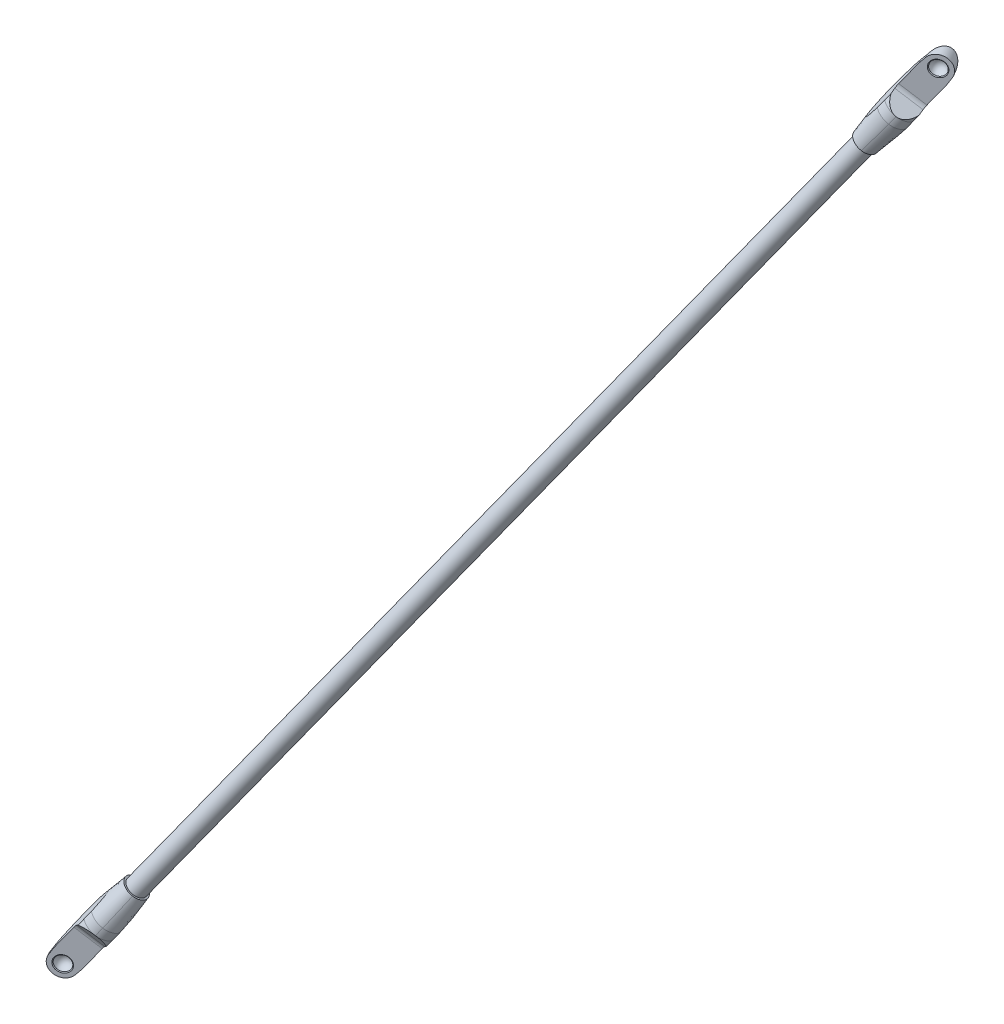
ISO-10303-21;
HEADER;
FILE_DESCRIPTION(('STEP AP214'),'2;1');
FILE_NAME('part.step','',(''),(''),'','','');
FILE_SCHEMA(('AUTOMOTIVE_DESIGN { 1 0 10303 214 1 1 1 1 }'));
ENDSEC;
DATA;
#1=APPLICATION_CONTEXT('core data for automotive mechanical design processes');
#2=APPLICATION_PROTOCOL_DEFINITION('international standard','automotive_design',2000,#1);
#3=PRODUCT_CONTEXT('',#1,'mechanical');
#4=PRODUCT('Part','Part','',(#3));
#5=PRODUCT_RELATED_PRODUCT_CATEGORY('part','',(#4));
#6=PRODUCT_DEFINITION_FORMATION('','',#4);
#7=PRODUCT_DEFINITION_CONTEXT('part definition',#1,'design');
#8=PRODUCT_DEFINITION('design','',#6,#7);
#9=PRODUCT_DEFINITION_SHAPE('','',#8);
#10=(LENGTH_UNIT() NAMED_UNIT(*) SI_UNIT(.MILLI.,.METRE.));
#11=(NAMED_UNIT(*) PLANE_ANGLE_UNIT() SI_UNIT($,.RADIAN.));
#12=(NAMED_UNIT(*) SI_UNIT($,.STERADIAN.) SOLID_ANGLE_UNIT());
#13=UNCERTAINTY_MEASURE_WITH_UNIT(LENGTH_MEASURE(1.E-05),#10,'distance_accuracy_value','');
#14=(GEOMETRIC_REPRESENTATION_CONTEXT(3) GLOBAL_UNCERTAINTY_ASSIGNED_CONTEXT((#13)) GLOBAL_UNIT_ASSIGNED_CONTEXT((#10,
#11,#12)) REPRESENTATION_CONTEXT('',''));
#15=CARTESIAN_POINT('',(0.,0.,0.));
#16=DIRECTION('',(0.,0.,1.));
#17=DIRECTION('',(1.,0.,0.));
#18=AXIS2_PLACEMENT_3D('',#15,#16,#17);
#19=CARTESIAN_POINT('',(101.177171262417,-747.901899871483,-120.19274804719));
#20=DIRECTION('',(0.505028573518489,0.812358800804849,-0.29158072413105));
#21=DIRECTION('',(0.857896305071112,-0.50951960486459,0.0663603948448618));
#22=AXIS2_PLACEMENT_3D('',#19,#20,#21);
#23=CYLINDRICAL_SURFACE('',#22,8.);
#24=DIRECTION('',(-0.505028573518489,-0.812358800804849,0.29158072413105));
#25=VECTOR('',#24,1.);
#26=CARTESIAN_POINT('',(442.382944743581,-207.915136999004,-321.682893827));
#27=LINE('',#26,#25);
#28=CARTESIAN_POINT('',(273.26596897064,-479.94660380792,-224.042378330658));
#29=VERTEX_POINT('',#28);
#30=CARTESIAN_POINT('',(73.5524195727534,-801.193891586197,-108.736780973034));
#31=VERTEX_POINT('',#30);
#32=EDGE_CURVE('E274',#29,#31,#27,.T.);
#33=ORIENTED_EDGE('',*,*,#32,.F.);
#34=ORIENTED_EDGE('',*,*,#32,.T.);
#35=CARTESIAN_POINT('',(70.5805976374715,-797.117720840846,-102.527666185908));
#36=DIRECTION('',(0.505028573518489,0.812358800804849,-0.29158072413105));
#37=DIRECTION('',(0.500000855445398,1.78684314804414E-06,0.866024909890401));
#38=AXIS2_PLACEMENT_3D('',#35,#36,#37);
#39=CIRCLE('',#38,8.);
#40=CARTESIAN_POINT('',(67.6087757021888,-793.041550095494,-96.3185513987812));
#41=VERTEX_POINT('',#40);
#42=EDGE_CURVE('E267',#31,#41,#39,.T.);
#43=ORIENTED_EDGE('',*,*,#42,.T.);
#44=DIRECTION('',(-0.505028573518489,-0.812358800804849,0.29158072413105));
#45=VECTOR('',#44,1.);
#46=CARTESIAN_POINT('',(436.439300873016,-199.762795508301,-309.264664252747));
#47=LINE('',#46,#45);
#48=CARTESIAN_POINT('',(267.322325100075,-471.794262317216,-211.624148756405));
#49=VERTEX_POINT('',#48);
#50=EDGE_CURVE('E262',#49,#41,#47,.T.);
#51=ORIENTED_EDGE('',*,*,#50,.F.);
#52=ORIENTED_EDGE('',*,*,#50,.T.);
#53=CARTESIAN_POINT('',(70.5805976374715,-797.117720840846,-102.527666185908));
#54=DIRECTION('',(0.505028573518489,0.812358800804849,-0.29158072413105));
#55=DIRECTION('',(0.500000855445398,1.78684314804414E-06,0.866024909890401));
#56=AXIS2_PLACEMENT_3D('',#53,#54,#55);
#57=CIRCLE('',#56,8.);
#58=EDGE_CURVE('E307',#41,#31,#57,.T.);
#59=ORIENTED_EDGE('',*,*,#58,.T.);
#60=EDGE_LOOP('',(#33,#34,#43,#51,#52,#59));
#61=FACE_BOUND('',#60,.T.);
#62=DIRECTION('',(0.505028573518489,0.812358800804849,-0.29158072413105));
#63=VECTOR('',#62,1.);
#64=CARTESIAN_POINT('',(108.040341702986,-751.9780567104,-119.661864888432));
#65=LINE('',#64,#63);
#66=CARTESIAN_POINT('',(277.157317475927,-479.946589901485,-217.302380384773));
#67=VERTEX_POINT('',#66);
#68=CARTESIAN_POINT('',(476.870866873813,-158.699302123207,-332.607977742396));
#69=VERTEX_POINT('',#68);
#70=EDGE_CURVE('E614',#67,#69,#65,.T.);
#71=ORIENTED_EDGE('',*,*,#70,.F.);
#72=ORIENTED_EDGE('',*,*,#70,.T.);
#73=CARTESIAN_POINT('',(470.007696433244,-154.623145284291,-333.138860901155));
#74=DIRECTION('',(-0.505028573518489,-0.812358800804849,0.29158072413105));
#75=DIRECTION('',(0.500000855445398,1.78684314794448E-06,0.866024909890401));
#76=AXIS2_PLACEMENT_3D('',#73,#74,#75);
#77=CIRCLE('',#76,8.);
#78=CARTESIAN_POINT('',(463.144525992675,-150.546988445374,-333.669744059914));
#79=VERTEX_POINT('',#78);
#80=EDGE_CURVE('E775',#69,#79,#77,.T.);
#81=ORIENTED_EDGE('',*,*,#80,.T.);
#82=DIRECTION('',(0.505028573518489,0.812358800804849,-0.29158072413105));
#83=VECTOR('',#82,1.);
#84=CARTESIAN_POINT('',(94.3140008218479,-743.825743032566,-120.723631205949));
#85=LINE('',#84,#83);
#86=CARTESIAN_POINT('',(263.430976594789,-471.794276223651,-218.364146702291));
#87=VERTEX_POINT('',#86);
#88=EDGE_CURVE('E282',#87,#79,#85,.T.);
#89=ORIENTED_EDGE('',*,*,#88,.F.);
#90=ORIENTED_EDGE('',*,*,#88,.T.);
#91=CARTESIAN_POINT('',(470.007696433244,-154.623145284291,-333.138860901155));
#92=DIRECTION('',(-0.505028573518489,-0.812358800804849,0.29158072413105));
#93=DIRECTION('',(0.500000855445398,1.78684314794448E-06,0.866024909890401));
#94=AXIS2_PLACEMENT_3D('',#91,#92,#93);
#95=CIRCLE('',#94,8.);
#96=EDGE_CURVE('E284',#79,#69,#95,.T.);
#97=ORIENTED_EDGE('',*,*,#96,.T.);
#98=EDGE_LOOP('',(#71,#72,#81,#89,#90,#97));
#99=FACE_BOUND('',#98,.T.);
#100=ADVANCED_FACE('F16',(#61,#99),#23,.T.);
#101=CARTESIAN_POINT('',(489.703810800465,-122.941152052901,-344.510509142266));
#102=DIRECTION('',(-0.505028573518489,-0.812358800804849,0.29158072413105));
#103=DIRECTION('',(0.500000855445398,1.78684314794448E-06,0.866024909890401));
#104=AXIS2_PLACEMENT_3D('',#101,#102,#103);
#105=DEGENERATE_TOROIDAL_SURFACE('',#104,422.5,435.,.F.);
#106=CARTESIAN_POINT('',(494.016450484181,-130.093456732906,-353.853758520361));
#107=CARTESIAN_POINT('',(494.53908181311,-129.249150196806,-354.160718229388));
#108=CARTESIAN_POINT('',(495.065606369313,-128.404812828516,-354.460978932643));
#109=CARTESIAN_POINT('',(496.126479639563,-126.716243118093,-355.047797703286));
#110=CARTESIAN_POINT('',(496.660828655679,-125.87201078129,-355.334355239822));
#111=CARTESIAN_POINT('',(497.738099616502,-124.182704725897,-355.893829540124));
#112=CARTESIAN_POINT('',(498.281032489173,-123.337631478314,-356.166726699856));
#113=CARTESIAN_POINT('',(499.374934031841,-121.648066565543,-356.697767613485));
#114=CARTESIAN_POINT('',(499.925902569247,-120.803574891,-356.955911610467));
#115=CARTESIAN_POINT('',(501.038831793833,-119.111515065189,-357.457577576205));
#116=CARTESIAN_POINT('',(501.600831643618,-118.263950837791,-357.701026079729));
#117=CARTESIAN_POINT('',(502.733930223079,-116.570062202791,-358.170383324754));
#118=CARTESIAN_POINT('',(503.305028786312,-115.723737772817,-358.396292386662));
#119=CARTESIAN_POINT('',(504.456993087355,-114.033269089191,-358.828063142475));
#120=CARTESIAN_POINT('',(505.037853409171,-113.189123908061,-359.033935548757));
#121=CARTESIAN_POINT('',(505.917811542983,-111.924895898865,-359.324874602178));
#122=CARTESIAN_POINT('',(506.212564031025,-111.503834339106,-359.418872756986));
#123=CARTESIAN_POINT('',(506.805255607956,-110.662519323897,-359.600189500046));
#124=CARTESIAN_POINT('',(507.103194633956,-110.24226585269,-359.687508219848));
#125=CARTESIAN_POINT('',(507.623207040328,-109.513998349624,-359.832404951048));
#126=CARTESIAN_POINT('',(507.844464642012,-109.205749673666,-359.891732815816));
#127=CARTESIAN_POINT('',(508.289093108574,-108.589908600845,-360.005786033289));
#128=CARTESIAN_POINT('',(508.512464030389,-108.282316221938,-360.060511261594));
#129=CARTESIAN_POINT('',(508.961470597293,-107.668053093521,-360.164715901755));
#130=CARTESIAN_POINT('',(509.187105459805,-107.361382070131,-360.214197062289));
#131=CARTESIAN_POINT('',(509.641002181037,-106.74908537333,-360.307108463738));
#132=CARTESIAN_POINT('',(509.869263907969,-106.443459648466,-360.350539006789));
#133=CARTESIAN_POINT('',(510.329121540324,-105.833143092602,-360.430282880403));
#134=CARTESIAN_POINT('',(510.560721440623,-105.528454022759,-360.466586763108));
#135=CARTESIAN_POINT('',(511.027546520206,-104.920811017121,-360.530424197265));
#136=CARTESIAN_POINT('',(511.262772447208,-104.617857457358,-360.557955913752));
#137=CARTESIAN_POINT('',(511.73788200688,-104.01409627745,-360.601870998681));
#138=CARTESIAN_POINT('',(511.977771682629,-103.71329224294,-360.618238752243));
#139=CARTESIAN_POINT('',(512.462887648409,-103.115676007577,-360.635999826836));
#140=CARTESIAN_POINT('',(512.708110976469,-102.818861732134,-360.637401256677));
#141=CARTESIAN_POINT('',(513.081857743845,-102.378007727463,-360.622993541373));
#142=CARTESIAN_POINT('',(513.20772067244,-102.23145337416,-360.615402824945));
#143=CARTESIAN_POINT('',(513.461667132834,-101.940612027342,-360.593119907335));
#144=CARTESIAN_POINT('',(513.589752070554,-101.796326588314,-360.578423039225));
#145=CARTESIAN_POINT('',(513.848193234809,-101.511505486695,-360.539711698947));
#146=CARTESIAN_POINT('',(513.978545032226,-101.370963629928,-360.51571379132));
#147=CARTESIAN_POINT('',(514.242039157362,-101.09550892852,-360.454802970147));
#148=CARTESIAN_POINT('',(514.375177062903,-100.960588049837,-360.417909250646));
#149=CARTESIAN_POINT('',(514.609494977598,-100.734447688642,-360.336731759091));
#150=CARTESIAN_POINT('',(514.709997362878,-100.640976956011,-360.296853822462));
#151=CARTESIAN_POINT('',(514.912035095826,-100.463495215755,-360.201727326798));
#152=CARTESIAN_POINT('',(515.013564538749,-100.379447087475,-360.146542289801));
#153=CARTESIAN_POINT('',(515.162468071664,-100.2684584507,-360.047981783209));
#154=CARTESIAN_POINT('',(515.210462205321,-100.234600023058,-360.013464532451));
#155=CARTESIAN_POINT('',(515.305295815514,-100.17272187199,-359.938047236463));
#156=CARTESIAN_POINT('',(515.352135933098,-100.144698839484,-359.897150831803));
#157=CARTESIAN_POINT('',(515.436404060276,-100.100375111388,-359.814830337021));
#158=CARTESIAN_POINT('',(515.474192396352,-100.082948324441,-359.774398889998));
#159=CARTESIAN_POINT('',(515.546494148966,-100.055624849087,-359.688397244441));
#160=CARTESIAN_POINT('',(515.581012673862,-100.045716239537,-359.64283531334));
#161=CARTESIAN_POINT('',(515.645504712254,-100.034596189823,-359.547096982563));
#162=CARTESIAN_POINT('',(515.675445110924,-100.033445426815,-359.496890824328));
#163=CARTESIAN_POINT('',(515.729322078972,-100.040168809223,-359.39392024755));
#164=CARTESIAN_POINT('',(515.753254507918,-100.048049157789,-359.34115409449));
#165=CARTESIAN_POINT('',(515.797463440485,-100.073287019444,-359.22834752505));
#166=CARTESIAN_POINT('',(515.816902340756,-100.091711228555,-359.168226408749));
#167=CARTESIAN_POINT('',(515.848680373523,-100.136385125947,-359.049046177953));
#168=CARTESIAN_POINT('',(515.861005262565,-100.162650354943,-358.989989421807));
#169=CARTESIAN_POINT('',(515.886120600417,-100.240214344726,-358.835128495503));
#170=CARTESIAN_POINT('',(515.893749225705,-100.296532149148,-358.741058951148));
#171=CARTESIAN_POINT('',(515.898054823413,-100.418252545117,-358.558845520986));
#172=CARTESIAN_POINT('',(515.894699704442,-100.483681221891,-358.47071976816));
#173=CARTESIAN_POINT('',(515.876940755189,-100.653495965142,-358.257673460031));
#174=CARTESIAN_POINT('',(515.85792831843,-100.76126074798,-358.135884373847));
#175=CARTESIAN_POINT('',(515.809430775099,-100.98355790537,-357.900729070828));
#176=CARTESIAN_POINT('',(515.77992109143,-101.098105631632,-357.787383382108));
#177=CARTESIAN_POINT('',(515.713495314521,-101.332030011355,-357.566587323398));
#178=CARTESIAN_POINT('',(515.676534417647,-101.451432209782,-357.459177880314));
#179=CARTESIAN_POINT('',(515.597341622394,-101.692847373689,-357.249740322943));
#180=CARTESIAN_POINT('',(515.555116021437,-101.814857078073,-357.147705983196));
#181=CARTESIAN_POINT('',(515.4151247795,-102.204101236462,-356.831334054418));
#182=CARTESIAN_POINT('',(515.309973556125,-102.474898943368,-356.62467285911));
#183=CARTESIAN_POINT('',(515.087909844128,-103.021472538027,-356.224574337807));
#184=CARTESIAN_POINT('',(514.970988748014,-103.297251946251,-356.03114686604));
#185=CARTESIAN_POINT('',(514.72850392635,-103.852620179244,-355.653792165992));
#186=CARTESIAN_POINT('',(514.602919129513,-104.132216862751,-355.469890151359));
#187=CARTESIAN_POINT('',(514.345492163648,-104.693440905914,-355.110008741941));
#188=CARTESIAN_POINT('',(514.213651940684,-104.975067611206,-354.934026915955));
#189=CARTESIAN_POINT('',(513.944615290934,-105.540634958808,-354.588018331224));
#190=CARTESIAN_POINT('',(513.807405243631,-105.824579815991,-354.418009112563));
#191=CARTESIAN_POINT('',(513.528860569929,-106.393664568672,-354.083418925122));
#192=CARTESIAN_POINT('',(513.387525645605,-106.678804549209,-353.91883835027));
#193=CARTESIAN_POINT('',(513.101602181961,-107.249568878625,-353.594617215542));
#194=CARTESIAN_POINT('',(512.957018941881,-107.535191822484,-353.434969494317));
#195=CARTESIAN_POINT('',(512.66486755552,-108.107169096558,-353.119794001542));
#196=CARTESIAN_POINT('',(512.517299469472,-108.393523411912,-352.964266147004));
#197=CARTESIAN_POINT('',(512.134472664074,-109.130637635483,-352.569055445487));
#198=CARTESIAN_POINT('',(511.897288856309,-109.581843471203,-352.332066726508));
#199=CARTESIAN_POINT('',(511.417482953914,-110.485392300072,-351.865876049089));
#200=CARTESIAN_POINT('',(511.174860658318,-110.937735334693,-351.63667437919));
#201=CARTESIAN_POINT('',(510.439916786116,-112.296195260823,-350.959272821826));
#202=CARTESIAN_POINT('',(509.940572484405,-113.203639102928,-350.52133153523));
#203=CARTESIAN_POINT('',(508.926298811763,-115.02206239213,-349.667366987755));
#204=CARTESIAN_POINT('',(508.411347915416,-115.933045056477,-349.251376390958));
#205=CARTESIAN_POINT('',(507.368804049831,-117.756482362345,-348.439178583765));
#206=CARTESIAN_POINT('',(506.841211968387,-118.668936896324,-348.042969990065));
#207=CARTESIAN_POINT('',(505.796408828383,-120.457893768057,-347.284189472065));
#208=CARTESIAN_POINT('',(505.279643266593,-121.334354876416,-346.920905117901));
#209=CARTESIAN_POINT('',(504.236601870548,-123.087939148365,-346.209858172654));
#210=CARTESIAN_POINT('',(503.710325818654,-123.965062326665,-345.862095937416));
#211=CARTESIAN_POINT('',(502.650260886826,-125.71734402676,-345.182404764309));
#212=CARTESIAN_POINT('',(502.116495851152,-126.592501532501,-344.850435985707));
#213=CARTESIAN_POINT('',(501.040411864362,-128.342929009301,-344.201152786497));
#214=CARTESIAN_POINT('',(500.498093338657,-129.218198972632,-343.883837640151));
#215=CARTESIAN_POINT('',(499.951636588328,-130.093435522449,-343.5737380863));
#216=B_SPLINE_CURVE_WITH_KNOTS('',3,(#106,#107,#108,#109,#110,#111,#112,#113,#114,#115,#116,
#117,#118,#119,#120,#121,#122,#123,#124,#125,#126,#127,#128,#129,#130,#131,#132,#133,#134,#135,
#136,#137,#138,#139,#140,#141,#142,#143,#144,#145,#146,#147,#148,#149,#150,#151,#152,#153,#154,
#155,#156,#157,#158,#159,#160,#161,#162,#163,#164,#165,#166,#167,#168,#169,#170,#171,#172,#173,
#174,#175,#176,#177,#178,#179,#180,#181,#182,#183,#184,#185,#186,#187,#188,#189,#190,#191,#192,
#193,#194,#195,#196,#197,#198,#199,#200,#201,#202,#203,#204,#205,#206,#207,#208,#209,#210,#211,
#212,#213,#214,#215),.UNSPECIFIED.,.F.,.F.,(4,2,2,2,2,2,2,2,2,2,2,2,2,2,2,2,2,2,2,2,2,2,2,2,2,2,
2,2,2,2,2,2,2,2,2,2,2,2,2,2,2,2,2,2,2,2,2,2,2,2,2,2,2,2,4),(0.,3.11798800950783,
6.23609671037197,9.35855895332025,12.4809697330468,15.6178797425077,18.7547324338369,
21.8898987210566,23.4573613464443,25.0247930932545,26.176904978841,27.3290479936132,
28.480805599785,29.6325056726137,30.7857224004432,31.9391802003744,33.0942480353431,
34.2486900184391,34.8285759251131,35.4088431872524,35.9880817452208,36.5664618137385,
36.9946719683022,37.421131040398,37.6251109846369,37.82897494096,38.0023658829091,
38.1754813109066,38.3497950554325,38.5242286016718,38.720586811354,38.917336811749,
39.2451852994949,39.5739925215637,40.0639280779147,40.555018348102,41.0491546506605,
41.5427054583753,42.6113457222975,43.680773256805,44.7529003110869,45.824695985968,
46.8994131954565,47.974208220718,49.0473616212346,50.1204933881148,51.8068214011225,
53.493211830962,56.8663810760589,60.2444359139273,63.6222542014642,66.863213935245,
70.1042479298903,73.3366179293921,76.5688276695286),.UNSPECIFIED.);
#217=CARTESIAN_POINT('',(494.473978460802,-129.355899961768,-354.120218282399));
#218=VERTEX_POINT('',#217);
#219=CARTESIAN_POINT('',(515.792488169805,-101.045710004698,-357.840841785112));
#220=VERTEX_POINT('',#219);
#221=EDGE_CURVE('E572',#218,#220,#216,.T.);
#222=ORIENTED_EDGE('',*,*,#221,.F.);
#223=CARTESIAN_POINT('',(489.703810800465,-122.941152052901,-344.510509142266));
#224=DIRECTION('',(-0.505028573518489,-0.812358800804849,0.29158072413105));
#225=DIRECTION('',(-0.500000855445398,-1.78684314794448E-06,-0.866024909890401));
#226=AXIS2_PLACEMENT_3D('',#223,#224,#225);
#227=CIRCLE('',#226,12.5);
#228=CARTESIAN_POINT('',(483.453800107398,-122.94117438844,-355.335820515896));
#229=VERTEX_POINT('',#228);
#230=EDGE_CURVE('E575',#229,#218,#227,.T.);
#231=ORIENTED_EDGE('',*,*,#230,.F.);
#232=CARTESIAN_POINT('',(700.954172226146,-122.940397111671,21.3850152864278));
#233=DIRECTION('',(-0.703523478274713,0.583157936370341,0.406179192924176));
#234=DIRECTION('',(0.500000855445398,1.78684314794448E-06,0.866024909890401));
#235=AXIS2_PLACEMENT_3D('',#232,#233,#234);
#236=CIRCLE('',#235,435.);
#237=CARTESIAN_POINT('',(510.710259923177,-81.5108701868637,-367.608362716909));
#238=VERTEX_POINT('',#237);
#239=EDGE_CURVE('E507',#238,#229,#236,.T.);
#240=ORIENTED_EDGE('',*,*,#239,.F.);
#241=CARTESIAN_POINT('',(517.260173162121,-95.2484481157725,-362.151860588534));
#242=CARTESIAN_POINT('',(517.271991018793,-95.2249428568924,-362.158681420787));
#243=CARTESIAN_POINT('',(517.28334651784,-95.2013875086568,-362.166114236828));
#244=CARTESIAN_POINT('',(517.305315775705,-95.1538634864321,-362.182249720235));
#245=CARTESIAN_POINT('',(517.31591477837,-95.1298942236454,-362.190970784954));
#246=CARTESIAN_POINT('',(517.336364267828,-95.0815409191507,-362.209677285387));
#247=CARTESIAN_POINT('',(517.346197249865,-95.0571574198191,-362.219683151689));
#248=CARTESIAN_POINT('',(517.365111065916,-95.0079705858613,-362.240953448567));
#249=CARTESIAN_POINT('',(517.374172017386,-94.983169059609,-362.252239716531));
#250=CARTESIAN_POINT('',(517.388219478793,-94.9426992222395,-362.271513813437));
#251=CARTESIAN_POINT('',(517.393489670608,-94.9269885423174,-362.27920908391));
#252=CARTESIAN_POINT('',(517.403729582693,-94.8954015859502,-362.295091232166));
#253=CARTESIAN_POINT('',(517.408693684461,-94.8795263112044,-362.303283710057));
#254=CARTESIAN_POINT('',(517.423248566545,-94.8312708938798,-362.328795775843));
#255=CARTESIAN_POINT('',(517.432242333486,-94.7990111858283,-362.34669154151));
#256=CARTESIAN_POINT('',(517.444698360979,-94.7506206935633,-362.374700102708));
#257=CARTESIAN_POINT('',(517.448709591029,-94.7343420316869,-362.384323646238));
#258=CARTESIAN_POINT('',(517.456471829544,-94.7014422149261,-362.404155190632));
#259=CARTESIAN_POINT('',(517.460212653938,-94.6848239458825,-362.414371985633));
#260=CARTESIAN_POINT('',(517.469924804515,-94.6396417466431,-362.442644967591));
#261=CARTESIAN_POINT('',(517.475538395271,-94.6111848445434,-362.460995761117));
#262=CARTESIAN_POINT('',(517.486029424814,-94.5533006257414,-362.499286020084));
#263=CARTESIAN_POINT('',(517.490861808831,-94.5238879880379,-362.519259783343));
#264=CARTESIAN_POINT('',(517.499770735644,-94.4640801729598,-362.560785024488));
#265=CARTESIAN_POINT('',(517.503803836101,-94.4336998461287,-362.58236711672));
#266=CARTESIAN_POINT('',(517.511080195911,-94.3719556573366,-362.627110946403));
#267=CARTESIAN_POINT('',(517.514281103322,-94.3406070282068,-362.650300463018));
#268=CARTESIAN_POINT('',(517.519853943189,-94.2775263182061,-362.69772442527));
#269=CARTESIAN_POINT('',(517.522205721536,-94.2458013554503,-362.721970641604));
#270=CARTESIAN_POINT('',(517.526175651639,-94.1813541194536,-362.771865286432));
#271=CARTESIAN_POINT('',(517.527760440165,-94.1486431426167,-362.797530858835));
#272=CARTESIAN_POINT('',(517.53187383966,-94.0350780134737,-362.887680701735));
#273=CARTESIAN_POINT('',(517.532304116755,-93.9549326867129,-362.953161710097));
#274=CARTESIAN_POINT('',(517.528730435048,-93.7815868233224,-363.097722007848));
#275=CARTESIAN_POINT('',(517.523905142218,-93.6886651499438,-363.177107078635));
#276=CARTESIAN_POINT('',(517.513590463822,-93.5482136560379,-363.297857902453));
#277=CARTESIAN_POINT('',(517.509546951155,-93.500432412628,-363.339071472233));
#278=CARTESIAN_POINT('',(517.501657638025,-93.4177091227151,-363.410617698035));
#279=CARTESIAN_POINT('',(517.498044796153,-93.3827291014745,-363.440931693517));
#280=CARTESIAN_POINT('',(517.485492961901,-93.2693907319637,-363.53928303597));
#281=CARTESIAN_POINT('',(517.475517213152,-93.1911784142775,-363.60735710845));
#282=CARTESIAN_POINT('',(517.451774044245,-93.0234997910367,-363.753064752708));
#283=CARTESIAN_POINT('',(517.437666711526,-92.9340443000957,-363.830654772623));
#284=CARTESIAN_POINT('',(517.409439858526,-92.7699728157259,-363.9723074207));
#285=CARTESIAN_POINT('',(517.395715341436,-92.6953719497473,-364.036466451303));
#286=CARTESIAN_POINT('',(517.379102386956,-92.6104912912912,-364.109188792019));
#287=CARTESIAN_POINT('',(517.377077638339,-92.6002308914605,-364.11797487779));
#288=CARTESIAN_POINT('',(517.363236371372,-92.5306618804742,-364.177517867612));
#289=CARTESIAN_POINT('',(517.350879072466,-92.4713448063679,-364.228140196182));
#290=CARTESIAN_POINT('',(517.318910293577,-92.3232229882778,-364.353728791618));
#291=CARTESIAN_POINT('',(517.298724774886,-92.2342909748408,-364.428398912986));
#292=CARTESIAN_POINT('',(517.24926939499,-92.0265870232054,-364.601116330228));
#293=CARTESIAN_POINT('',(517.219200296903,-91.9076552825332,-364.698744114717));
#294=CARTESIAN_POINT('',(517.161589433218,-91.691697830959,-364.873478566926));
#295=CARTESIAN_POINT('',(517.134655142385,-91.5948091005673,-364.950955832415));
#296=CARTESIAN_POINT('',(517.081338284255,-91.4099907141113,-365.096769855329));
#297=CARTESIAN_POINT('',(517.055162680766,-91.3221185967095,-365.165255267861));
#298=CARTESIAN_POINT('',(516.998412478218,-91.1374046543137,-365.307425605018));
#299=CARTESIAN_POINT('',(516.967657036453,-91.0405143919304,-365.380975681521));
#300=CARTESIAN_POINT('',(516.912930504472,-90.8731782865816,-365.50604886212));
#301=CARTESIAN_POINT('',(516.8894572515,-90.8028875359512,-365.557998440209));
#302=CARTESIAN_POINT('',(516.834805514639,-90.6425582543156,-365.675142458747));
#303=CARTESIAN_POINT('',(516.803286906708,-90.5524180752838,-365.740039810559));
#304=CARTESIAN_POINT('',(516.74017206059,-90.3762738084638,-365.864899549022));
#305=CARTESIAN_POINT('',(516.708663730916,-90.2902962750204,-365.924943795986));
#306=CARTESIAN_POINT('',(516.660893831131,-90.1627227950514,-366.012632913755));
#307=CARTESIAN_POINT('',(516.645230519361,-90.121314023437,-366.040877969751));
#308=CARTESIAN_POINT('',(516.610899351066,-90.0314490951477,-366.101690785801));
#309=CARTESIAN_POINT('',(516.592167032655,-89.9829722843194,-366.134191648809));
#310=CARTESIAN_POINT('',(516.535924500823,-89.8390735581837,-366.229762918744));
#311=CARTESIAN_POINT('',(516.49771734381,-89.7434380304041,-366.292104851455));
#312=CARTESIAN_POINT('',(516.420371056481,-89.5539754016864,-366.413236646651));
#313=CARTESIAN_POINT('',(516.381277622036,-89.4601613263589,-366.472076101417));
#314=CARTESIAN_POINT('',(516.302283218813,-89.2744034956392,-366.586275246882));
#315=CARTESIAN_POINT('',(516.262426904,-89.1824716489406,-366.641685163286));
#316=CARTESIAN_POINT('',(516.182031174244,-89.0005336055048,-366.749095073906));
#317=CARTESIAN_POINT('',(516.141535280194,-88.910538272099,-366.801146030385));
#318=CARTESIAN_POINT('',(516.05998283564,-88.7325217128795,-366.901908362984));
#319=CARTESIAN_POINT('',(516.018968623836,-88.6445103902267,-366.950671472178));
#320=CARTESIAN_POINT('',(515.936502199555,-88.4705016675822,-367.044923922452));
#321=CARTESIAN_POINT('',(515.895091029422,-88.384513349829,-367.090465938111));
#322=CARTESIAN_POINT('',(515.805393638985,-88.2012007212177,-367.185278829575));
#323=CARTESIAN_POINT('',(515.756906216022,-88.1038351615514,-367.234280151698));
#324=CARTESIAN_POINT('',(515.658949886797,-87.9105933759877,-367.328789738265));
#325=CARTESIAN_POINT('',(515.609515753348,-87.8147229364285,-367.374345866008));
#326=CARTESIAN_POINT('',(515.50975163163,-87.6245290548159,-367.462010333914));
#327=CARTESIAN_POINT('',(515.459455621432,-87.5302101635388,-367.504167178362));
#328=CARTESIAN_POINT('',(515.358052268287,-87.3431751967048,-367.585081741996));
#329=CARTESIAN_POINT('',(515.306978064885,-87.2504624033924,-367.623888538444));
#330=CARTESIAN_POINT('',(515.204103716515,-87.0666905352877,-367.698150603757));
#331=CARTESIAN_POINT('',(515.1523357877,-86.9756334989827,-367.733655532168));
#332=CARTESIAN_POINT('',(515.048157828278,-86.7952175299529,-367.801362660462));
#333=CARTESIAN_POINT('',(514.995779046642,-86.7058594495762,-367.833615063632));
#334=CARTESIAN_POINT('',(514.916411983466,-86.5724863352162,-367.879773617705));
#335=CARTESIAN_POINT('',(514.890020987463,-86.5284621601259,-367.894687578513));
#336=CARTESIAN_POINT('',(514.833742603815,-86.4352712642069,-367.925564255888));
#337=CARTESIAN_POINT('',(514.803807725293,-86.3861061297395,-367.941445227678));
#338=CARTESIAN_POINT('',(514.714021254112,-86.2398528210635,-367.987454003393));
#339=CARTESIAN_POINT('',(514.653474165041,-86.1428050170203,-368.016365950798));
#340=CARTESIAN_POINT('',(514.531515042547,-85.9504986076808,-368.070348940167));
#341=CARTESIAN_POINT('',(514.470132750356,-85.8552364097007,-368.0954744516));
#342=CARTESIAN_POINT('',(514.34658115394,-85.6665616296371,-368.14193053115));
#343=CARTESIAN_POINT('',(514.28444024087,-85.5731438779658,-368.163315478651));
#344=CARTESIAN_POINT('',(514.15945190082,-85.3882170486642,-368.202335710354));
#345=CARTESIAN_POINT('',(514.096631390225,-85.2967012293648,-368.220025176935));
#346=CARTESIAN_POINT('',(513.970364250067,-85.1156323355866,-368.251700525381));
#347=CARTESIAN_POINT('',(513.906942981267,-85.0260710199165,-368.265740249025));
#348=CARTESIAN_POINT('',(513.779555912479,-84.8489618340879,-368.290162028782));
#349=CARTESIAN_POINT('',(513.715613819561,-84.7614042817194,-368.300597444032));
#350=CARTESIAN_POINT('',(513.581037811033,-84.5799517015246,-368.318695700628));
#351=CARTESIAN_POINT('',(513.510281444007,-84.4861179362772,-368.326065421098));
#352=CARTESIAN_POINT('',(513.368045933,-84.3006666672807,-368.336552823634));
#353=CARTESIAN_POINT('',(513.2965876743,-84.20903617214,-368.339723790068));
#354=CARTESIAN_POINT('',(513.153029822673,-84.0280618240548,-368.341861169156));
#355=CARTESIAN_POINT('',(513.080949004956,-83.9387037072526,-368.340878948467));
#356=CARTESIAN_POINT('',(512.936228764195,-83.7623410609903,-368.334758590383));
#357=CARTESIAN_POINT('',(512.863605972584,-83.6753212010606,-368.329669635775));
#358=CARTESIAN_POINT('',(512.717886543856,-83.5036988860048,-368.31538547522));
#359=CARTESIAN_POINT('',(512.644804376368,-83.4190802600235,-368.306237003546));
#360=CARTESIAN_POINT('',(512.498247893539,-83.2523160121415,-368.283883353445));
#361=CARTESIAN_POINT('',(512.424785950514,-83.1701536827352,-368.270722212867));
#362=CARTESIAN_POINT('',(512.314097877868,-83.0485142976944,-368.247921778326));
#363=CARTESIAN_POINT('',(512.277259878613,-83.0083842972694,-368.239848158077));
#364=CARTESIAN_POINT('',(512.201649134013,-82.9267409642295,-368.222276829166));
#365=CARTESIAN_POINT('',(512.16286507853,-82.8852484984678,-368.212730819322));
#366=CARTESIAN_POINT('',(512.046536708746,-82.7619585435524,-368.182498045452));
#367=CARTESIAN_POINT('',(511.968621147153,-82.6809139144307,-368.160135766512));
#368=CARTESIAN_POINT('',(511.812416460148,-82.5215278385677,-368.111058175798));
#369=CARTESIAN_POINT('',(511.734132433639,-82.4431730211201,-368.084369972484));
#370=CARTESIAN_POINT('',(511.577270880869,-82.2892343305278,-368.026691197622));
#371=CARTESIAN_POINT('',(511.498696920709,-82.2136383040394,-367.995723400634));
#372=CARTESIAN_POINT('',(511.341341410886,-82.0652856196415,-367.929538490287));
#373=CARTESIAN_POINT('',(511.262562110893,-81.9925183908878,-367.894339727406));
#374=CARTESIAN_POINT('',(511.104881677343,-81.8498875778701,-367.819745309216));
#375=CARTESIAN_POINT('',(511.025981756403,-81.7800153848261,-367.780363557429));
#376=CARTESIAN_POINT('',(510.868148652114,-81.6432320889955,-367.697461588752));
#377=CARTESIAN_POINT('',(510.789215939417,-81.5763147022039,-367.653950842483));
#378=CARTESIAN_POINT('',(510.710259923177,-81.5108701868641,-367.608362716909));
#379=B_SPLINE_CURVE_WITH_KNOTS('',3,(#241,#242,#243,#244,#245,#246,#247,#248,#249,#250,#251,
#252,#253,#254,#255,#256,#257,#258,#259,#260,#261,#262,#263,#264,#265,#266,#267,#268,#269,#270,
#271,#272,#273,#274,#275,#276,#277,#278,#279,#280,#281,#282,#283,#284,#285,#286,#287,#288,#289,
#290,#291,#292,#293,#294,#295,#296,#297,#298,#299,#300,#301,#302,#303,#304,#305,#306,#307,#308,
#309,#310,#311,#312,#313,#314,#315,#316,#317,#318,#319,#320,#321,#322,#323,#324,#325,#326,#327,
#328,#329,#330,#331,#332,#333,#334,#335,#336,#337,#338,#339,#340,#341,#342,#343,#344,#345,#346,
#347,#348,#349,#350,#351,#352,#353,#354,#355,#356,#357,#358,#359,#360,#361,#362,#363,#364,#365,
#366,#367,#368,#369,#370,#371,#372,#373,#374,#375,#376,#377,#378),.UNSPECIFIED.,.F.,.F.,(4,2,2,
2,2,2,2,2,2,2,2,2,2,2,2,2,2,2,2,2,2,2,2,2,2,2,2,2,2,2,2,2,2,2,2,2,2,2,2,2,2,2,2,2,2,2,2,2,2,2,2,
2,2,2,2,2,2,2,2,2,2,2,2,2,2,2,2,2,4),(0.,0.0815194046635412,0.164341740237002,0.248698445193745,
0.334808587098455,0.389613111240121,0.445230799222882,0.559074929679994,0.61706393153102,
0.676646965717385,0.779587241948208,0.887206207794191,0.99963580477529,1.11699174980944,
1.23697393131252,1.36178861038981,1.67212198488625,2.03893945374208,2.22862346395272,
2.36790523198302,2.68037635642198,3.03810731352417,3.33613291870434,3.37711019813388,
3.61396578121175,3.96753556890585,4.43781617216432,4.8186286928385,5.16193235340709,
5.53831542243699,5.80980971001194,6.15615469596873,6.48463008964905,6.6421723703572,
6.82605691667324,7.18717517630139,7.53945522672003,7.88292416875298,8.21761124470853,
8.54354806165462,8.86076884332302,9.21862136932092,9.56985097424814,9.9145203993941,
10.2526960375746,10.584448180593,10.9098512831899,11.0702004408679,11.2493296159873,
11.603213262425,11.9513841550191,12.293973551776,12.6311192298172,12.9629657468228,
13.2896646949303,13.6428317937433,13.9914726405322,14.3358141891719,14.6760919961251,
15.0125501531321,15.3454411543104,15.510639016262,15.6834061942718,16.0271636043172,
16.3688446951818,16.7087728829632,17.047276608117,17.3846884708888,17.7213443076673),.UNSPECIFIED.);
#380=CARTESIAN_POINT('',(517.260173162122,-95.2484481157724,-362.151860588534));
#381=VERTEX_POINT('',#380);
#382=EDGE_CURVE('E504',#381,#238,#379,.T.);
#383=ORIENTED_EDGE('',*,*,#382,.F.);
#384=CARTESIAN_POINT('',(510.691303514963,-89.1819247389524,-356.627741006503));
#385=DIRECTION('',(0.50502857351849,0.812358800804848,-0.291580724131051));
#386=DIRECTION('',(0.703523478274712,-0.583157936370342,-0.406179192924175));
#387=AXIS2_PLACEMENT_3D('',#384,#385,#386);
#388=CIRCLE('',#387,10.5104068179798);
#389=CARTESIAN_POINT('',(518.759771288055,-95.2484427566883,-359.554486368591));
#390=VERTEX_POINT('',#389);
#391=EDGE_CURVE('E499',#390,#381,#388,.T.);
#392=ORIENTED_EDGE('',*,*,#391,.F.);
#393=CARTESIAN_POINT('',(518.775263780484,-95.2179088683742,-359.562964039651));
#394=CARTESIAN_POINT('',(518.7700359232,-95.228118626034,-359.560257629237));
#395=CARTESIAN_POINT('',(518.764871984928,-95.238296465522,-359.557431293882));
#396=CARTESIAN_POINT('',(518.759771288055,-95.2484427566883,-359.554486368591));
#397=(BOUNDED_CURVE() B_SPLINE_CURVE(3,(#393,#394,#395,#396),.UNSPECIFIED.,.F.,
.F.) B_SPLINE_CURVE_WITH_KNOTS((4,4),(7.68404953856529E-06,4.22971954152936E-05),
.UNSPECIFIED.) CURVE() GEOMETRIC_REPRESENTATION_ITEM() RATIONAL_B_SPLINE_CURVE((1.,1.,1.,1.)) REPRESENTATION_ITEM(''));
#398=CARTESIAN_POINT('',(518.775263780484,-95.2179088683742,-359.562964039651));
#399=VERTEX_POINT('',#398);
#400=EDGE_CURVE('E503',#399,#390,#397,.T.);
#401=ORIENTED_EDGE('',*,*,#400,.F.);
#402=CARTESIAN_POINT('',(505.646358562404,-119.444156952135,-351.982919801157));
#403=CARTESIAN_POINT('',(507.94903565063,-115.492965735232,-353.312382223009));
#404=CARTESIAN_POINT('',(510.194912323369,-111.498098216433,-354.609050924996));
#405=CARTESIAN_POINT('',(514.572615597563,-103.420665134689,-357.136541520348));
#406=CARTESIAN_POINT('',(516.704170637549,-99.338507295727,-358.367206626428));
#407=CARTESIAN_POINT('',(518.775263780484,-95.2179088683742,-359.562964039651));
#408=(BOUNDED_CURVE() B_SPLINE_CURVE(3,(#402,#403,#404,#405,#406,#407),.UNSPECIFIED.,.F.,
.F.) B_SPLINE_CURVE_WITH_KNOTS((4,2,4),(0.313716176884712,0.328296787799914,0.342877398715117),
.UNSPECIFIED.) CURVE() GEOMETRIC_REPRESENTATION_ITEM() RATIONAL_B_SPLINE_CURVE((1.,1.,1.,1.,1.,1.)) REPRESENTATION_ITEM(''));
#409=EDGE_CURVE('E577',#220,#399,#408,.T.);
#410=ORIENTED_EDGE('',*,*,#409,.F.);
#411=EDGE_LOOP('',(#222,#231,#240,#383,#392,#401,#410));
#412=FACE_BOUND('',#411,.T.);
#413=ADVANCED_FACE('F469',(#412),#105,.F.);
#414=CARTESIAN_POINT('',(470.007696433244,-154.623145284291,-333.138860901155));
#415=DIRECTION('',(-0.505028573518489,-0.812358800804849,0.29158072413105));
#416=DIRECTION('',(-0.500000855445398,-1.78684314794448E-06,-0.866024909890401));
#417=AXIS2_PLACEMENT_3D('',#414,#415,#416);
#418=CYLINDRICAL_SURFACE('',#417,12.5);
#419=DIRECTION('',(-0.505028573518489,-0.812358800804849,0.29158072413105));
#420=VECTOR('',#419,1.);
#421=CARTESIAN_POINT('',(474.777864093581,-161.037893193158,-342.748570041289));
#422=LINE('',#421,#420);
#423=CARTESIAN_POINT('',(490.433749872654,-135.854770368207,-351.787572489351));
#424=VERTEX_POINT('',#423);
#425=EDGE_CURVE('E580',#424,#218,#422,.F.);
#426=ORIENTED_EDGE('',*,*,#425,.F.);
#427=CARTESIAN_POINT('',(485.663582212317,-129.44002245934,-342.177863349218));
#428=DIRECTION('',(-0.505028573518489,-0.812358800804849,0.29158072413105));
#429=DIRECTION('',(-0.500000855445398,-1.78684314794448E-06,-0.866024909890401));
#430=AXIS2_PLACEMENT_3D('',#427,#428,#429);
#431=CIRCLE('',#430,12.5);
#432=CARTESIAN_POINT('',(479.41357151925,-129.44004479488,-353.003174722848));
#433=VERTEX_POINT('',#432);
#434=EDGE_CURVE('E770',#433,#424,#431,.T.);
#435=ORIENTED_EDGE('',*,*,#434,.F.);
#436=DIRECTION('',(-0.505028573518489,-0.812358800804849,0.29158072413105));
#437=VECTOR('',#436,1.);
#438=CARTESIAN_POINT('',(463.757685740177,-154.62316761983,-343.964172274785));
#439=LINE('',#438,#437);
#440=EDGE_CURVE('E587',#229,#433,#439,.T.);
#441=ORIENTED_EDGE('',*,*,#440,.F.);
#442=ORIENTED_EDGE('',*,*,#230,.T.);
#443=EDGE_LOOP('',(#426,#435,#441,#442));
#444=FACE_BOUND('',#443,.T.);
#445=ADVANCED_FACE('F550',(#444),#418,.T.);
#446=CARTESIAN_POINT('',(470.007696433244,-154.623145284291,-333.138860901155));
#447=DIRECTION('',(-0.505028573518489,-0.812358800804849,0.29158072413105));
#448=DIRECTION('',(-0.500000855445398,-1.78684314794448E-06,-0.866024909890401));
#449=AXIS2_PLACEMENT_3D('',#446,#447,#448);
#450=CYLINDRICAL_SURFACE('',#449,12.5);
#451=DIRECTION('',(-0.505028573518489,-0.812358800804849,0.29158072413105));
#452=VECTOR('',#451,1.);
#453=CARTESIAN_POINT('',(465.237528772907,-148.208397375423,-323.529151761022));
#454=LINE('',#453,#452);
#455=CARTESIAN_POINT('',(480.893414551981,-123.025274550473,-332.568154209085));
#456=VERTEX_POINT('',#455);
#457=CARTESIAN_POINT('',(484.933643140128,-116.526404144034,-334.900800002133));
#458=VERTEX_POINT('',#457);
#459=EDGE_CURVE('E755',#456,#458,#454,.F.);
#460=ORIENTED_EDGE('',*,*,#459,.F.);
#461=CARTESIAN_POINT('',(485.663582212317,-129.44002245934,-342.177863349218));
#462=DIRECTION('',(-0.505028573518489,-0.812358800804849,0.29158072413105));
#463=DIRECTION('',(-0.500000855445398,-1.78684314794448E-06,-0.866024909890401));
#464=AXIS2_PLACEMENT_3D('',#461,#462,#463);
#465=CIRCLE('',#464,12.5);
#466=CARTESIAN_POINT('',(491.913592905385,-129.440000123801,-331.352551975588));
#467=VERTEX_POINT('',#466);
#468=EDGE_CURVE('E639',#467,#456,#465,.T.);
#469=ORIENTED_EDGE('',*,*,#468,.F.);
#470=DIRECTION('',(-0.505028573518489,-0.812358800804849,0.29158072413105));
#471=VECTOR('',#470,1.);
#472=CARTESIAN_POINT('',(476.257707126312,-154.623122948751,-322.313549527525));
#473=LINE('',#472,#471);
#474=CARTESIAN_POINT('',(495.953821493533,-122.941129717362,-333.685197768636));
#475=VERTEX_POINT('',#474);
#476=EDGE_CURVE('E589',#475,#467,#473,.T.);
#477=ORIENTED_EDGE('',*,*,#476,.F.);
#478=CARTESIAN_POINT('',(489.703810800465,-122.941152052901,-344.510509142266));
#479=DIRECTION('',(-0.505028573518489,-0.812358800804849,0.29158072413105));
#480=DIRECTION('',(-0.500000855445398,-1.78684314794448E-06,-0.866024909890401));
#481=AXIS2_PLACEMENT_3D('',#478,#479,#480);
#482=CIRCLE('',#481,12.5);
#483=EDGE_CURVE('E605',#475,#458,#482,.T.);
#484=ORIENTED_EDGE('',*,*,#483,.T.);
#485=EDGE_LOOP('',(#460,#469,#477,#484));
#486=FACE_BOUND('',#485,.T.);
#487=ADVANCED_FACE('F560',(#486),#450,.T.);
#488=CARTESIAN_POINT('',(489.703810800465,-122.941152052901,-344.510509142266));
#489=DIRECTION('',(-0.505028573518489,-0.812358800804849,0.29158072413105));
#490=DIRECTION('',(0.500000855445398,1.78684314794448E-06,0.866024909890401));
#491=AXIS2_PLACEMENT_3D('',#488,#489,#490);
#492=DEGENERATE_TOROIDAL_SURFACE('',#491,422.5,435.,.F.);
#493=CARTESIAN_POINT('',(483.674057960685,-118.540521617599,-334.190766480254));
#494=CARTESIAN_POINT('',(484.18713318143,-117.724893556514,-334.473103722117));
#495=CARTESIAN_POINT('',(484.696615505,-116.909193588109,-334.761767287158));
#496=CARTESIAN_POINT('',(485.70824207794,-115.277804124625,-335.351789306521));
#497=CARTESIAN_POINT('',(486.2103861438,-114.462114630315,-335.653148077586));
#498=CARTESIAN_POINT('',(487.208781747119,-112.828284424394,-336.269591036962));
#499=CARTESIAN_POINT('',(487.705008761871,-112.010144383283,-336.584716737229));
#500=CARTESIAN_POINT('',(488.68955170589,-110.374272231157,-337.228084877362));
#501=CARTESIAN_POINT('',(489.177867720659,-109.556540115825,-337.556327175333));
#502=CARTESIAN_POINT('',(490.177179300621,-107.869200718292,-338.248007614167));
#503=CARTESIAN_POINT('',(490.687617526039,-106.999634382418,-338.6123523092));
#504=CARTESIAN_POINT('',(491.698058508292,-105.261545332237,-339.357618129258));
#505=CARTESIAN_POINT('',(492.198061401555,-104.393022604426,-339.738539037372));
#506=CARTESIAN_POINT('',(493.185024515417,-102.659652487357,-340.517694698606));
#507=CARTESIAN_POINT('',(493.672014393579,-101.794801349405,-340.915883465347));
#508=CARTESIAN_POINT('',(494.632154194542,-100.067316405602,-341.733049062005));
#509=CARTESIAN_POINT('',(495.105305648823,-99.2046823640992,-342.152023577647));
#510=CARTESIAN_POINT('',(495.797505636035,-97.9216476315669,-342.795170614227));
#511=CARTESIAN_POINT('',(496.023129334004,-97.4999844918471,-343.009767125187));
#512=CARTESIAN_POINT('',(496.469608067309,-96.6576066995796,-343.445857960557));
#513=CARTESIAN_POINT('',(496.690462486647,-96.2368921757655,-343.667353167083));
#514=CARTESIAN_POINT('',(497.127680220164,-95.3945413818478,-344.119445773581));
#515=CARTESIAN_POINT('',(497.344013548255,-94.9729120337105,-344.350085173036));
#516=CARTESIAN_POINT('',(497.769647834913,-94.1316005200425,-344.820748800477));
#517=CARTESIAN_POINT('',(497.978951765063,-93.7119175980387,-345.060768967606));
#518=CARTESIAN_POINT('',(498.386558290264,-92.8794926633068,-345.549899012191));
#519=CARTESIAN_POINT('',(498.584953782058,-92.4667241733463,-345.798886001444));
#520=CARTESIAN_POINT('',(498.97051321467,-91.6441688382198,-346.312032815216));
#521=CARTESIAN_POINT('',(499.157658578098,-91.2343878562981,-346.57621639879));
#522=CARTESIAN_POINT('',(499.42466250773,-90.6262642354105,-346.986844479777));
#523=CARTESIAN_POINT('',(499.511030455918,-90.4255101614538,-347.125476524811));
#524=CARTESIAN_POINT('',(499.678299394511,-90.0262071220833,-347.40904376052));
#525=CARTESIAN_POINT('',(499.759201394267,-89.827657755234,-347.553977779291));
#526=CARTESIAN_POINT('',(499.913525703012,-89.4342627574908,-347.85148351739));
#527=CARTESIAN_POINT('',(499.986966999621,-89.2394088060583,-348.004034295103));
#528=CARTESIAN_POINT('',(500.123578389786,-88.8547577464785,-348.319665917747));
#529=CARTESIAN_POINT('',(500.186758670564,-88.6649557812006,-348.48273609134));
#530=CARTESIAN_POINT('',(500.256005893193,-88.4319947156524,-348.697262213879));
#531=CARTESIAN_POINT('',(500.26964552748,-88.384600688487,-348.741682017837));
#532=CARTESIAN_POINT('',(500.295661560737,-88.2905434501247,-348.831660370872));
#533=CARTESIAN_POINT('',(500.308037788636,-88.243880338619,-348.877219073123));
#534=CARTESIAN_POINT('',(500.343044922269,-88.1049889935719,-349.015993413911));
#535=CARTESIAN_POINT('',(500.363491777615,-88.0140647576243,-349.111119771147));
#536=CARTESIAN_POINT('',(500.39593480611,-87.8391993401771,-349.305983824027));
#537=CARTESIAN_POINT('',(500.408071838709,-87.7551641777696,-349.405612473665));
#538=CARTESIAN_POINT('',(500.420662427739,-87.5960129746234,-349.612300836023));
#539=CARTESIAN_POINT('',(500.421167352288,-87.5208591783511,-349.719325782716));
#540=CARTESIAN_POINT('',(500.408070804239,-87.4189116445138,-349.888377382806));
#541=CARTESIAN_POINT('',(500.401131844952,-87.3862341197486,-349.947311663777));
#542=CARTESIAN_POINT('',(500.380937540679,-87.3270175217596,-350.067307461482));
#543=CARTESIAN_POINT('',(500.367680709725,-87.3004798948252,-350.128369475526));
#544=CARTESIAN_POINT('',(500.336319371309,-87.2596546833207,-350.241302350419));
#545=CARTESIAN_POINT('',(500.319386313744,-87.2440643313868,-350.293014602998));
#546=CARTESIAN_POINT('',(500.279668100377,-87.2203276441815,-350.395887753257));
#547=CARTESIAN_POINT('',(500.256891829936,-87.2121700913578,-350.447049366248));
#548=CARTESIAN_POINT('',(500.205499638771,-87.2042572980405,-350.547423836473));
#549=CARTESIAN_POINT('',(500.176852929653,-87.2045475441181,-350.596624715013));
#550=CARTESIAN_POINT('',(500.1148053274,-87.2136024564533,-350.691094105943));
#551=CARTESIAN_POINT('',(500.0814007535,-87.2223737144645,-350.736359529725));
#552=CARTESIAN_POINT('',(500.004932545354,-87.2495876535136,-350.829734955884));
#553=CARTESIAN_POINT('',(499.961216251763,-87.2694968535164,-350.87686989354));
#554=CARTESIAN_POINT('',(499.871258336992,-87.3171880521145,-350.964210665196));
#555=CARTESIAN_POINT('',(499.825011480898,-87.3449869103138,-351.004401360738));
#556=CARTESIAN_POINT('',(499.698694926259,-87.4275910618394,-351.104592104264));
#557=CARTESIAN_POINT('',(499.617577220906,-87.4876921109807,-351.158804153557));
#558=CARTESIAN_POINT('',(499.455199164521,-87.6170973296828,-351.254262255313));
#559=CARTESIAN_POINT('',(499.373939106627,-87.6864283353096,-351.295469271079));
#560=CARTESIAN_POINT('',(499.169674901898,-87.8685992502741,-351.387719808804));
#561=CARTESIAN_POINT('',(499.047211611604,-87.9851321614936,-351.432524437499));
#562=CARTESIAN_POINT('',(498.804649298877,-88.2251751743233,-351.508021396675));
#563=CARTESIAN_POINT('',(498.684556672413,-88.3487013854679,-351.538679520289));
#564=CARTESIAN_POINT('',(498.44596551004,-88.6007174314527,-351.590108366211));
#565=CARTESIAN_POINT('',(498.327481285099,-88.7292330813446,-351.610817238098));
#566=CARTESIAN_POINT('',(498.092715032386,-88.988890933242,-351.644649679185));
#567=CARTESIAN_POINT('',(497.976430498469,-89.1200297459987,-351.657782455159));
#568=CARTESIAN_POINT('',(497.732524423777,-89.3992669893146,-351.679335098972));
#569=CARTESIAN_POINT('',(497.605113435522,-89.5476015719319,-351.687051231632));
#570=CARTESIAN_POINT('',(497.352140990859,-89.846037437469,-351.696743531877));
#571=CARTESIAN_POINT('',(497.226579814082,-89.9961389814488,-351.69871884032));
#572=CARTESIAN_POINT('',(496.852151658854,-90.4485655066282,-351.697691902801));
#573=CARTESIAN_POINT('',(496.605677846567,-90.7528528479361,-351.687727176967));
#574=CARTESIAN_POINT('',(496.117093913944,-91.3653595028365,-351.654594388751));
#575=CARTESIAN_POINT('',(495.874996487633,-91.673586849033,-351.63139280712));
#576=CARTESIAN_POINT('',(495.394924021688,-92.2921366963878,-351.574841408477));
#577=CARTESIAN_POINT('',(495.156947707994,-92.60245850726,-351.541494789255));
#578=CARTESIAN_POINT('',(494.683809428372,-93.225432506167,-351.466581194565));
#579=CARTESIAN_POINT('',(494.448655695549,-93.5380885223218,-351.424994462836));
#580=CARTESIAN_POINT('',(493.981255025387,-94.1646218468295,-351.335032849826));
#581=CARTESIAN_POINT('',(493.749008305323,-94.4784992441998,-351.286657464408));
#582=CARTESIAN_POINT('',(493.287432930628,-95.1067104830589,-351.18419712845));
#583=CARTESIAN_POINT('',(493.058100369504,-95.4210429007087,-351.130120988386));
#584=CARTESIAN_POINT('',(492.601726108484,-96.0504490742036,-351.016936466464));
#585=CARTESIAN_POINT('',(492.374684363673,-96.3655228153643,-350.957828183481));
#586=CARTESIAN_POINT('',(491.819415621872,-97.1403636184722,-350.807131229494));
#587=CARTESIAN_POINT('',(491.492347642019,-97.6004752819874,-350.713040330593));
#588=CARTESIAN_POINT('',(490.842089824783,-98.5217032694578,-350.516698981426));
#589=CARTESIAN_POINT('',(490.518900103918,-98.9828196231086,-350.414448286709));
#590=CARTESIAN_POINT('',(489.554502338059,-100.36744191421,-350.09691107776));
#591=CARTESIAN_POINT('',(488.91852738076,-101.292134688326,-349.870856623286));
#592=CARTESIAN_POINT('',(487.657718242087,-103.144750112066,-349.394814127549));
#593=CARTESIAN_POINT('',(487.032899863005,-104.072675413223,-349.144794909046));
#594=CARTESIAN_POINT('',(485.79409268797,-105.929860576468,-348.62408302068));
#595=CARTESIAN_POINT('',(485.180103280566,-106.859120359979,-348.353391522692));
#596=CARTESIAN_POINT('',(483.984219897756,-108.684920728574,-347.803393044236));
#597=CARTESIAN_POINT('',(483.401968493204,-109.581428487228,-347.524752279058));
#598=CARTESIAN_POINT('',(482.246425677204,-111.375012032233,-346.95113604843));
#599=CARTESIAN_POINT('',(481.673134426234,-112.272087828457,-346.656160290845));
#600=CARTESIAN_POINT('',(480.536698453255,-114.064397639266,-346.051278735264));
#601=CARTESIAN_POINT('',(479.973532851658,-114.959630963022,-345.741410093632));
#602=CARTESIAN_POINT('',(478.856025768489,-116.750119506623,-345.106357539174));
#603=CARTESIAN_POINT('',(478.301683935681,-117.64537472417,-344.78117423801));
#604=CARTESIAN_POINT('',(477.751767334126,-118.540542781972,-344.448451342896));
#605=B_SPLINE_CURVE_WITH_KNOTS('',3,(#493,#494,#495,#496,#497,#498,#499,#500,#501,#502,#503,
#504,#505,#506,#507,#508,#509,#510,#511,#512,#513,#514,#515,#516,#517,#518,#519,#520,#521,#522,
#523,#524,#525,#526,#527,#528,#529,#530,#531,#532,#533,#534,#535,#536,#537,#538,#539,#540,#541,
#542,#543,#544,#545,#546,#547,#548,#549,#550,#551,#552,#553,#554,#555,#556,#557,#558,#559,#560,
#561,#562,#563,#564,#565,#566,#567,#568,#569,#570,#571,#572,#573,#574,#575,#576,#577,#578,#579,
#580,#581,#582,#583,#584,#585,#586,#587,#588,#589,#590,#591,#592,#593,#594,#595,#596,#597,#598,
#599,#600,#601,#602,#603,#604),.UNSPECIFIED.,.F.,.F.,(4,2,2,2,2,2,2,2,2,2,2,2,2,2,2,2,2,2,2,2,2,
2,2,2,2,2,2,2,2,2,2,2,2,2,2,2,2,2,2,2,2,2,2,2,2,2,2,2,2,2,2,2,2,2,2,4),(0.,3.01226472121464,
6.02460464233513,9.04675706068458,12.0688767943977,15.2850697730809,18.5012206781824,
21.709277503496,24.9169779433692,26.4894444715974,28.0621128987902,29.6431117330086,
31.2234335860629,32.7870521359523,34.3531855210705,35.1295020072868,35.9056747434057,
36.6798198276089,37.4531915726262,37.652286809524,37.8514089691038,38.2505085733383,
38.6426634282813,39.0330861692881,39.2358830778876,39.4387277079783,39.6078687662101,
39.7767541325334,39.9465490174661,40.1164759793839,40.3172473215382,40.5184509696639,
40.8602822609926,41.2031300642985,41.7264375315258,42.2510038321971,42.7787902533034,
43.3059339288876,43.8928837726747,44.4799214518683,45.6546289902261,46.8323244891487,
48.0096491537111,49.1898314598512,50.3701014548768,51.5485733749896,52.7270221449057,
54.4438361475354,56.1607016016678,59.5947550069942,63.0333382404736,66.4717266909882,
69.7856930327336,73.099718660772,76.4058666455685,79.711882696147),.UNSPECIFIED.);
#606=CARTESIAN_POINT('',(488.24869038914,-111.106911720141,-336.939817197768));
#607=VERTEX_POINT('',#606);
#608=EDGE_CURVE('E751',#458,#607,#605,.T.);
#609=ORIENTED_EDGE('',*,*,#608,.F.);
#610=ORIENTED_EDGE('',*,*,#483,.F.);
#611=CARTESIAN_POINT('',(487.53431771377,-108.176117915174,-339.834906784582));
#612=CARTESIAN_POINT('',(487.802274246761,-109.834191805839,-337.958920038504));
#613=CARTESIAN_POINT('',(488.423134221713,-111.63140690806,-336.503592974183));
#614=CARTESIAN_POINT('',(489.091534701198,-113.56623840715,-334.936828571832));
#615=CARTESIAN_POINT('',(490.104192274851,-115.477192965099,-334.006131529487));
#616=CARTESIAN_POINT('',(491.23469415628,-117.610527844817,-332.967128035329));
#617=CARTESIAN_POINT('',(492.66020230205,-119.46513500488,-332.838426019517));
#618=CARTESIAN_POINT('',(493.42884328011,-120.465148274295,-332.769029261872));
#619=CARTESIAN_POINT('',(494.245644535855,-121.330475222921,-332.9743612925));
#620=CARTESIAN_POINT('',(495.090458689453,-122.225479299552,-333.186735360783));
#621=CARTESIAN_POINT('',(495.953821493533,-122.941129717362,-333.685197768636));
#622=B_SPLINE_CURVE_WITH_KNOTS('',2,(#611,#612,#613,#614,#615,#616,#617,#618,#619,#620,#621),
.UNSPECIFIED.,.F.,.F.,(3,2,2,2,2,3),(0.,0.25,0.5,0.75,0.875,1.),.UNSPECIFIED.);
#623=EDGE_CURVE('E686',#607,#475,#622,.T.);
#624=ORIENTED_EDGE('',*,*,#623,.F.);
#625=EDGE_LOOP('',(#609,#610,#624));
#626=FACE_BOUND('',#625,.T.);
#627=ADVANCED_FACE('F541',(#626),#492,.F.);
#628=CARTESIAN_POINT('',(525.830431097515,-106.911626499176,-379.802068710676));
#629=DIRECTION('',(-0.505028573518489,-0.812358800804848,0.29158072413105));
#630=DIRECTION('',(-0.703523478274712,0.583157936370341,0.406179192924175));
#631=AXIS2_PLACEMENT_3D('',#628,#629,#630);
#632=PLANE('',#631);
#633=ORIENTED_EDGE('',*,*,#391,.T.);
#634=DIRECTION('',(0.500000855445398,1.78684314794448E-06,0.866024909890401));
#635=VECTOR('',#634,1.);
#636=CARTESIAN_POINT('',(511.759961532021,-95.2484677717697,-371.678484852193));
#637=LINE('',#636,#635);
#638=EDGE_CURVE('E26',#381,#390,#637,.T.);
#639=ORIENTED_EDGE('',*,*,#638,.T.);
#640=EDGE_LOOP('',(#633,#639));
#641=FACE_BOUND('',#640,.T.);
#642=ADVANCED_FACE('F538',(#641),#632,.F.);
#643=CARTESIAN_POINT('',(497.122624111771,-83.1154263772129,-363.227619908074));
#644=DIRECTION('',(-0.505028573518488,-0.812358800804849,0.29158072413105));
#645=DIRECTION('',(-0.500000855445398,-1.78684314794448E-06,-0.866024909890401));
#646=AXIS2_PLACEMENT_3D('',#643,#644,#645);
#647=PLANE('',#646);
#648=CARTESIAN_POINT('',(510.691303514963,-89.1819247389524,-356.627741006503));
#649=DIRECTION('',(0.505028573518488,0.812358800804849,-0.29158072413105));
#650=DIRECTION('',(0.703523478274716,-0.58315793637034,-0.406179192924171));
#651=AXIS2_PLACEMENT_3D('',#648,#649,#650);
#652=CIRCLE('',#651,10.5104068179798);
#653=CARTESIAN_POINT('',(502.622835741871,-83.1154067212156,-353.700995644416));
#654=VERTEX_POINT('',#653);
#655=CARTESIAN_POINT('',(504.122433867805,-83.1154013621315,-351.103621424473));
#656=VERTEX_POINT('',#655);
#657=EDGE_CURVE('E598',#654,#656,#652,.T.);
#658=ORIENTED_EDGE('',*,*,#657,.T.);
#659=DIRECTION('',(0.500000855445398,1.78684314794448E-06,0.866024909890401));
#660=VECTOR('',#659,1.);
#661=CARTESIAN_POINT('',(497.122624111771,-83.1154263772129,-363.227619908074));
#662=LINE('',#661,#660);
#663=EDGE_CURVE('E10',#654,#656,#662,.T.);
#664=ORIENTED_EDGE('',*,*,#663,.F.);
#665=EDGE_LOOP('',(#658,#664));
#666=FACE_BOUND('',#665,.T.);
#667=ADVANCED_FACE('F473',(#666),#647,.F.);
#668=CARTESIAN_POINT('',(503.931866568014,-90.0013797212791,-367.158932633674));
#669=DIRECTION('',(0.500000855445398,1.78684314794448E-06,0.866024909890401));
#670=DIRECTION('',(0.703523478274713,-0.583157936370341,-0.406179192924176));
#671=AXIS2_PLACEMENT_3D('',#668,#669,#670);
#672=CYLINDRICAL_SURFACE('',#671,10.4516676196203);
#673=CARTESIAN_POINT('',(510.93187854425,-90.0013547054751,-355.034583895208));
#674=DIRECTION('',(0.500000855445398,1.78684314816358E-06,0.866024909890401));
#675=DIRECTION('',(0.505028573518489,0.812358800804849,-0.29158072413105));
#676=AXIS2_PLACEMENT_3D('',#673,#674,#675);
#677=CIRCLE('',#676,10.4516676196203);
#678=CARTESIAN_POINT('',(504.142799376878,-83.088906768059,-351.114912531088));
#679=VERTEX_POINT('',#678);
#680=EDGE_CURVE('E690',#399,#679,#677,.T.);
#681=ORIENTED_EDGE('',*,*,#680,.F.);
#682=ORIENTED_EDGE('',*,*,#400,.T.);
#683=ORIENTED_EDGE('',*,*,#638,.F.);
#684=ORIENTED_EDGE('',*,*,#382,.T.);
#685=CARTESIAN_POINT('',(510.710259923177,-81.5108701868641,-367.608362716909));
#686=CARTESIAN_POINT('',(510.631141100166,-81.4452847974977,-367.562686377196));
#687=CARTESIAN_POINT('',(510.552000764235,-81.3811799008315,-367.514924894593));
#688=CARTESIAN_POINT('',(510.393653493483,-81.255902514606,-367.415245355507));
#689=CARTESIAN_POINT('',(510.314446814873,-81.1947370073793,-367.363318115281));
#690=CARTESIAN_POINT('',(510.156045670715,-81.0754140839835,-367.255353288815));
#691=CARTESIAN_POINT('',(510.076852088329,-81.0172671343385,-367.199302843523));
#692=CARTESIAN_POINT('',(509.918557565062,-80.9040493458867,-367.083142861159));
#693=CARTESIAN_POINT('',(509.839458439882,-80.8489925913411,-367.023017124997));
#694=CARTESIAN_POINT('',(509.681436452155,-80.7420221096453,-366.898758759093));
#695=CARTESIAN_POINT('',(509.602516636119,-80.6901261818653,-366.834606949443));
#696=CARTESIAN_POINT('',(509.444934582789,-80.5895384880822,-366.702345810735));
#697=CARTESIAN_POINT('',(509.366276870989,-80.5408682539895,-366.634214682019));
#698=CARTESIAN_POINT('',(509.248765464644,-80.4704408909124,-366.529284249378));
#699=CARTESIAN_POINT('',(509.209573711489,-80.4473385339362,-366.493756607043));
#700=CARTESIAN_POINT('',(509.133217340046,-80.4030781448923,-366.42350415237));
#701=CARTESIAN_POINT('',(509.096041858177,-80.3818794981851,-366.38881673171));
#702=CARTESIAN_POINT('',(508.984302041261,-80.3192128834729,-366.283108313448));
#703=CARTESIAN_POINT('',(508.910093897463,-80.2790149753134,-366.21095063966));
#704=CARTESIAN_POINT('',(508.761939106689,-80.2015819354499,-366.06302652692));
#705=CARTESIAN_POINT('',(508.688003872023,-80.1643833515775,-365.987229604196));
#706=CARTESIAN_POINT('',(508.540464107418,-80.0930163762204,-365.832067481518));
#707=CARTESIAN_POINT('',(508.466872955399,-80.0588873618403,-365.752671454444));
#708=CARTESIAN_POINT('',(508.320097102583,-79.9937272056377,-365.590356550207));
#709=CARTESIAN_POINT('',(508.246927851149,-79.9627381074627,-365.50740685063));
#710=CARTESIAN_POINT('',(508.101073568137,-79.9039227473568,-365.338030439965));
#711=CARTESIAN_POINT('',(508.028406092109,-79.8761409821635,-365.251573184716));
#712=CARTESIAN_POINT('',(507.883635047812,-79.8238029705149,-365.075228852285));
#713=CARTESIAN_POINT('',(507.811551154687,-79.7992934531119,-364.985311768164));
#714=CARTESIAN_POINT('',(507.674388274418,-79.7555857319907,-364.810209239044));
#715=CARTESIAN_POINT('',(507.60919198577,-79.7361259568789,-364.72518063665));
#716=CARTESIAN_POINT('',(507.479186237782,-79.6999323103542,-364.552083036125));
#717=CARTESIAN_POINT('',(507.414399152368,-79.6832463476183,-364.463987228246));
#718=CARTESIAN_POINT('',(507.285275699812,-79.6526707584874,-364.284792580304));
#719=CARTESIAN_POINT('',(507.220963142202,-79.6388301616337,-364.193668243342));
#720=CARTESIAN_POINT('',(507.092855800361,-79.6140141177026,-364.008454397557));
#721=CARTESIAN_POINT('',(507.029086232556,-79.6030886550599,-363.914340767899));
#722=CARTESIAN_POINT('',(506.90213554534,-79.5841701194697,-363.723189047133));
#723=CARTESIAN_POINT('',(506.838981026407,-79.5762278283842,-363.626128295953));
#724=CARTESIAN_POINT('',(506.713332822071,-79.5633409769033,-363.429121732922));
#725=CARTESIAN_POINT('',(506.650867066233,-79.5584478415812,-363.329154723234));
#726=CARTESIAN_POINT('',(506.558107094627,-79.5534248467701,-363.177703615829));
#727=CARTESIAN_POINT('',(506.527158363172,-79.5521360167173,-363.126654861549));
#728=CARTESIAN_POINT('',(506.468923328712,-79.5504387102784,-363.029621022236));
#729=CARTESIAN_POINT('',(506.441592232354,-79.5499523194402,-362.983664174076));
#730=CARTESIAN_POINT('',(506.359341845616,-79.5494219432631,-362.844113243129));
#731=CARTESIAN_POINT('',(506.304985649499,-79.5503488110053,-362.750181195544));
#732=CARTESIAN_POINT('',(506.196701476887,-79.5547407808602,-362.559692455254));
#733=CARTESIAN_POINT('',(506.142802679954,-79.5582551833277,-362.463120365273));
#734=CARTESIAN_POINT('',(506.035495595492,-79.5679000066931,-362.267384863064));
#735=CARTESIAN_POINT('',(505.982117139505,-79.5740798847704,-362.168207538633));
#736=CARTESIAN_POINT('',(505.875917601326,-79.589132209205,-361.967299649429));
#737=CARTESIAN_POINT('',(505.823127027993,-79.5980541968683,-361.865556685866));
#738=CARTESIAN_POINT('',(505.718174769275,-79.6186656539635,-361.659556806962));
#739=CARTESIAN_POINT('',(505.666044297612,-79.6304046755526,-361.555288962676));
#740=CARTESIAN_POINT('',(505.562483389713,-79.6567239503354,-361.344282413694));
#741=CARTESIAN_POINT('',(505.511084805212,-79.6713537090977,-361.237534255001));
#742=CARTESIAN_POINT('',(505.415960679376,-79.7013538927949,-361.036173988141));
#743=CARTESIAN_POINT('',(505.372043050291,-79.7164354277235,-360.941609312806));
#744=CARTESIAN_POINT('',(505.284345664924,-79.7490236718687,-360.749617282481));
#745=CARTESIAN_POINT('',(505.240602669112,-79.7665855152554,-360.652182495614));
#746=CARTESIAN_POINT('',(505.153322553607,-79.8042515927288,-360.454491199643));
#747=CARTESIAN_POINT('',(505.109822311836,-79.8244113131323,-360.354228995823));
#748=CARTESIAN_POINT('',(505.023104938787,-79.8673896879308,-360.150924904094));
#749=CARTESIAN_POINT('',(504.979925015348,-79.8902641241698,-360.047878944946));
#750=CARTESIAN_POINT('',(504.893930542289,-79.938787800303,-359.839054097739));
#751=CARTESIAN_POINT('',(504.851153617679,-79.9644930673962,-359.733272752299));
#752=CARTESIAN_POINT('',(504.766053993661,-80.0187934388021,-359.519025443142));
#753=CARTESIAN_POINT('',(504.723769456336,-80.0474447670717,-359.410558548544));
#754=CARTESIAN_POINT('',(504.661135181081,-80.0924001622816,-359.246884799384));
#755=CARTESIAN_POINT('',(504.640205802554,-80.1078623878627,-359.191666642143));
#756=CARTESIAN_POINT('',(504.601739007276,-80.1370995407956,-359.089195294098));
#757=CARTESIAN_POINT('',(504.584147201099,-80.1507967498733,-359.041940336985));
#758=CARTESIAN_POINT('',(504.530313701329,-80.1937140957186,-358.896154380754));
#759=CARTESIAN_POINT('',(504.494558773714,-80.2236429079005,-358.797651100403));
#760=CARTESIAN_POINT('',(504.422323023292,-80.2870059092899,-358.595391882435));
#761=CARTESIAN_POINT('',(504.385909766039,-80.3205423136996,-358.491643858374));
#762=CARTESIAN_POINT('',(504.322090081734,-80.3821524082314,-358.306744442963));
#763=CARTESIAN_POINT('',(504.294436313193,-80.4098423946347,-358.225550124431));
#764=CARTESIAN_POINT('',(504.229096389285,-80.4776591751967,-358.031123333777));
#765=CARTESIAN_POINT('',(504.191784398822,-80.5183603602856,-357.917964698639));
#766=CARTESIAN_POINT('',(504.121840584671,-80.5983466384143,-357.702256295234));
#767=CARTESIAN_POINT('',(504.08909003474,-80.6374287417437,-357.599669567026));
#768=CARTESIAN_POINT('',(504.021268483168,-80.7218201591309,-357.383903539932));
#769=CARTESIAN_POINT('',(503.986325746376,-80.7673476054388,-357.270769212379));
#770=CARTESIAN_POINT('',(503.909148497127,-80.8723677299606,-357.017192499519));
#771=CARTESIAN_POINT('',(503.867250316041,-80.9325274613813,-356.876923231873));
#772=CARTESIAN_POINT('',(503.795425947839,-81.0410988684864,-356.63248144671));
#773=CARTESIAN_POINT('',(503.765125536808,-81.0886872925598,-356.528052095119));
#774=CARTESIAN_POINT('',(503.712018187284,-81.1753261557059,-356.342672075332));
#775=CARTESIAN_POINT('',(503.689022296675,-81.2139664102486,-356.261583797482));
#776=CARTESIAN_POINT('',(503.641524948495,-81.2956340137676,-356.094019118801));
#777=CARTESIAN_POINT('',(503.617039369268,-81.3387734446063,-356.007592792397));
#778=CARTESIAN_POINT('',(503.563494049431,-81.4355181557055,-355.818280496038));
#779=CARTESIAN_POINT('',(503.534499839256,-81.4894898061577,-355.715562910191));
#780=CARTESIAN_POINT('',(503.480277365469,-81.5930076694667,-355.524416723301));
#781=CARTESIAN_POINT('',(503.455037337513,-81.6422483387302,-355.435826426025));
#782=CARTESIAN_POINT('',(503.41827079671,-81.715032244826,-355.308751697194));
#783=CARTESIAN_POINT('',(503.406898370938,-81.7376893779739,-355.26971459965));
#784=CARTESIAN_POINT('',(503.379964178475,-81.7916435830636,-355.178039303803));
#785=CARTESIAN_POINT('',(503.364358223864,-81.823133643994,-355.125528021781));
#786=CARTESIAN_POINT('',(503.318275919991,-81.916732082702,-354.97244410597));
#787=CARTESIAN_POINT('',(503.287492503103,-81.9800307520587,-354.872678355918));
#788=CARTESIAN_POINT('',(503.227933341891,-82.1009695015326,-354.69193699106));
#789=CARTESIAN_POINT('',(503.199570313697,-82.1579949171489,-354.610420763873));
#790=CARTESIAN_POINT('',(503.157815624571,-82.2404522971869,-354.498661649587));
#791=CARTESIAN_POINT('',(503.145602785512,-82.2644059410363,-354.466880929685));
#792=CARTESIAN_POINT('',(503.121138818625,-82.3119929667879,-354.405184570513));
#793=CARTESIAN_POINT('',(503.108906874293,-82.3356037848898,-354.375244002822));
#794=CARTESIAN_POINT('',(503.084198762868,-82.3827757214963,-354.316925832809));
#795=CARTESIAN_POINT('',(503.071738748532,-82.4063200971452,-354.288527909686));
#796=CARTESIAN_POINT('',(503.046658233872,-82.4530535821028,-354.233753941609));
#797=CARTESIAN_POINT('',(503.03406596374,-82.4762167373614,-354.20734292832));
#798=CARTESIAN_POINT('',(503.008719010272,-82.5221604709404,-354.156527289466));
#799=CARTESIAN_POINT('',(502.995993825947,-82.5449156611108,-354.132085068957));
#800=CARTESIAN_POINT('',(502.97036186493,-82.590025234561,-354.085203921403));
#801=CARTESIAN_POINT('',(502.957486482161,-82.6123547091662,-354.062724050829));
#802=CARTESIAN_POINT('',(502.936545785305,-82.6480563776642,-354.028053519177));
#803=CARTESIAN_POINT('',(502.928737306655,-82.6612421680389,-354.015515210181));
#804=CARTESIAN_POINT('',(502.9130522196,-82.6874533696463,-353.991151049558));
#805=CARTESIAN_POINT('',(502.905182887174,-82.7004737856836,-353.979315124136));
#806=CARTESIAN_POINT('',(502.881529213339,-82.7391830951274,-353.944973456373));
#807=CARTESIAN_POINT('',(502.865340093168,-82.7651348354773,-353.923034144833));
#808=CARTESIAN_POINT('',(502.840371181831,-82.8042854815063,-353.891671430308));
#809=CARTESIAN_POINT('',(502.832028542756,-82.8172305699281,-353.881576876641));
#810=CARTESIAN_POINT('',(502.815175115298,-82.8431025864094,-353.861966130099));
#811=CARTESIAN_POINT('',(502.806668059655,-82.8560274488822,-353.852444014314));
#812=CARTESIAN_POINT('',(502.784412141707,-82.8894829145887,-353.828526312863));
#813=CARTESIAN_POINT('',(502.770457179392,-82.9101210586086,-353.814470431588));
#814=CARTESIAN_POINT('',(502.742107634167,-82.951341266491,-353.787845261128));
#815=CARTESIAN_POINT('',(502.72772564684,-82.9719175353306,-353.775253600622));
#816=CARTESIAN_POINT('',(502.698519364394,-83.0130075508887,-353.751553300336));
#817=CARTESIAN_POINT('',(502.683705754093,-83.0335170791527,-353.740424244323));
#818=CARTESIAN_POINT('',(502.653637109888,-83.0744639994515,-353.719643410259));
#819=CARTESIAN_POINT('',(502.638390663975,-83.0948986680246,-353.70997381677));
#820=CARTESIAN_POINT('',(502.622835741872,-83.1154067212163,-353.700995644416));
#821=B_SPLINE_CURVE_WITH_KNOTS('',3,(#685,#686,#687,#688,#689,#690,#691,#692,#693,#694,#695,
#696,#697,#698,#699,#700,#701,#702,#703,#704,#705,#706,#707,#708,#709,#710,#711,#712,#713,#714,
#715,#716,#717,#718,#719,#720,#721,#722,#723,#724,#725,#726,#727,#728,#729,#730,#731,#732,#733,
#734,#735,#736,#737,#738,#739,#740,#741,#742,#743,#744,#745,#746,#747,#748,#749,#750,#751,#752,
#753,#754,#755,#756,#757,#758,#759,#760,#761,#762,#763,#764,#765,#766,#767,#768,#769,#770,#771,
#772,#773,#774,#775,#776,#777,#778,#779,#780,#781,#782,#783,#784,#785,#786,#787,#788,#789,#790,
#791,#792,#793,#794,#795,#796,#797,#798,#799,#800,#801,#802,#803,#804,#805,#806,#807,#808,#809,
#810,#811,#812,#813,#814,#815,#816,#817,#818,#819,#820),.UNSPECIFIED.,.F.,.F.,(4,2,2,2,2,2,2,2,
2,2,2,2,2,2,2,2,2,2,2,2,2,2,2,2,2,2,2,2,2,2,2,2,2,2,2,2,2,2,2,2,2,2,2,2,2,2,2,2,2,2,2,2,2,2,2,2,
2,2,2,2,2,2,2,2,2,2,2,4),(0.,0.337353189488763,0.675471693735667,1.01469346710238,
1.35535318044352,1.69778128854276,2.042303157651,2.21545975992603,2.38071147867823,
2.71372305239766,3.05031907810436,3.39075217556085,3.73526652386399,4.08409773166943,
4.4374727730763,4.76410692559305,5.09590008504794,5.43300358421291,5.77556171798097,
6.12371199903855,6.47758542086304,6.65671328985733,6.81712468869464,7.14266689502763,
7.47457763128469,7.81293133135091,8.15779825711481,8.50924476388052,8.86733354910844,
9.18335721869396,9.50804132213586,9.84141963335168,10.183523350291,10.5343813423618,
10.8940203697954,11.0771437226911,11.2338930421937,11.5608147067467,11.9056487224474,
12.1760377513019,12.553738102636,12.8973969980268,13.2779438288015,13.7526982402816,
14.108756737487,14.3869074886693,14.6858397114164,15.0446121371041,15.3579340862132,
15.497570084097,15.6871271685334,16.0533038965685,16.3634911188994,16.4883671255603,
16.6084858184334,16.7252769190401,16.8372103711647,16.9444001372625,17.0469759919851,
17.1063703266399,17.1641923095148,17.277046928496,17.3322822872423,17.3867800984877,
17.4725575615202,17.5567764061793,17.6396546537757,17.7214210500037),.UNSPECIFIED.);
#822=EDGE_CURVE('E512',#238,#654,#821,.T.);
#823=ORIENTED_EDGE('',*,*,#822,.T.);
#824=ORIENTED_EDGE('',*,*,#663,.T.);
#825=CARTESIAN_POINT('',(504.122433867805,-83.1154013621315,-351.103621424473));
#826=CARTESIAN_POINT('',(504.129127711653,-83.106575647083,-351.107486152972));
#827=CARTESIAN_POINT('',(504.135915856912,-83.0977441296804,-351.11125022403));
#828=CARTESIAN_POINT('',(504.142799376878,-83.088906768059,-351.114912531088));
#829=(BOUNDED_CURVE() B_SPLINE_CURVE(3,(#825,#826,#827,#828),.UNSPECIFIED.,.F.,
.F.) B_SPLINE_CURVE_WITH_KNOTS((4,4),(0.000634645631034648,0.000669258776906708),
.UNSPECIFIED.) CURVE() GEOMETRIC_REPRESENTATION_ITEM() RATIONAL_B_SPLINE_CURVE((1.,1.,1.,1.)) REPRESENTATION_ITEM(''));
#830=EDGE_CURVE('E701',#656,#679,#829,.T.);
#831=ORIENTED_EDGE('',*,*,#830,.T.);
#832=EDGE_LOOP('',(#681,#682,#683,#684,#823,#824,#831));
#833=FACE_BOUND('',#832,.T.);
#834=ADVANCED_FACE('F536',(#833),#672,.T.);
#835=CARTESIAN_POINT('',(487.159778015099,-115.651655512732,-328.607957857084));
#836=DIRECTION('',(-0.710663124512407,-0.57442568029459,-0.406193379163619));
#837=DIRECTION('',(0.0035551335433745,0.574423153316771,-0.818550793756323));
#838=AXIS2_PLACEMENT_3D('',#835,#836,#837);
#839=PLANE('',#838);
#840=CARTESIAN_POINT('',(495.953821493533,-122.941129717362,-333.685197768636));
#841=CARTESIAN_POINT('',(496.81592375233,-123.655735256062,-334.182932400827));
#842=CARTESIAN_POINT('',(497.662763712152,-124.1633359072,-334.946704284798));
#843=CARTESIAN_POINT('',(498.481554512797,-124.65412373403,-335.685178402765));
#844=CARTESIAN_POINT('',(499.255873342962,-124.932708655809,-336.645936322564));
#845=CARTESIAN_POINT('',(500.688979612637,-125.448312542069,-338.424103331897));
#846=CARTESIAN_POINT('',(501.834887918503,-125.201690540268,-340.777713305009));
#847=CARTESIAN_POINT('',(502.858837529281,-124.981316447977,-342.880829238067));
#848=CARTESIAN_POINT('',(503.54431915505,-124.170738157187,-345.226420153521));
#849=CARTESIAN_POINT('',(504.182902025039,-123.415617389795,-347.411532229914));
#850=CARTESIAN_POINT('',(504.469209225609,-122.213625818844,-349.612264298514));
#851=B_SPLINE_CURVE_WITH_KNOTS('',2,(#840,#841,#842,#843,#844,#845,#846,#847,#848,#849,#850),
.UNSPECIFIED.,.F.,.F.,(3,2,2,2,2,3),(0.,0.125,0.25,0.5,0.75,1.),.UNSPECIFIED.);
#852=CARTESIAN_POINT('',(503.726209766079,-123.936411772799,-345.875718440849));
#853=VERTEX_POINT('',#852);
#854=EDGE_CURVE('E613',#475,#853,#851,.T.);
#855=ORIENTED_EDGE('',*,*,#854,.T.);
#856=DIRECTION('',(0.00355513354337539,0.574423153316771,-0.818550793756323));
#857=VECTOR('',#856,1.);
#858=CARTESIAN_POINT('',(503.692579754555,-129.355867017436,-338.153168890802));
#859=LINE('',#858,#857);
#860=CARTESIAN_POINT('',(503.74052173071,-121.609609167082,-349.191556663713));
#861=VERTEX_POINT('',#860);
#862=EDGE_CURVE('E459',#853,#861,#859,.T.);
#863=ORIENTED_EDGE('',*,*,#862,.T.);
#864=DIRECTION('',(0.703523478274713,-0.583157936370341,-0.406179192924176));
#865=VECTOR('',#864,1.);
#866=CARTESIAN_POINT('',(487.207719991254,-107.905397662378,-339.646345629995));
#867=LINE('',#866,#865);
#868=CARTESIAN_POINT('',(488.263005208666,-108.780134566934,-340.255614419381));
#869=VERTEX_POINT('',#868);
#870=EDGE_CURVE('E496',#869,#861,#867,.T.);
#871=ORIENTED_EDGE('',*,*,#870,.F.);
#872=DIRECTION('',(-0.00355513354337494,-0.574423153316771,0.818550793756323));
#873=VECTOR('',#872,1.);
#874=CARTESIAN_POINT('',(488.215063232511,-116.526392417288,-329.21722664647));
#875=LINE('',#874,#873);
#876=EDGE_CURVE('E754',#869,#607,#875,.T.);
#877=ORIENTED_EDGE('',*,*,#876,.T.);
#878=ORIENTED_EDGE('',*,*,#623,.T.);
#879=EDGE_LOOP('',(#855,#863,#871,#877,#878));
#880=FACE_BOUND('',#879,.T.);
#881=ADVANCED_FACE('F809',(#880),#839,.F.);
#882=CARTESIAN_POINT('',(490.761035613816,-105.033269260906,-337.615378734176));
#883=DIRECTION('',(0.703523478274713,-0.583157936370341,-0.406179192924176));
#884=DIRECTION('',(-0.500000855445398,-1.78684314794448E-06,-0.866024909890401));
#885=AXIS2_PLACEMENT_3D('',#882,#883,#884);
#886=CYLINDRICAL_SURFACE('',#885,5.);
#887=ORIENTED_EDGE('',*,*,#870,.T.);
#888=CARTESIAN_POINT('',(507.293837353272,-118.737480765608,-347.160589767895));
#889=DIRECTION('',(-0.703523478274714,0.583157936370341,0.406179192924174));
#890=DIRECTION('',(-0.50502857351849,-0.812358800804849,0.291580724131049));
#891=AXIS2_PLACEMENT_3D('',#888,#889,#890);
#892=CIRCLE('',#891,5.);
#893=CARTESIAN_POINT('',(504.793833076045,-118.737489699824,-351.490714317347));
#894=VERTEX_POINT('',#893);
#895=EDGE_CURVE('E579',#861,#894,#892,.F.);
#896=ORIENTED_EDGE('',*,*,#895,.T.);
#897=DIRECTION('',(0.703523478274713,-0.583157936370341,-0.406179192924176));
#898=VECTOR('',#897,1.);
#899=CARTESIAN_POINT('',(488.261031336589,-105.033278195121,-341.945503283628));
#900=LINE('',#899,#898);
#901=CARTESIAN_POINT('',(489.316316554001,-105.908015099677,-342.554772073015));
#902=VERTEX_POINT('',#901);
#903=EDGE_CURVE('E688',#902,#894,#900,.T.);
#904=ORIENTED_EDGE('',*,*,#903,.F.);
#905=CARTESIAN_POINT('',(491.816320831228,-105.908006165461,-338.224647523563));
#906=DIRECTION('',(0.703523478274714,-0.583157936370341,-0.406179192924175));
#907=DIRECTION('',(0.50502857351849,0.812358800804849,-0.291580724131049));
#908=AXIS2_PLACEMENT_3D('',#905,#906,#907);
#909=CIRCLE('',#908,5.);
#910=EDGE_CURVE('E757',#902,#869,#909,.F.);
#911=ORIENTED_EDGE('',*,*,#910,.T.);
#912=EDGE_LOOP('',(#887,#896,#904,#911));
#913=FACE_BOUND('',#912,.T.);
#914=ADVANCED_FACE('F534',(#913),#886,.F.);
#915=CARTESIAN_POINT('',(488.261031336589,-105.033278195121,-341.945503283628));
#916=DIRECTION('',(-0.500000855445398,-1.78684314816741E-06,-0.866024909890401));
#917=DIRECTION('',(-0.505028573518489,-0.812358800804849,0.29158072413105));
#918=AXIS2_PLACEMENT_3D('',#915,#916,#917);
#919=PLANE('',#918);
#920=CARTESIAN_POINT('',(510.932720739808,-89.9999999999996,-355.035070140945));
#921=DIRECTION('',(-0.500000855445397,-1.78684314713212E-06,-0.866024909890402));
#922=DIRECTION('',(-0.863361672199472,0.0783657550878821,0.498463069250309));
#923=AXIS2_PLACEMENT_3D('',#920,#921,#922);
#924=CIRCLE('',#923,6.85);
#925=CARTESIAN_POINT('',(505.018693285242,-89.4631945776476,-351.62059811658));
#926=VERTEX_POINT('',#925);
#927=EDGE_CURVE('E763',#926,#926,#924,.T.);
#928=ORIENTED_EDGE('',*,*,#927,.T.);
#929=EDGE_LOOP('',(#928));
#930=FACE_BOUND('',#929,.T.);
#931=ORIENTED_EDGE('',*,*,#903,.T.);
#932=DIRECTION('',(0.505028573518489,0.812358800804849,-0.29158072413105));
#933=VECTOR('',#932,1.);
#934=CARTESIAN_POINT('',(504.793833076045,-118.737489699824,-351.490714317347));
#935=LINE('',#934,#933);
#936=EDGE_CURVE('E736',#894,#220,#935,.T.);
#937=ORIENTED_EDGE('',*,*,#936,.T.);
#938=ORIENTED_EDGE('',*,*,#409,.T.);
#939=ORIENTED_EDGE('',*,*,#680,.T.);
#940=CARTESIAN_POINT('',(504.142799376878,-83.0889067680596,-351.114912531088));
#941=CARTESIAN_POINT('',(495.997252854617,-93.826858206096,-346.412046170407));
#942=CARTESIAN_POINT('',(488.463791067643,-105.201347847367,-342.062566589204));
#943=B_SPLINE_CURVE_WITH_KNOTS('',2,(#940,#941,#942),.UNSPECIFIED.,.F.,.F.,(3,3),(0.,1.),.UNSPECIFIED.);
#944=CARTESIAN_POINT('',(500.315256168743,-88.2157164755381,-348.905151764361));
#945=VERTEX_POINT('',#944);
#946=EDGE_CURVE('E519',#679,#945,#943,.T.);
#947=ORIENTED_EDGE('',*,*,#946,.T.);
#948=DIRECTION('',(-0.505028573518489,-0.812358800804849,0.29158072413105));
#949=VECTOR('',#948,1.);
#950=CARTESIAN_POINT('',(489.316316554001,-105.908015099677,-342.554772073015));
#951=LINE('',#950,#949);
#952=EDGE_CURVE('E42',#945,#902,#951,.T.);
#953=ORIENTED_EDGE('',*,*,#952,.T.);
#954=EDGE_LOOP('',(#931,#937,#938,#939,#947,#953));
#955=FACE_BOUND('',#954,.T.);
#956=ADVANCED_FACE('F467',(#930,#955),#919,.F.);
#957=CARTESIAN_POINT('',(500.411159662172,-129.355878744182,-343.836742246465));
#958=VERTEX_POINT('',#957);
#959=EDGE_CURVE('E34',#853,#958,#216,.T.);
#960=ORIENTED_EDGE('',*,*,#959,.F.);
#961=ORIENTED_EDGE('',*,*,#854,.F.);
#962=EDGE_CURVE('E590',#958,#475,#227,.T.);
#963=ORIENTED_EDGE('',*,*,#962,.F.);
#964=EDGE_LOOP('',(#960,#961,#963));
#965=FACE_BOUND('',#964,.T.);
#966=ADVANCED_FACE('F462',(#965),#105,.F.);
#967=DIRECTION('',(-0.505028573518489,-0.812358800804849,0.29158072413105));
#968=VECTOR('',#967,1.);
#969=CARTESIAN_POINT('',(459.300347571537,-148.20841859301,-333.812627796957));
#970=LINE('',#969,#968);
#971=CARTESIAN_POINT('',(478.996461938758,-116.526425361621,-345.184276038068));
#972=VERTEX_POINT('',#971);
#973=CARTESIAN_POINT('',(474.956233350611,-123.02529576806,-342.85163024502));
#974=VERTEX_POINT('',#973);
#975=EDGE_CURVE('E734',#972,#974,#970,.T.);
#976=ORIENTED_EDGE('',*,*,#975,.F.);
#977=EDGE_CURVE('E511',#972,#229,#482,.T.);
#978=ORIENTED_EDGE('',*,*,#977,.T.);
#979=ORIENTED_EDGE('',*,*,#440,.T.);
#980=EDGE_CURVE('E782',#974,#433,#465,.T.);
#981=ORIENTED_EDGE('',*,*,#980,.F.);
#982=EDGE_LOOP('',(#976,#978,#979,#981));
#983=FACE_BOUND('',#982,.T.);
#984=ADVANCED_FACE('F18',(#983),#450,.T.);
#985=CARTESIAN_POINT('',(470.007696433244,-154.62314528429,-333.138860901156));
#986=DIRECTION('',(0.505028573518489,0.812358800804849,-0.29158072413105));
#987=DIRECTION('',(0.500000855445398,1.78684314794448E-06,0.866024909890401));
#988=AXIS2_PLACEMENT_3D('',#985,#986,#987);
#989=CONICAL_SURFACE('',#988,9.5,0.0964737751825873);
#990=CARTESIAN_POINT('',(475.323336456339,-122.287763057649,-343.274676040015));
#991=CARTESIAN_POINT('',(475.132958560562,-122.669175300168,-343.056820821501));
#992=CARTESIAN_POINT('',(474.943498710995,-123.050343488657,-342.837725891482));
#993=CARTESIAN_POINT('',(474.566755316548,-123.812093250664,-342.396608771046));
#994=CARTESIAN_POINT('',(474.379471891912,-124.192674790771,-342.174586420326));
#995=CARTESIAN_POINT('',(474.00710858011,-124.953793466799,-341.726788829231));
#996=CARTESIAN_POINT('',(473.822033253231,-125.334329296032,-341.501007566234));
#997=CARTESIAN_POINT('',(473.45491494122,-126.094490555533,-341.045499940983));
#998=CARTESIAN_POINT('',(473.272871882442,-126.474116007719,-340.815773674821));
#999=CARTESIAN_POINT('',(472.912560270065,-127.23199203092,-340.351757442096));
#1000=CARTESIAN_POINT('',(472.734289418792,-127.610243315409,-340.117470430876));
#1001=CARTESIAN_POINT('',(472.382277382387,-128.365263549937,-339.643179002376));
#1002=CARTESIAN_POINT('',(472.208536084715,-128.742032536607,-339.403174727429));
#1003=CARTESIAN_POINT('',(471.866956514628,-129.493309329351,-338.916188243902));
#1004=CARTESIAN_POINT('',(471.699114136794,-129.867818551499,-338.66921111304));
#1005=CARTESIAN_POINT('',(471.371084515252,-130.613993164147,-338.166080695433));
#1006=CARTESIAN_POINT('',(471.210896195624,-130.985658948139,-337.909928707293));
#1007=CARTESIAN_POINT('',(470.983592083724,-131.528296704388,-337.524557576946));
#1008=CARTESIAN_POINT('',(470.912251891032,-131.700965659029,-337.400218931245));
#1009=CARTESIAN_POINT('',(470.772454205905,-132.045114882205,-337.148255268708));
#1010=CARTESIAN_POINT('',(470.703997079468,-132.216594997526,-337.020629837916));
#1011=CARTESIAN_POINT('',(470.570436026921,-132.558526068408,-336.761048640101));
#1012=CARTESIAN_POINT('',(470.505343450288,-132.728972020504,-336.62908039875));
#1013=CARTESIAN_POINT('',(470.379730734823,-133.067698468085,-336.360333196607));
#1014=CARTESIAN_POINT('',(470.319209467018,-133.23597948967,-336.223555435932));
#1015=CARTESIAN_POINT('',(470.214367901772,-133.540030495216,-335.968615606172));
#1016=CARTESIAN_POINT('',(470.169075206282,-133.676287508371,-335.851438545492));
#1017=CARTESIAN_POINT('',(470.083840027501,-133.94592093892,-335.611953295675));
#1018=CARTESIAN_POINT('',(470.043896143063,-134.079298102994,-335.489646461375));
#1019=CARTESIAN_POINT('',(469.971397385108,-134.341478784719,-335.238801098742));
#1020=CARTESIAN_POINT('',(469.938822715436,-134.470293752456,-335.110280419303));
#1021=CARTESIAN_POINT('',(469.884149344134,-134.721158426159,-334.844807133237));
#1022=CARTESIAN_POINT('',(469.862032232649,-134.843219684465,-334.707869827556));
#1023=CARTESIAN_POINT('',(469.838233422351,-135.041859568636,-334.463900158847));
#1024=CARTESIAN_POINT('',(469.832488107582,-135.121371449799,-334.359694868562));
#1025=CARTESIAN_POINT('',(469.833123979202,-135.270535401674,-334.144436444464));
#1026=CARTESIAN_POINT('',(469.839467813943,-135.340217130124,-334.033405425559));
#1027=CARTESIAN_POINT('',(469.86362430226,-135.436072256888,-333.853944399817));
#1028=CARTESIAN_POINT('',(469.875296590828,-135.468035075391,-333.787837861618));
#1029=CARTESIAN_POINT('',(469.90593500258,-135.524284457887,-333.654012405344));
#1030=CARTESIAN_POINT('',(469.924891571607,-135.548581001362,-333.586295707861));
#1031=CARTESIAN_POINT('',(469.967666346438,-135.584027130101,-333.46131700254));
#1032=CARTESIAN_POINT('',(469.990272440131,-135.59663240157,-333.404064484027));
#1033=CARTESIAN_POINT('',(470.041687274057,-135.613263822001,-333.291133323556));
#1034=CARTESIAN_POINT('',(470.070488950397,-135.617299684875,-333.23545297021));
#1035=CARTESIAN_POINT('',(470.133709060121,-135.616311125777,-333.127371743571));
#1036=CARTESIAN_POINT('',(470.168134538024,-135.611275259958,-333.07497509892));
#1037=CARTESIAN_POINT('',(470.241289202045,-135.592739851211,-332.974878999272));
#1038=CARTESIAN_POINT('',(470.280023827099,-135.579229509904,-332.927185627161));
#1039=CARTESIAN_POINT('',(470.37487729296,-135.538924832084,-332.820760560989));
#1040=CARTESIAN_POINT('',(470.432211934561,-135.50909169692,-332.764285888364));
#1041=CARTESIAN_POINT('',(470.549372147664,-135.440018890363,-332.660527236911));
#1042=CARTESIAN_POINT('',(470.609202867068,-135.400758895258,-332.613263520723));
#1043=CARTESIAN_POINT('',(470.781034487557,-135.279728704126,-332.489407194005));
#1044=CARTESIAN_POINT('',(470.894133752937,-135.190199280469,-332.422052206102));
#1045=CARTESIAN_POINT('',(471.063116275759,-135.047492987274,-332.334251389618));
#1046=CARTESIAN_POINT('',(471.119461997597,-134.998399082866,-332.3071425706));
#1047=CARTESIAN_POINT('',(471.231841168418,-134.898000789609,-332.256639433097));
#1048=CARTESIAN_POINT('',(471.287874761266,-134.84669753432,-332.233243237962));
#1049=CARTESIAN_POINT('',(471.464081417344,-134.682180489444,-332.164243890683));
#1050=CARTESIAN_POINT('',(471.58356224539,-134.565919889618,-332.124214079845));
#1051=CARTESIAN_POINT('',(471.820737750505,-134.328602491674,-332.054134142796));
#1052=CARTESIAN_POINT('',(471.938430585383,-134.207541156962,-332.024093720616));
#1053=CARTESIAN_POINT('',(472.172482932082,-133.961874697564,-331.97141013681));
#1054=CARTESIAN_POINT('',(472.288837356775,-133.837259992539,-331.948789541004));
#1055=CARTESIAN_POINT('',(472.520073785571,-133.585746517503,-331.909377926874));
#1056=CARTESIAN_POINT('',(472.634955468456,-133.458847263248,-331.892588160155));
#1057=CARTESIAN_POINT('',(472.980671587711,-133.07230437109,-331.848755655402));
#1058=CARTESIAN_POINT('',(473.209515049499,-132.810075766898,-331.828872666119));
#1059=CARTESIAN_POINT('',(473.662651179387,-132.282126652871,-331.802002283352));
#1060=CARTESIAN_POINT('',(473.886952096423,-132.016414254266,-331.794988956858));
#1061=CARTESIAN_POINT('',(474.442175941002,-131.350615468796,-331.789210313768));
#1062=CARTESIAN_POINT('',(474.771148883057,-130.948862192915,-331.796215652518));
#1063=CARTESIAN_POINT('',(475.423935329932,-130.141642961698,-331.82449309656));
#1064=CARTESIAN_POINT('',(475.747747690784,-129.736176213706,-331.845768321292));
#1065=CARTESIAN_POINT('',(476.391915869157,-128.922026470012,-331.898923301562));
#1066=CARTESIAN_POINT('',(476.712264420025,-128.513339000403,-331.930822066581));
#1067=CARTESIAN_POINT('',(477.349698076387,-127.694220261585,-332.002775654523));
#1068=CARTESIAN_POINT('',(477.666783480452,-127.283789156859,-332.042829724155));
#1069=CARTESIAN_POINT('',(478.275117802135,-126.491771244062,-332.126275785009));
#1070=CARTESIAN_POINT('',(478.566554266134,-126.110279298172,-332.169206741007));
#1071=CARTESIAN_POINT('',(479.147506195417,-125.346370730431,-332.259723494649));
#1072=CARTESIAN_POINT('',(479.437021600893,-124.963954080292,-332.307309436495));
#1073=CARTESIAN_POINT('',(480.013498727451,-124.19957142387,-332.406257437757));
#1074=CARTESIAN_POINT('',(480.300465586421,-123.817607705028,-332.45760731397));
#1075=CARTESIAN_POINT('',(480.872938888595,-123.053091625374,-332.563681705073));
#1076=CARTESIAN_POINT('',(481.158445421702,-122.67053930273,-332.618406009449));
#1077=CARTESIAN_POINT('',(481.44333298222,-122.287741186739,-332.674555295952));
#1078=B_SPLINE_CURVE_WITH_KNOTS('',3,(#990,#991,#992,#993,#994,#995,#996,#997,#998,#999,#1000,
#1001,#1002,#1003,#1004,#1005,#1006,#1007,#1008,#1009,#1010,#1011,#1012,#1013,#1014,#1015,#1016,
#1017,#1018,#1019,#1020,#1021,#1022,#1023,#1024,#1025,#1026,#1027,#1028,#1029,#1030,#1031,#1032,
#1033,#1034,#1035,#1036,#1037,#1038,#1039,#1040,#1041,#1042,#1043,#1044,#1045,#1046,#1047,#1048,
#1049,#1050,#1051,#1052,#1053,#1054,#1055,#1056,#1057,#1058,#1059,#1060,#1061,#1062,#1063,#1064,
#1065,#1066,#1067,#1068,#1069,#1070,#1071,#1072,#1073,#1074,#1075,#1076,#1077),.UNSPECIFIED.,
.F.,.F.,(4,2,2,2,2,2,2,2,2,2,2,2,2,2,2,2,2,2,2,2,2,2,2,2,2,2,2,2,2,2,2,2,2,2,2,2,2,2,2,2,2,2,2,
4),(0.,1.43618658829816,2.87245214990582,4.3112965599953,5.75010597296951,7.18801218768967,
8.62588264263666,10.0627317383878,11.4993782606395,12.1726018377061,12.8459106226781,
13.5213594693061,14.1966409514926,14.7525138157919,15.3082407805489,15.8624566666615,
16.4156932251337,16.8086804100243,17.2004553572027,17.4229390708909,17.6451319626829,
17.8328202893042,18.0202957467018,18.2080078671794,18.3959596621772,18.65197371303,
18.9085447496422,19.3832974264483,19.6217772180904,19.8601360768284,20.3738837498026,
20.8881290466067,21.4039241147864,21.9198298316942,22.9651637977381,24.0083890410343,
25.5659108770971,27.1237733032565,28.6844384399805,30.2449594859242,31.6908979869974,
33.136881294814,34.5783749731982,36.0197788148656),.UNSPECIFIED.);
#1079=EDGE_CURVE('E738',#974,#456,#1078,.T.);
#1080=ORIENTED_EDGE('',*,*,#1079,.F.);
#1081=ORIENTED_EDGE('',*,*,#980,.T.);
#1082=DIRECTION('',(0.454518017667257,0.808581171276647,-0.373644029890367));
#1083=VECTOR('',#1082,1.);
#1084=CARTESIAN_POINT('',(465.257688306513,-154.6231622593,-341.366097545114));
#1085=LINE('',#1084,#1083);
#1086=CARTESIAN_POINT('',(465.257688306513,-154.6231622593,-341.366097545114));
#1087=VERTEX_POINT('',#1086);
#1088=EDGE_CURVE('E785',#1087,#433,#1085,.T.);
#1089=ORIENTED_EDGE('',*,*,#1088,.F.);
#1090=CARTESIAN_POINT('',(470.007696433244,-154.623145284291,-333.138860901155));
#1091=DIRECTION('',(0.505028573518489,0.812358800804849,-0.29158072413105));
#1092=DIRECTION('',(0.500000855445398,1.78684314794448E-06,0.866024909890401));
#1093=AXIS2_PLACEMENT_3D('',#1090,#1091,#1092);
#1094=CIRCLE('',#1093,9.5);
#1095=CARTESIAN_POINT('',(474.757704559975,-154.623128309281,-324.911624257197));
#1096=VERTEX_POINT('',#1095);
#1097=EDGE_CURVE('E772',#1087,#1096,#1094,.T.);
#1098=ORIENTED_EDGE('',*,*,#1097,.T.);
#1099=DIRECTION('',(0.550842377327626,0.808581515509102,-0.206805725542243));
#1100=VECTOR('',#1099,1.);
#1101=CARTESIAN_POINT('',(474.757704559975,-154.62312830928,-324.911624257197));
#1102=LINE('',#1101,#1100);
#1103=EDGE_CURVE('E776',#1096,#467,#1102,.T.);
#1104=ORIENTED_EDGE('',*,*,#1103,.T.);
#1105=ORIENTED_EDGE('',*,*,#468,.T.);
#1106=EDGE_LOOP('',(#1080,#1081,#1089,#1098,#1104,#1105));
#1107=FACE_BOUND('',#1106,.T.);
#1108=ADVANCED_FACE('F470',(#1107),#989,.T.);
#1109=CARTESIAN_POINT('',(470.007696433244,-154.623145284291,-333.138860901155));
#1110=DIRECTION('',(0.505028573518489,0.812358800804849,-0.29158072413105));
#1111=DIRECTION('',(0.703523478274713,-0.583157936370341,-0.406179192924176));
#1112=AXIS2_PLACEMENT_3D('',#1109,#1110,#1111);
#1113=PLANE('',#1112);
#1114=ORIENTED_EDGE('',*,*,#80,.F.);
#1115=ORIENTED_EDGE('',*,*,#96,.F.);
#1116=EDGE_LOOP('',(#1114,#1115));
#1117=FACE_BOUND('',#1116,.T.);
#1118=CARTESIAN_POINT('',(470.007696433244,-154.623145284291,-333.138860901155));
#1119=DIRECTION('',(0.505028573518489,0.812358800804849,-0.29158072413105));
#1120=DIRECTION('',(0.500000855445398,1.78684314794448E-06,0.866024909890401));
#1121=AXIS2_PLACEMENT_3D('',#1118,#1119,#1120);
#1122=CIRCLE('',#1121,9.5);
#1123=EDGE_CURVE('E779',#1096,#1087,#1122,.T.);
#1124=ORIENTED_EDGE('',*,*,#1123,.F.);
#1125=ORIENTED_EDGE('',*,*,#1097,.F.);
#1126=EDGE_LOOP('',(#1124,#1125));
#1127=FACE_BOUND('',#1126,.T.);
#1128=ADVANCED_FACE('F543',(#1117,#1127),#1113,.F.);
#1129=CARTESIAN_POINT('',(470.007696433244,-154.62314528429,-333.138860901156));
#1130=DIRECTION('',(0.505028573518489,0.812358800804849,-0.29158072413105));
#1131=DIRECTION('',(0.500000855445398,1.78684314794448E-06,0.866024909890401));
#1132=AXIS2_PLACEMENT_3D('',#1129,#1130,#1131);
#1133=CONICAL_SURFACE('',#1132,9.5,0.0964737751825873);
#1134=CARTESIAN_POINT('',(497.867943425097,-133.840670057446,-341.802838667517));
#1135=CARTESIAN_POINT('',(497.589649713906,-134.216858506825,-341.744758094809));
#1136=CARTESIAN_POINT('',(497.31083147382,-134.5928470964,-341.68787297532));
#1137=CARTESIAN_POINT('',(496.751984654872,-135.344351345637,-341.57687809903));
#1138=CARTESIAN_POINT('',(496.471956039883,-135.719866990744,-341.522768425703));
#1139=CARTESIAN_POINT('',(495.910013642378,-136.471038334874,-341.417613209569));
#1140=CARTESIAN_POINT('',(495.628097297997,-136.846692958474,-341.36657364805));
#1141=CARTESIAN_POINT('',(495.062710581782,-137.597309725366,-341.268180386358));
#1142=CARTESIAN_POINT('',(494.779240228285,-137.972271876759,-341.220826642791));
#1143=CARTESIAN_POINT('',(494.195262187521,-138.741422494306,-341.128025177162));
#1144=CARTESIAN_POINT('',(493.894655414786,-139.13556468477,-341.08281551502));
#1145=CARTESIAN_POINT('',(493.29108077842,-139.92265982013,-340.998193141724));
#1146=CARTESIAN_POINT('',(492.988112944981,-140.315612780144,-340.958780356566));
#1147=CARTESIAN_POINT('',(492.379718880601,-141.09946771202,-340.887157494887));
#1148=CARTESIAN_POINT('',(492.074296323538,-141.490371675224,-340.854938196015));
#1149=CARTESIAN_POINT('',(491.45996895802,-142.270048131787,-340.799591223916));
#1150=CARTESIAN_POINT('',(491.151064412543,-142.658820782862,-340.776462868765));
#1151=CARTESIAN_POINT('',(490.532726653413,-143.428500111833,-340.742415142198));
#1152=CARTESIAN_POINT('',(490.22334931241,-143.809444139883,-340.731345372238));
#1153=CARTESIAN_POINT('',(489.754611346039,-144.377918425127,-340.727056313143));
#1154=CARTESIAN_POINT('',(489.597383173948,-144.567159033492,-340.727687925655));
#1155=CARTESIAN_POINT('',(489.281257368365,-144.944124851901,-340.734018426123));
#1156=CARTESIAN_POINT('',(489.122359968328,-145.131850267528,-340.739716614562));
#1157=CARTESIAN_POINT('',(488.804608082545,-145.502926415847,-340.757319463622));
#1158=CARTESIAN_POINT('',(488.645778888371,-145.686302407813,-340.769144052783));
#1159=CARTESIAN_POINT('',(488.325808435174,-146.050326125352,-340.800714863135));
#1160=CARTESIAN_POINT('',(488.164667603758,-146.230974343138,-340.820459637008));
#1161=CARTESIAN_POINT('',(487.840168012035,-146.587591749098,-340.870508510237));
#1162=CARTESIAN_POINT('',(487.676819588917,-146.763575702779,-340.900773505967));
#1163=CARTESIAN_POINT('',(487.346867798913,-147.109091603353,-340.976204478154));
#1164=CARTESIAN_POINT('',(487.180269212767,-147.278632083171,-341.021349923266));
#1165=CARTESIAN_POINT('',(486.949636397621,-147.502758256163,-341.099036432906));
#1166=CARTESIAN_POINT('',(486.887175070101,-147.562414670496,-341.121573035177));
#1167=CARTESIAN_POINT('',(486.761729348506,-147.679641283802,-341.170547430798));
#1168=CARTESIAN_POINT('',(486.69874468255,-147.737210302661,-341.196987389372));
#1169=CARTESIAN_POINT('',(486.572674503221,-147.849253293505,-341.254485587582));
#1170=CARTESIAN_POINT('',(486.509590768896,-147.90374021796,-341.285522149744));
#1171=CARTESIAN_POINT('',(486.383323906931,-148.00877781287,-341.353418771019));
#1172=CARTESIAN_POINT('',(486.320140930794,-148.059332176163,-341.390273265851));
#1173=CARTESIAN_POINT('',(486.200133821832,-148.150349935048,-341.467456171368));
#1174=CARTESIAN_POINT('',(486.143274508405,-148.19131560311,-341.507124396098));
#1175=CARTESIAN_POINT('',(486.030617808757,-148.266846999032,-341.593810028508));
#1176=CARTESIAN_POINT('',(485.974821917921,-148.30140423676,-341.640837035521));
#1177=CARTESIAN_POINT('',(485.865059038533,-148.361822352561,-341.744208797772));
#1178=CARTESIAN_POINT('',(485.811135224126,-148.387536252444,-341.800689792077));
#1179=CARTESIAN_POINT('',(485.70901141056,-148.425933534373,-341.9224459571));
#1180=CARTESIAN_POINT('',(485.66078958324,-148.43866813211,-341.987685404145));
#1181=CARTESIAN_POINT('',(485.579533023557,-148.448106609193,-342.114875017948));
#1182=CARTESIAN_POINT('',(485.545308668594,-148.446881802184,-342.175911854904));
#1183=CARTESIAN_POINT('',(485.484420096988,-148.433515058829,-342.300564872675));
#1184=CARTESIAN_POINT('',(485.457768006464,-148.421355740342,-342.364185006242));
#1185=CARTESIAN_POINT('',(485.408363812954,-148.38502963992,-342.501909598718));
#1186=CARTESIAN_POINT('',(485.386940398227,-148.359238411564,-342.576044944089));
#1187=CARTESIAN_POINT('',(485.352848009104,-148.298410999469,-342.722425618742));
#1188=CARTESIAN_POINT('',(485.340192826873,-148.263360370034,-342.794667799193));
#1189=CARTESIAN_POINT('',(485.314611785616,-148.157096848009,-342.991539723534));
#1190=CARTESIAN_POINT('',(485.309106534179,-148.078938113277,-343.113288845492));
#1191=CARTESIAN_POINT('',(485.311929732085,-147.911542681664,-343.348731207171));
#1192=CARTESIAN_POINT('',(485.320312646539,-147.822263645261,-343.462390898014));
#1193=CARTESIAN_POINT('',(485.344173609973,-147.65292779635,-343.664180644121));
#1194=CARTESIAN_POINT('',(485.358198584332,-147.573893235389,-343.753359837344));
#1195=CARTESIAN_POINT('',(485.391080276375,-147.412650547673,-343.927905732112));
#1196=CARTESIAN_POINT('',(485.409939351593,-147.330440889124,-344.01327054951));
#1197=CARTESIAN_POINT('',(485.472122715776,-147.080124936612,-344.264948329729));
#1198=CARTESIAN_POINT('',(485.521002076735,-146.908633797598,-344.426499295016));
#1199=CARTESIAN_POINT('',(485.628860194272,-146.558593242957,-344.74224222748));
#1200=CARTESIAN_POINT('',(485.687946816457,-146.379985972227,-344.896330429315));
#1201=CARTESIAN_POINT('',(485.781702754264,-146.109630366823,-345.122094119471));
#1202=CARTESIAN_POINT('',(485.813786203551,-146.019164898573,-345.196406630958));
#1203=CARTESIAN_POINT('',(485.879439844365,-145.837521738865,-345.343479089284));
#1204=CARTESIAN_POINT('',(485.913009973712,-145.746344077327,-345.416239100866));
#1205=CARTESIAN_POINT('',(486.040622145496,-145.405099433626,-345.685138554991));
#1206=CARTESIAN_POINT('',(486.138781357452,-145.15311604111,-345.876898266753));
#1207=CARTESIAN_POINT('',(486.341863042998,-144.646242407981,-346.252876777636));
#1208=CARTESIAN_POINT('',(486.446786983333,-144.391351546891,-346.437093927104));
#1209=CARTESIAN_POINT('',(486.661817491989,-143.879366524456,-346.799714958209));
#1210=CARTESIAN_POINT('',(486.771927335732,-143.622271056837,-346.978115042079));
#1211=CARTESIAN_POINT('',(486.996176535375,-143.106555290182,-347.330125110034));
#1212=CARTESIAN_POINT('',(487.110316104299,-142.847934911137,-347.503734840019));
#1213=CARTESIAN_POINT('',(487.458389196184,-142.068521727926,-348.019870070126));
#1214=CARTESIAN_POINT('',(487.697212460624,-141.545974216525,-348.356445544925));
#1215=CARTESIAN_POINT('',(488.183777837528,-140.49814187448,-349.018078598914));
#1216=CARTESIAN_POINT('',(488.431516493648,-139.97285817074,-349.343140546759));
#1217=CARTESIAN_POINT('',(488.905122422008,-138.980197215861,-349.948009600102));
#1218=CARTESIAN_POINT('',(489.130264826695,-138.513042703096,-350.228752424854));
#1219=CARTESIAN_POINT('',(489.584806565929,-137.577441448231,-350.784720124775));
#1220=CARTESIAN_POINT('',(489.814206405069,-137.108994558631,-351.059944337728));
#1221=CARTESIAN_POINT('',(490.274902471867,-136.174300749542,-351.603949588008));
#1222=CARTESIAN_POINT('',(490.506175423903,-135.708060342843,-351.872761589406));
#1223=CARTESIAN_POINT('',(490.971563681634,-134.774878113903,-352.406469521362));
#1224=CARTESIAN_POINT('',(491.205678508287,-134.30793642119,-352.67136609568));
#1225=CARTESIAN_POINT('',(491.440968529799,-133.840693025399,-352.934660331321));
#1226=B_SPLINE_CURVE_WITH_KNOTS('',3,(#1134,#1135,#1136,#1137,#1138,#1139,#1140,#1141,#1142,
#1143,#1144,#1145,#1146,#1147,#1148,#1149,#1150,#1151,#1152,#1153,#1154,#1155,#1156,#1157,#1158,
#1159,#1160,#1161,#1162,#1163,#1164,#1165,#1166,#1167,#1168,#1169,#1170,#1171,#1172,#1173,#1174,
#1175,#1176,#1177,#1178,#1179,#1180,#1181,#1182,#1183,#1184,#1185,#1186,#1187,#1188,#1189,#1190,
#1191,#1192,#1193,#1194,#1195,#1196,#1197,#1198,#1199,#1200,#1201,#1202,#1203,#1204,#1205,#1206,
#1207,#1208,#1209,#1210,#1211,#1212,#1213,#1214,#1215,#1216,#1217,#1218,#1219,#1220,#1221,#1222,
#1223,#1224,#1225),.UNSPECIFIED.,.F.,.F.,(4,2,2,2,2,2,2,2,2,2,2,2,2,2,2,2,2,2,2,2,2,2,2,2,2,2,2,
2,2,2,2,2,2,2,2,2,2,2,2,2,2,2,2,2,2,4),(0.,1.4145858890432,2.82921429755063,4.24651496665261,
5.66379894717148,7.15701925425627,8.65022049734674,10.1414962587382,11.6326601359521,
13.1050049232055,13.8430623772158,14.5810179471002,15.3095631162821,16.0379752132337,
16.7637082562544,17.4884441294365,17.7561548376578,18.0240146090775,18.2906491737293,
18.5570302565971,18.7981674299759,19.0396218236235,19.2849145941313,19.5292356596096,
19.7378406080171,19.9467777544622,20.1895199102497,20.43264303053,20.8645552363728,
21.2981652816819,21.6578595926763,22.017729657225,22.7388489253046,23.4681155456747,
23.8322684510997,24.1964061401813,25.1906798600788,26.185169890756,27.1802966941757,
28.1754761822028,30.172798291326,32.1693542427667,33.9383839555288,35.7076246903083,
37.46491491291,39.2219129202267),.UNSPECIFIED.);
#1227=CARTESIAN_POINT('',(496.370931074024,-135.854749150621,-341.504096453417));
#1228=VERTEX_POINT('',#1227);
#1229=EDGE_CURVE('E426',#1228,#424,#1226,.T.);
#1230=ORIENTED_EDGE('',*,*,#1229,.F.);
#1231=EDGE_CURVE('E597',#1228,#467,#431,.T.);
#1232=ORIENTED_EDGE('',*,*,#1231,.T.);
#1233=ORIENTED_EDGE('',*,*,#1103,.F.);
#1234=ORIENTED_EDGE('',*,*,#1123,.T.);
#1235=ORIENTED_EDGE('',*,*,#1088,.T.);
#1236=ORIENTED_EDGE('',*,*,#434,.T.);
#1237=EDGE_LOOP('',(#1230,#1232,#1233,#1234,#1235,#1236));
#1238=FACE_BOUND('',#1237,.T.);
#1239=ADVANCED_FACE('F436',(#1238),#1133,.T.);
#1240=DIRECTION('',(-0.505028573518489,-0.812358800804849,0.29158072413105));
#1241=VECTOR('',#1240,1.);
#1242=CARTESIAN_POINT('',(480.715045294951,-161.037871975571,-332.465094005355));
#1243=LINE('',#1242,#1241);
#1244=EDGE_CURVE('E424',#958,#1228,#1243,.T.);
#1245=ORIENTED_EDGE('',*,*,#1244,.F.);
#1246=ORIENTED_EDGE('',*,*,#962,.T.);
#1247=ORIENTED_EDGE('',*,*,#476,.T.);
#1248=ORIENTED_EDGE('',*,*,#1231,.F.);
#1249=EDGE_LOOP('',(#1245,#1246,#1247,#1248));
#1250=FACE_BOUND('',#1249,.T.);
#1251=ADVANCED_FACE('F546',(#1250),#418,.T.);
#1252=EDGE_CURVE('E735',#945,#972,#605,.T.);
#1253=ORIENTED_EDGE('',*,*,#1252,.F.);
#1254=ORIENTED_EDGE('',*,*,#946,.F.);
#1255=ORIENTED_EDGE('',*,*,#830,.F.);
#1256=ORIENTED_EDGE('',*,*,#657,.F.);
#1257=ORIENTED_EDGE('',*,*,#822,.F.);
#1258=ORIENTED_EDGE('',*,*,#239,.T.);
#1259=ORIENTED_EDGE('',*,*,#977,.F.);
#1260=EDGE_LOOP('',(#1253,#1254,#1255,#1256,#1257,#1258,#1259));
#1261=FACE_BOUND('',#1260,.T.);
#1262=ADVANCED_FACE('F548',(#1261),#492,.F.);
#1263=CARTESIAN_POINT('',(510.932720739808,-89.9999999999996,-355.035070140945));
#1264=DIRECTION('',(-0.500000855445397,-1.78684314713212E-06,-0.866024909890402));
#1265=DIRECTION('',(0.50502857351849,0.812358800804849,-0.291580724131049));
#1266=AXIS2_PLACEMENT_3D('',#1263,#1264,#1265);
#1267=SPHERICAL_SURFACE('',#1266,6.25);
#1268=CARTESIAN_POINT('',(510.616700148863,-90.0000011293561,-355.582432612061));
#1269=DIRECTION('',(-0.500000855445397,-1.78684314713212E-06,-0.866024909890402));
#1270=DIRECTION('',(-0.863361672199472,0.0783657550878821,0.498463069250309));
#1271=AXIS2_PLACEMENT_3D('',#1268,#1269,#1270);
#1272=CIRCLE('',#1271,6.2179598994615);
#1273=CARTESIAN_POINT('',(505.248351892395,-89.5127260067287,-352.4830092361));
#1274=VERTEX_POINT('',#1273);
#1275=EDGE_CURVE('E285',#1274,#1274,#1272,.T.);
#1276=ORIENTED_EDGE('',*,*,#1275,.F.);
#1277=EDGE_LOOP('',(#1276));
#1278=FACE_BOUND('',#1277,.T.);
#1279=ADVANCED_FACE('F556',(#1278),#1267,.F.);
#1280=CARTESIAN_POINT('',(510.932720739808,-89.9999999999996,-355.035070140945));
#1281=DIRECTION('',(0.500000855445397,1.78684314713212E-06,0.866024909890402));
#1282=DIRECTION('',(0.863361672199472,-0.0783657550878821,-0.498463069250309));
#1283=AXIS2_PLACEMENT_3D('',#1280,#1281,#1282);
#1284=CONICAL_SURFACE('',#1283,6.85,0.785398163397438);
#1285=ORIENTED_EDGE('',*,*,#1275,.T.);
#1286=EDGE_LOOP('',(#1285));
#1287=FACE_BOUND('',#1286,.T.);
#1288=ORIENTED_EDGE('',*,*,#927,.F.);
#1289=EDGE_LOOP('',(#1288));
#1290=FACE_BOUND('',#1289,.T.);
#1291=ADVANCED_FACE('F1017',(#1287,#1290),#1284,.F.);
#1292=CARTESIAN_POINT('',(389.281693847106,-308.639760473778,-224.754743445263));
#1293=DIRECTION('',(0.703523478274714,-0.583157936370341,-0.406179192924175));
#1294=DIRECTION('',(0.50502857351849,0.812358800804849,-0.291580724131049));
#1295=AXIS2_PLACEMENT_3D('',#1292,#1293,#1294);
#1296=PLANE('',#1295);
#1297=ORIENTED_EDGE('',*,*,#1252,.T.);
#1298=ORIENTED_EDGE('',*,*,#975,.T.);
#1299=ORIENTED_EDGE('',*,*,#1079,.T.);
#1300=ORIENTED_EDGE('',*,*,#459,.T.);
#1301=ORIENTED_EDGE('',*,*,#608,.T.);
#1302=ORIENTED_EDGE('',*,*,#876,.F.);
#1303=ORIENTED_EDGE('',*,*,#910,.F.);
#1304=ORIENTED_EDGE('',*,*,#952,.F.);
#1305=EDGE_LOOP('',(#1297,#1298,#1299,#1300,#1301,#1302,#1303,#1304));
#1306=FACE_BOUND('',#1305,.T.);
#1307=ADVANCED_FACE('F446',(#1306),#1296,.F.);
#1308=CARTESIAN_POINT('',(404.759210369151,-321.469235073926,-233.690685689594));
#1309=DIRECTION('',(-0.703523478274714,0.583157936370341,0.406179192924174));
#1310=DIRECTION('',(-0.50502857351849,-0.812358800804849,0.291580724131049));
#1311=AXIS2_PLACEMENT_3D('',#1308,#1309,#1310);
#1312=PLANE('',#1311);
#1313=ORIENTED_EDGE('',*,*,#895,.F.);
#1314=ORIENTED_EDGE('',*,*,#862,.F.);
#1315=ORIENTED_EDGE('',*,*,#959,.T.);
#1316=ORIENTED_EDGE('',*,*,#1244,.T.);
#1317=ORIENTED_EDGE('',*,*,#1229,.T.);
#1318=ORIENTED_EDGE('',*,*,#425,.T.);
#1319=ORIENTED_EDGE('',*,*,#221,.T.);
#1320=ORIENTED_EDGE('',*,*,#936,.F.);
#1321=EDGE_LOOP('',(#1313,#1314,#1315,#1316,#1317,#1318,#1319,#1320));
#1322=FACE_BOUND('',#1321,.T.);
#1323=ADVANCED_FACE('F440',(#1322),#1312,.F.);
#1324=CARTESIAN_POINT('',(50.8844832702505,-828.799714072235,-91.1560179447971));
#1325=DIRECTION('',(0.505028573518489,0.812358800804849,-0.29158072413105));
#1326=DIRECTION('',(0.500000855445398,1.78684314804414E-06,0.866024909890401));
#1327=AXIS2_PLACEMENT_3D('',#1324,#1325,#1326);
#1328=DEGENERATE_TOROIDAL_SURFACE('',#1327,422.5,435.,.F.);
#1329=CARTESIAN_POINT('',(40.636657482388,-821.647430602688,-92.0927890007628));
#1330=CARTESIAN_POINT('',(40.109509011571,-822.491737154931,-91.7936531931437));
#1331=CARTESIAN_POINT('',(39.5862154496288,-823.336074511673,-91.4877962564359));
#1332=CARTESIAN_POINT('',(38.5475831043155,-825.024644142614,-90.8624551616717));
#1333=CARTESIAN_POINT('',(38.0322446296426,-825.86887641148,-90.5429704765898));
#1334=CARTESIAN_POINT('',(37.0090945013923,-827.558182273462,-89.8897563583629));
#1335=CARTESIAN_POINT('',(36.5012943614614,-828.403255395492,-89.5560076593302));
#1336=CARTESIAN_POINT('',(35.4944530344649,-830.092819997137,-88.8741743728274));
#1337=CARTESIAN_POINT('',(34.9954117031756,-830.937311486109,-88.5260900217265));
#1338=CARTESIAN_POINT('',(34.0044960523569,-832.629370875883,-87.8130908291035));
#1339=CARTESIAN_POINT('',(33.5126657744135,-833.476934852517,-87.4481053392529));
#1340=CARTESIAN_POINT('',(32.5396456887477,-835.170822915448,-86.7014846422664));
#1341=CARTESIAN_POINT('',(32.058455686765,-836.017147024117,-86.3198497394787));
#1342=CARTESIAN_POINT('',(31.108553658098,-837.707614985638,-85.5380976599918));
#1343=CARTESIAN_POINT('',(30.6398350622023,-838.551759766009,-85.1379905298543));
#1344=CARTESIAN_POINT('',(29.9478988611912,-839.815987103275,-84.5213886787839));
#1345=CARTESIAN_POINT('',(29.7191189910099,-840.237048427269,-84.3131228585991));
#1346=CARTESIAN_POINT('',(29.2657506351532,-841.078362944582,-83.8904917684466));
#1347=CARTESIAN_POINT('',(29.0411620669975,-841.498616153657,-83.676126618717));
#1348=CARTESIAN_POINT('',(28.6556736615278,-842.226883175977,-83.2982280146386));
#1349=CARTESIAN_POINT('',(28.4936662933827,-842.535131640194,-83.1362759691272));
#1350=CARTESIAN_POINT('',(28.1725808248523,-843.150972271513,-82.8082404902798));
#1351=CARTESIAN_POINT('',(28.0135028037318,-843.458564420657,-82.6421569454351));
#1352=CARTESIAN_POINT('',(27.6987574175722,-844.072827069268,-82.3054056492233));
#1353=CARTESIAN_POINT('',(27.5430889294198,-844.379497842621,-82.1347394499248));
#1354=CARTESIAN_POINT('',(27.2356787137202,-844.991794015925,-81.7881065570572));
#1355=CARTESIAN_POINT('',(27.0839367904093,-845.297419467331,-81.6121401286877));
#1356=CARTESIAN_POINT('',(26.7849495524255,-845.907735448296,-81.2537611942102));
#1357=CARTESIAN_POINT('',(26.6377104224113,-846.212424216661,-81.0713405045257));
#1358=CARTESIAN_POINT('',(26.3490148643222,-846.820066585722,-80.6989743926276));
#1359=CARTESIAN_POINT('',(26.207559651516,-847.123019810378,-80.5090274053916));
#1360=CARTESIAN_POINT('',(25.9319751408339,-847.726780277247,-80.1195255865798));
#1361=CARTESIAN_POINT('',(25.79785634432,-848.027583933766,-79.9199577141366));
#1362=CARTESIAN_POINT('',(25.5399186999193,-848.625199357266,-79.5087131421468));
#1363=CARTESIAN_POINT('',(25.4160943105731,-848.922013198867,-79.2970430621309));
#1364=CARTESIAN_POINT('',(25.2416998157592,-849.362866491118,-78.9661633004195));
#1365=CARTESIAN_POINT('',(25.1853425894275,-849.50942059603,-78.8533668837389));
#1366=CARTESIAN_POINT('',(25.0776679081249,-849.80026142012,-78.6223002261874));
#1367=CARTESIAN_POINT('',(25.0263537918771,-849.944546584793,-78.5040264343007));
#1368=CARTESIAN_POINT('',(24.9306592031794,-850.229367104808,-78.2608530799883));
#1369=CARTESIAN_POINT('',(24.8862665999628,-850.369908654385,-78.1359656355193));
#1370=CARTESIAN_POINT('',(24.8072708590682,-850.645362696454,-77.8773166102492));
#1371=CARTESIAN_POINT('',(24.7726533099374,-850.780283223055,-77.7435684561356));
#1372=CARTESIAN_POINT('',(24.7257970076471,-851.006422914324,-77.5000536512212));
#1373=CARTESIAN_POINT('',(24.7100814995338,-851.099893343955,-77.3930767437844));
#1374=CARTESIAN_POINT('',(24.6914453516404,-851.27737442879,-77.170543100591));
#1375=CARTESIAN_POINT('',(24.6884726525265,-851.361422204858,-77.0550232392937));
#1376=CARTESIAN_POINT('',(24.6993773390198,-851.472410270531,-76.8767884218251));
#1377=CARTESIAN_POINT('',(24.7052732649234,-851.506268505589,-76.8179655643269));
#1378=CARTESIAN_POINT('',(24.7231701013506,-851.568146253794,-76.6981284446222));
#1379=CARTESIAN_POINT('',(24.7351675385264,-851.596169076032,-76.6371154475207));
#1380=CARTESIAN_POINT('',(24.7643254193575,-851.64049239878,-76.5229767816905));
#1381=CARTESIAN_POINT('',(24.7804460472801,-851.657918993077,-76.4700353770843));
#1382=CARTESIAN_POINT('',(24.8187750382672,-851.685242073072,-76.3644193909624));
#1383=CARTESIAN_POINT('',(24.8409736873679,-851.695150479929,-76.3117445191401));
#1384=CARTESIAN_POINT('',(24.891639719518,-851.706270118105,-76.2080236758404));
#1385=CARTESIAN_POINT('',(24.9201494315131,-851.707420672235,-76.1569915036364));
#1386=CARTESIAN_POINT('',(24.982386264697,-851.700696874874,-76.058847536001));
#1387=CARTESIAN_POINT('',(25.0161169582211,-851.692816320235,-76.0117384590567));
#1388=CARTESIAN_POINT('',(25.0917059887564,-851.667578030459,-75.9170493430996));
#1389=CARTESIAN_POINT('',(25.1340530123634,-851.649153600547,-75.8701543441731));
#1390=CARTESIAN_POINT('',(25.2213771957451,-851.604479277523,-75.7830439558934));
#1391=CARTESIAN_POINT('',(25.2663594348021,-851.578213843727,-75.7428420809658));
#1392=CARTESIAN_POINT('',(25.3879153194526,-851.500649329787,-75.6436615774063));
#1393=CARTESIAN_POINT('',(25.465567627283,-851.444331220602,-75.5900205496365));
#1394=CARTESIAN_POINT('',(25.621216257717,-851.322610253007,-75.4951857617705));
#1395=CARTESIAN_POINT('',(25.6992129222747,-851.257181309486,-75.4540288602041));
#1396=CARTESIAN_POINT('',(25.8925957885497,-851.087365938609,-75.3628863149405));
#1397=CARTESIAN_POINT('',(26.0075743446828,-850.979600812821,-75.3184575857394));
#1398=CARTESIAN_POINT('',(26.2354733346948,-850.75730301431,-75.2428811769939));
#1399=CARTESIAN_POINT('',(26.3483882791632,-850.642754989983,-75.2117650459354));
#1400=CARTESIAN_POINT('',(26.5728158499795,-850.408830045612,-75.1588945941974));
#1401=CARTESIAN_POINT('',(26.684315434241,-850.289427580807,-75.1371995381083));
#1402=CARTESIAN_POINT('',(26.9052897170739,-850.048011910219,-75.1010649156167));
#1403=CARTESIAN_POINT('',(27.0147666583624,-849.926001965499,-75.08661678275));
#1404=CARTESIAN_POINT('',(27.3587477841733,-849.536757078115,-75.0496686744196));
#1405=CARTESIAN_POINT('',(27.5902967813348,-849.265958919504,-75.0374030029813));
#1406=CARTESIAN_POINT('',(28.047823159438,-848.719384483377,-75.029669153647));
#1407=CARTESIAN_POINT('',(28.2737963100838,-848.443604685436,-75.0342133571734));
#1408=CARTESIAN_POINT('',(28.7218364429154,-847.888235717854,-75.0555366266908));
#1409=CARTESIAN_POINT('',(28.9438921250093,-847.608638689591,-75.0723465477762));
#1410=CARTESIAN_POINT('',(29.3842709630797,-847.047413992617,-75.1153467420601));
#1411=CARTESIAN_POINT('',(29.6025952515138,-846.765786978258,-75.1415341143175));
#1412=CARTESIAN_POINT('',(30.0367646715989,-846.200219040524,-75.2015250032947));
#1413=CARTESIAN_POINT('',(30.2526014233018,-845.916273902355,-75.2353490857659));
#1414=CARTESIAN_POINT('',(30.6816361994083,-845.347188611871,-75.3092833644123));
#1415=CARTESIAN_POINT('',(30.8948340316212,-845.062048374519,-75.3493940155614));
#1416=CARTESIAN_POINT('',(31.3185783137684,-844.491283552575,-75.4349030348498));
#1417=CARTESIAN_POINT('',(31.529128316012,-844.205660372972,-75.4802932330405));
#1418=CARTESIAN_POINT('',(31.948152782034,-843.633682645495,-75.5757186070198));
#1419=CARTESIAN_POINT('',(32.1566272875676,-843.34732811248,-75.6257536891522));
#1420=CARTESIAN_POINT('',(32.6903016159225,-842.610213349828,-75.759689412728));
#1421=CARTESIAN_POINT('',(33.0141307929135,-842.159007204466,-75.8466042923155));
#1422=CARTESIAN_POINT('',(33.6577647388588,-841.255457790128,-76.0290371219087));
#1423=CARTESIAN_POINT('',(33.9775693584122,-840.803114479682,-76.1245553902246));
#1424=CARTESIAN_POINT('',(34.9316852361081,-839.444653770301,-76.4223407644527));
#1425=CARTESIAN_POINT('',(35.5606236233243,-838.537209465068,-76.635819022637));
#1426=CARTESIAN_POINT('',(36.8073113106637,-836.718785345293,-77.0872316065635));
#1427=CARTESIAN_POINT('',(37.4250430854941,-835.807802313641,-77.3252009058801));
#1428=CARTESIAN_POINT('',(38.649694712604,-833.984364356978,-77.8219795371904));
#1429=CARTESIAN_POINT('',(39.2566153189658,-833.071909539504,-78.0807874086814));
#1430=CARTESIAN_POINT('',(40.4361358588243,-831.282952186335,-78.606231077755));
#1431=CARTESIAN_POINT('',(41.0091300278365,-830.406490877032,-78.8721248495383));
#1432=CARTESIAN_POINT('',(42.1464312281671,-828.652906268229,-79.4199093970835));
#1433=CARTESIAN_POINT('',(42.7107380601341,-827.775782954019,-79.7018005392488));
#1434=CARTESIAN_POINT('',(43.8293960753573,-826.023501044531,-80.2800057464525));
#1435=CARTESIAN_POINT('',(44.383769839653,-825.14834346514,-80.5762792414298));
#1436=CARTESIAN_POINT('',(45.4841032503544,-823.39791590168,-81.1835613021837));
#1437=CARTESIAN_POINT('',(46.0300633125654,-822.522645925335,-81.4945691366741));
#1438=CARTESIAN_POINT('',(46.5718435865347,-821.647409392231,-81.8127685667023));
#1439=B_SPLINE_CURVE_WITH_KNOTS('',3,(#1329,#1330,#1331,#1332,#1333,#1334,#1335,#1336,#1337,
#1338,#1339,#1340,#1341,#1342,#1343,#1344,#1345,#1346,#1347,#1348,#1349,#1350,#1351,#1352,#1353,
#1354,#1355,#1356,#1357,#1358,#1359,#1360,#1361,#1362,#1363,#1364,#1365,#1366,#1367,#1368,#1369,
#1370,#1371,#1372,#1373,#1374,#1375,#1376,#1377,#1378,#1379,#1380,#1381,#1382,#1383,#1384,#1385,
#1386,#1387,#1388,#1389,#1390,#1391,#1392,#1393,#1394,#1395,#1396,#1397,#1398,#1399,#1400,#1401,
#1402,#1403,#1404,#1405,#1406,#1407,#1408,#1409,#1410,#1411,#1412,#1413,#1414,#1415,#1416,#1417,
#1418,#1419,#1420,#1421,#1422,#1423,#1424,#1425,#1426,#1427,#1428,#1429,#1430,#1431,#1432,#1433,
#1434,#1435,#1436,#1437,#1438),.UNSPECIFIED.,.F.,.F.,(4,2,2,2,2,2,2,2,2,2,2,2,2,2,2,2,2,2,2,2,2,
2,2,2,2,2,2,2,2,2,2,2,2,2,2,2,2,2,2,2,2,2,2,2,2,2,2,2,2,2,2,2,2,2,4),(0.,3.11798800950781,
6.2360967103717,9.35855895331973,12.4809697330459,15.617879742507,18.7547324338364,
21.8898987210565,23.4573613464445,25.0247930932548,26.1769049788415,27.3290479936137,
28.4808055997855,29.6325056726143,30.7857224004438,31.9391802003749,33.0942480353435,
34.2486900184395,34.8285759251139,35.4088431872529,35.9880817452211,36.5664618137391,
36.9946719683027,37.4211310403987,37.6251109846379,37.8289749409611,38.0023658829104,
38.1754813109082,38.3497950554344,38.524228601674,38.7205868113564,38.9173368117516,
39.2451852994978,39.5739925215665,40.0639280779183,40.5550183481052,41.0491546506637,
41.5427054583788,42.6113457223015,43.6807732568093,44.7529003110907,45.8246959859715,
46.8994131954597,47.974208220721,49.0473616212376,50.120493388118,51.8068214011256,
53.4932118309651,56.8663810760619,60.2444359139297,63.6222542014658,66.8632139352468,
70.1042479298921,73.3366179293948,76.5688276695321),.UNSPECIFIED.);
#1440=CARTESIAN_POINT('',(40.1771344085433,-822.384987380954,-91.8297848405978));
#1441=VERTEX_POINT('',#1440);
#1442=CARTESIAN_POINT('',(26.2958084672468,-850.695150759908,-75.2276105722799));
#1443=VERTEX_POINT('',#1442);
#1444=EDGE_CURVE('E1376',#1441,#1443,#1439,.T.);
#1445=ORIENTED_EDGE('',*,*,#1444,.F.);
#1446=CARTESIAN_POINT('',(50.8844832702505,-828.799714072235,-91.1560179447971));
#1447=DIRECTION('',(0.505028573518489,0.812358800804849,-0.29158072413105));
#1448=DIRECTION('',(-0.500000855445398,-1.78684314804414E-06,-0.866024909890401));
#1449=AXIS2_PLACEMENT_3D('',#1446,#1447,#1448);
#1450=CIRCLE('',#1449,12.5);
#1451=CARTESIAN_POINT('',(44.6344725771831,-828.799736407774,-101.981329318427));
#1452=VERTEX_POINT('',#1451);
#1453=EDGE_CURVE('E1436',#1452,#1441,#1450,.T.);
#1454=ORIENTED_EDGE('',*,*,#1453,.F.);
#1455=CARTESIAN_POINT('',(262.134844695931,-828.798959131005,274.739506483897));
#1456=DIRECTION('',(0.703523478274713,-0.583157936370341,-0.406179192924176));
#1457=DIRECTION('',(0.500000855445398,1.78684314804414E-06,0.866024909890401));
#1458=AXIS2_PLACEMENT_3D('',#1455,#1456,#1457);
#1459=CIRCLE('',#1458,435.);
#1460=CARTESIAN_POINT('',(20.3780178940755,-870.230029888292,-84.5126376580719));
#1461=VERTEX_POINT('',#1460);
#1462=EDGE_CURVE('E272',#1461,#1452,#1459,.T.);
#1463=ORIENTED_EDGE('',*,*,#1462,.F.);
#1464=CARTESIAN_POINT('',(21.8285227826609,-856.492423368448,-76.1120407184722));
#1465=CARTESIAN_POINT('',(21.8167068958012,-856.515928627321,-76.105216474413));
#1466=CARTESIAN_POINT('',(21.80459219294,-856.539483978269,-76.0990986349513));
#1467=CARTESIAN_POINT('',(21.7796339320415,-856.587008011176,-76.0881402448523));
#1468=CARTESIAN_POINT('',(21.7667818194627,-856.610977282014,-76.0833216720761));
#1469=CARTESIAN_POINT('',(21.740356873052,-856.659330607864,-76.0749649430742));
#1470=CARTESIAN_POINT('',(21.7267750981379,-856.683714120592,-76.0714521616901));
#1471=CARTESIAN_POINT('',(21.698897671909,-856.732900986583,-76.0657072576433));
#1472=CARTESIAN_POINT('',(21.6845930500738,-856.757702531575,-76.0635032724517));
#1473=CARTESIAN_POINT('',(21.6608775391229,-856.798172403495,-76.0609746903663));
#1474=CARTESIAN_POINT('',(21.6515781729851,-856.813883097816,-76.0602581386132));
#1475=CARTESIAN_POINT('',(21.6327039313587,-856.845470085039,-76.0593310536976));
#1476=CARTESIAN_POINT('',(21.6231270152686,-856.86134537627,-76.0591281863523));
#1477=CARTESIAN_POINT('',(21.5937555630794,-856.909600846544,-76.0592791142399));
#1478=CARTESIAN_POINT('',(21.5737605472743,-856.94186059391,-76.0604380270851));
#1479=CARTESIAN_POINT('',(21.5432764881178,-856.990251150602,-76.0636548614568));
#1480=CARTESIAN_POINT('',(21.5329366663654,-857.006529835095,-76.0649927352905));
#1481=CARTESIAN_POINT('',(21.5118809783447,-857.039429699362,-76.0681860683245));
#1482=CARTESIAN_POINT('',(21.5011625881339,-857.056047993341,-76.0700547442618));
#1483=CARTESIAN_POINT('',(21.4718214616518,-857.101230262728,-76.075780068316));
#1484=CARTESIAN_POINT('',(21.4531224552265,-857.129687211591,-76.0800938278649));
#1485=CARTESIAN_POINT('',(21.4147166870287,-857.187571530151,-76.0901532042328));
#1486=CARTESIAN_POINT('',(21.3950027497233,-857.216984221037,-76.0959549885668));
#1487=CARTESIAN_POINT('',(21.3545864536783,-857.276792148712,-76.1090019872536));
#1488=CARTESIAN_POINT('',(21.3338793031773,-857.307172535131,-76.1163001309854));
#1489=CARTESIAN_POINT('',(21.2914919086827,-857.368916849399,-76.1323702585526));
#1490=CARTESIAN_POINT('',(21.2698087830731,-857.400265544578,-76.1411928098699));
#1491=CARTESIAN_POINT('',(21.2259520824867,-857.463346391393,-76.1600782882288));
#1492=CARTESIAN_POINT('',(21.2037783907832,-857.495071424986,-76.1701645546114));
#1493=CARTESIAN_POINT('',(21.1585834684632,-857.559518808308,-76.1916735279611));
#1494=CARTESIAN_POINT('',(21.1355640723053,-857.592229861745,-76.2031337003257));
#1495=CARTESIAN_POINT('',(21.0554354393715,-857.705795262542,-76.2446458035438));
#1496=CARTESIAN_POINT('',(20.9985121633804,-857.785940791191,-76.2770133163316));
#1497=CARTESIAN_POINT('',(20.8751062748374,-857.959287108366,-76.3523875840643));
#1498=CARTESIAN_POINT('',(20.8087695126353,-858.052209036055,-76.3962585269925));
#1499=CARTESIAN_POINT('',(20.7093536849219,-858.192660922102,-76.4655660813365));
#1500=CARTESIAN_POINT('',(20.6756834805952,-858.240442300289,-76.4896744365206));
#1501=CARTESIAN_POINT('',(20.6176673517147,-858.323165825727,-76.5322795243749));
#1502=CARTESIAN_POINT('',(20.5932211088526,-858.358145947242,-76.5505651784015));
#1503=CARTESIAN_POINT('',(20.5143223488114,-858.471484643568,-76.6106105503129));
#1504=CARTESIAN_POINT('',(20.4603564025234,-858.549697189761,-76.6532864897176));
#1505=CARTESIAN_POINT('',(20.3460415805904,-858.717376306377,-76.7467017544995));
#1506=CARTESIAN_POINT('',(20.2859003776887,-858.806832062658,-76.7977136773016));
#1507=CARTESIAN_POINT('',(20.1773391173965,-858.970904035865,-76.8929844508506));
#1508=CARTESIAN_POINT('',(20.1286380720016,-859.045505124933,-76.9369494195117));
#1509=CARTESIAN_POINT('',(20.073965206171,-859.130386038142,-76.9876974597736));
#1510=CARTESIAN_POINT('',(20.067368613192,-859.140646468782,-76.9938439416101));
#1511=CARTESIAN_POINT('',(20.0227235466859,-859.21021568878,-77.0356020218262));
#1512=CARTESIAN_POINT('',(19.9850620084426,-859.269532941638,-77.0716146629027));
#1513=CARTESIAN_POINT('',(19.8922835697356,-859.417655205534,-77.1620940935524));
#1514=CARTESIAN_POINT('',(19.8377101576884,-859.506587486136,-77.2169099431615));
#1515=CARTESIAN_POINT('',(19.712860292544,-859.714292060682,-77.3460973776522));
#1516=CARTESIAN_POINT('',(19.6433467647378,-859.833224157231,-77.4209513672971));
#1517=CARTESIAN_POINT('',(19.5208278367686,-860.049182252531,-77.5582101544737));
#1518=CARTESIAN_POINT('',(19.4671977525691,-860.146071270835,-77.6202741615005));
#1519=CARTESIAN_POINT('',(19.3675776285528,-860.330890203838,-77.739354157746));
#1520=CARTESIAN_POINT('',(19.321355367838,-860.418762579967,-77.7962652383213));
#1521=CARTESIAN_POINT('',(19.2266074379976,-860.603477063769,-77.9164967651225));
#1522=CARTESIAN_POINT('',(19.1782889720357,-860.700367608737,-77.9799064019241));
#1523=CARTESIAN_POINT('',(19.0973357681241,-860.867704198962,-78.0898368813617));
#1524=CARTESIAN_POINT('',(19.0640827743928,-860.937995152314,-78.1361398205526));
#1525=CARTESIAN_POINT('',(18.9899590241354,-861.098324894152,-78.2420409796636));
#1526=CARTESIAN_POINT('',(18.9495156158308,-861.188465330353,-78.3017852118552));
#1527=CARTESIAN_POINT('',(18.8729414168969,-861.364610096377,-78.4188734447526));
#1528=CARTESIAN_POINT('',(18.8366957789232,-861.450587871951,-78.4761822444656));
#1529=CARTESIAN_POINT('',(18.7846397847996,-861.578161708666,-78.5613962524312));
#1530=CARTESIAN_POINT('',(18.7680105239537,-861.619570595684,-78.5890834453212));
#1531=CARTESIAN_POINT('',(18.7325107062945,-861.709435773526,-78.6492211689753));
#1532=CARTESIAN_POINT('',(18.7137303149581,-861.757912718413,-78.6816940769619));
#1533=CARTESIAN_POINT('',(18.6590844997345,-861.901811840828,-78.7781866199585));
#1534=CARTESIAN_POINT('',(18.6241984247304,-861.99744762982,-78.842445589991));
#1535=CARTESIAN_POINT('',(18.5579684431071,-862.186910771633,-78.9699946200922));
#1536=CARTESIAN_POINT('',(18.5265587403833,-862.280725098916,-79.0332699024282));
#1537=CARTESIAN_POINT('',(18.4671566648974,-862.466483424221,-79.1587799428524));
#1538=CARTESIAN_POINT('',(18.4390984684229,-862.558415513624,-79.2210011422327));
#1539=CARTESIAN_POINT('',(18.3862767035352,-862.740354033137,-79.3443301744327));
#1540=CARTESIAN_POINT('',(18.3614472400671,-862.830349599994,-79.4054257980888));
#1541=CARTESIAN_POINT('',(18.3149608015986,-863.008366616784,-79.526432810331));
#1542=CARTESIAN_POINT('',(18.2932378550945,-863.096378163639,-79.5863333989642));
#1543=CARTESIAN_POINT('',(18.2528461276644,-863.270387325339,-79.7048770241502));
#1544=CARTESIAN_POINT('',(18.2341112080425,-863.356375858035,-79.763510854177));
#1545=CARTESIAN_POINT('',(18.1968496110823,-863.539688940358,-79.8885968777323));
#1546=CARTESIAN_POINT('',(18.178656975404,-863.637054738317,-79.9550885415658));
#1547=CARTESIAN_POINT('',(18.1457875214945,-863.83029699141,-80.0871753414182));
#1548=CARTESIAN_POINT('',(18.1310518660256,-863.926167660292,-80.1527642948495));
#1549=CARTESIAN_POINT('',(18.1050143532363,-864.116361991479,-80.2829941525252));
#1550=CARTESIAN_POINT('',(18.0936535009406,-864.210681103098,-80.3476298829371));
#1551=CARTESIAN_POINT('',(18.0742811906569,-864.397716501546,-80.475904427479));
#1552=CARTESIAN_POINT('',(18.0662106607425,-864.490429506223,-80.5395390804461));
#1553=CARTESIAN_POINT('',(18.0533350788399,-864.674201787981,-80.6657613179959));
#1554=CARTESIAN_POINT('',(18.0484709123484,-864.765259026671,-80.728345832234));
#1555=CARTESIAN_POINT('',(18.0419238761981,-864.945675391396,-80.8524195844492));
#1556=CARTESIAN_POINT('',(18.0401819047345,-865.035033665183,-80.9139068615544));
#1557=CARTESIAN_POINT('',(18.0398910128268,-865.168407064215,-81.005719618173));
#1558=CARTESIAN_POINT('',(18.0401706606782,-865.212431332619,-81.0360317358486));
#1559=CARTESIAN_POINT('',(18.0415699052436,-865.305622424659,-81.1002082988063));
#1560=CARTESIAN_POINT('',(18.0427840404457,-865.354787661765,-81.1340730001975));
#1561=CARTESIAN_POINT('',(18.0478325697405,-865.501041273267,-81.2348343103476));
#1562=CARTESIAN_POINT('',(18.0530676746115,-865.598089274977,-81.3017253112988));
#1563=CARTESIAN_POINT('',(18.0672966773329,-865.79039606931,-81.4343359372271));
#1564=CARTESIAN_POINT('',(18.076228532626,-865.885658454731,-81.5000570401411));
#1565=CARTESIAN_POINT('',(18.0977722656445,-866.074333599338,-81.6302833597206));
#1566=CARTESIAN_POINT('',(18.1103228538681,-866.167751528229,-81.694791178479));
#1567=CARTESIAN_POINT('',(18.139024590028,-866.352678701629,-81.8225438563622));
#1568=CARTESIAN_POINT('',(18.155115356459,-866.444194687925,-81.8857924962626));
#1569=CARTESIAN_POINT('',(18.1908173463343,-866.625263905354,-82.0109802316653));
#1570=CARTESIAN_POINT('',(18.2103692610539,-866.714825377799,-82.0729242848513));
#1571=CARTESIAN_POINT('',(18.2529129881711,-866.891934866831,-82.1954551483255));
#1572=CARTESIAN_POINT('',(18.2758467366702,-866.97949256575,-82.2560481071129));
#1573=CARTESIAN_POINT('',(18.3274612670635,-867.160945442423,-82.381643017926));
#1574=CARTESIAN_POINT('',(18.3564571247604,-867.254779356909,-82.4466044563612));
#1575=CARTESIAN_POINT('',(18.4184926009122,-867.440230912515,-82.5750272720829));
#1576=CARTESIAN_POINT('',(18.4514756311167,-867.531861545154,-82.6384972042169));
#1577=CARTESIAN_POINT('',(18.5214036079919,-867.712836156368,-82.7638902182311));
#1578=CARTESIAN_POINT('',(18.5582946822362,-867.802194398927,-82.8258227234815));
#1579=CARTESIAN_POINT('',(18.6359552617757,-867.97855728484,-82.9480935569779));
#1580=CARTESIAN_POINT('',(18.676673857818,-868.065577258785,-83.0084420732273));
#1581=CARTESIAN_POINT('',(18.7619040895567,-868.23719979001,-83.1274963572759));
#1582=CARTESIAN_POINT('',(18.8063680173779,-868.321818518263,-83.1862129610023));
#1583=CARTESIAN_POINT('',(18.8990051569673,-868.488582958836,-83.3019574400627));
#1584=CARTESIAN_POINT('',(18.9471340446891,-868.570745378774,-83.3589966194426));
#1585=CARTESIAN_POINT('',(19.0222238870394,-868.692384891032,-83.4434548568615));
#1586=CARTESIAN_POINT('',(19.0476348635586,-868.732514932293,-83.4713206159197));
#1587=CARTESIAN_POINT('',(19.1006574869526,-868.814158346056,-83.5280156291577));
#1588=CARTESIAN_POINT('',(19.1283166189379,-868.855650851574,-83.5568305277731));
#1589=CARTESIAN_POINT('',(19.2126632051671,-868.978940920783,-83.6424572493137));
#1590=CARTESIAN_POINT('',(19.2709873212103,-869.059985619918,-83.6987528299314));
#1591=CARTESIAN_POINT('',(19.3915921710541,-869.219371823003,-83.80949100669));
#1592=CARTESIAN_POINT('',(19.4538468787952,-869.297726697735,-83.8639427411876));
#1593=CARTESIAN_POINT('',(19.582229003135,-869.451665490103,-83.9709492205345));
#1594=CARTESIAN_POINT('',(19.6483349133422,-869.527261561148,-84.0235122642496));
#1595=CARTESIAN_POINT('',(19.7843305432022,-869.67561432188,-84.1266934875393));
#1596=CARTESIAN_POINT('',(19.8542032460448,-869.748381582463,-84.1773188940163));
#1597=CARTESIAN_POINT('',(19.9976441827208,-869.891012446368,-84.2765767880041));
#1598=CARTESIAN_POINT('',(20.071199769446,-869.960884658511,-84.3252151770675));
#1599=CARTESIAN_POINT('',(20.2219115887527,-870.097667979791,-84.4204515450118));
#1600=CARTESIAN_POINT('',(20.2990593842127,-870.164585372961,-84.4670538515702));
#1601=CARTESIAN_POINT('',(20.3780178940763,-870.230029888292,-84.5126376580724));
#1602=B_SPLINE_CURVE_WITH_KNOTS('',3,(#1464,#1465,#1466,#1467,#1468,#1469,#1470,#1471,#1472,
#1473,#1474,#1475,#1476,#1477,#1478,#1479,#1480,#1481,#1482,#1483,#1484,#1485,#1486,#1487,#1488,
#1489,#1490,#1491,#1492,#1493,#1494,#1495,#1496,#1497,#1498,#1499,#1500,#1501,#1502,#1503,#1504,
#1505,#1506,#1507,#1508,#1509,#1510,#1511,#1512,#1513,#1514,#1515,#1516,#1517,#1518,#1519,#1520,
#1521,#1522,#1523,#1524,#1525,#1526,#1527,#1528,#1529,#1530,#1531,#1532,#1533,#1534,#1535,#1536,
#1537,#1538,#1539,#1540,#1541,#1542,#1543,#1544,#1545,#1546,#1547,#1548,#1549,#1550,#1551,#1552,
#1553,#1554,#1555,#1556,#1557,#1558,#1559,#1560,#1561,#1562,#1563,#1564,#1565,#1566,#1567,#1568,
#1569,#1570,#1571,#1572,#1573,#1574,#1575,#1576,#1577,#1578,#1579,#1580,#1581,#1582,#1583,#1584,
#1585,#1586,#1587,#1588,#1589,#1590,#1591,#1592,#1593,#1594,#1595,#1596,#1597,#1598,#1599,#1600,
#1601),.UNSPECIFIED.,.F.,.F.,(4,2,2,2,2,2,2,2,2,2,2,2,2,2,2,2,2,2,2,2,2,2,2,2,2,2,2,2,2,2,2,2,2,
2,2,2,2,2,2,2,2,2,2,2,2,2,2,2,2,2,2,2,2,2,2,2,2,2,2,2,2,2,2,2,2,2,2,2,4),(0.,0.0815194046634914,
0.164341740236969,0.248698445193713,0.334808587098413,0.389613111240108,0.445230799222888,
0.559074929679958,0.617063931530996,0.676646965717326,0.779587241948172,0.887206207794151,
0.999635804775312,1.11699174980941,1.23697393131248,1.36178861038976,1.67212198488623,
2.03893945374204,2.22862346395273,2.36790523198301,2.680376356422,3.03810731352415,
3.33613291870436,3.37711019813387,3.61396578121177,3.96753556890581,4.43781617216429,
4.8186286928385,5.16193235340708,5.538315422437,5.80980971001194,6.15615469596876,
6.48463008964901,6.6421723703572,6.82605691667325,7.1871751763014,7.53945522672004,
7.88292416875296,8.21761124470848,8.54354806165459,8.86076884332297,9.21862136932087,
9.5698509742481,9.91452039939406,10.2526960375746,10.584448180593,10.9098512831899,
11.0702004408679,11.2493296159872,11.603213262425,11.9513841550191,12.2939735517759,
12.6311192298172,12.9629657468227,13.2896646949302,13.6428317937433,13.9914726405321,
14.3358141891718,14.6760919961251,15.0125501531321,15.3454411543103,15.5106390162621,
15.6834061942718,16.0271636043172,16.3688446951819,16.7087728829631,17.0472766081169,
17.3846884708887,17.7213443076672),.UNSPECIFIED.);
#1603=CARTESIAN_POINT('',(21.8285227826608,-856.492423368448,-76.112040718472));
#1604=VERTEX_POINT('',#1603);
#1605=EDGE_CURVE('E330',#1604,#1461,#1602,.T.);
#1606=ORIENTED_EDGE('',*,*,#1605,.F.);
#1607=CARTESIAN_POINT('',(29.8969905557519,-862.558941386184,-79.0387860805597));
#1608=DIRECTION('',(-0.50502857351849,-0.812358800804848,0.291580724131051));
#1609=DIRECTION('',(-0.703523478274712,0.583157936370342,0.406179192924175));
#1610=AXIS2_PLACEMENT_3D('',#1607,#1608,#1609);
#1611=CIRCLE('',#1610,10.5104068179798);
#1612=CARTESIAN_POINT('',(23.3281209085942,-856.492418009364,-73.5146664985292));
#1613=VERTEX_POINT('',#1612);
#1614=EDGE_CURVE('E338',#1613,#1604,#1611,.T.);
#1615=ORIENTED_EDGE('',*,*,#1614,.F.);
#1616=CARTESIAN_POINT('',(23.3130328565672,-856.522951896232,-73.5054883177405));
#1617=CARTESIAN_POINT('',(23.3179905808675,-856.512742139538,-73.5086626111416));
#1618=CARTESIAN_POINT('',(23.3230202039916,-856.50256430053,-73.5117215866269));
#1619=CARTESIAN_POINT('',(23.3281209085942,-856.492418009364,-73.5146664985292));
#1620=(BOUNDED_CURVE() B_SPLINE_CURVE(3,(#1616,#1617,#1618,#1619),.UNSPECIFIED.,.F.,
.F.) B_SPLINE_CURVE_WITH_KNOTS((4,4),(7.68404953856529E-06,4.22971954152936E-05),
.UNSPECIFIED.) CURVE() GEOMETRIC_REPRESENTATION_ITEM() RATIONAL_B_SPLINE_CURVE((1.,1.,1.,1.)) REPRESENTATION_ITEM(''));
#1621=CARTESIAN_POINT('',(23.3130328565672,-856.522951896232,-73.5054883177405));
#1622=VERTEX_POINT('',#1621);
#1623=EDGE_CURVE('E331',#1622,#1613,#1620,.T.);
#1624=ORIENTED_EDGE('',*,*,#1623,.F.);
#1625=CARTESIAN_POINT('',(36.4419380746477,-832.296703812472,-81.0855325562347));
#1626=CARTESIAN_POINT('',(34.1392609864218,-836.247895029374,-79.7560701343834));
#1627=CARTESIAN_POINT('',(31.8933843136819,-840.242762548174,-78.4594014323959));
#1628=CARTESIAN_POINT('',(27.5156810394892,-848.320195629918,-75.931910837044));
#1629=CARTESIAN_POINT('',(25.3841259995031,-852.40235346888,-74.7012457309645));
#1630=CARTESIAN_POINT('',(23.3130328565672,-856.522951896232,-73.5054883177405));
#1631=(BOUNDED_CURVE() B_SPLINE_CURVE(3,(#1625,#1626,#1627,#1628,#1629,#1630),.UNSPECIFIED.,.F.,
.F.) B_SPLINE_CURVE_WITH_KNOTS((4,2,4),(0.313716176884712,0.328296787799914,0.342877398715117),
.UNSPECIFIED.) CURVE() GEOMETRIC_REPRESENTATION_ITEM() RATIONAL_B_SPLINE_CURVE((1.,1.,1.,1.,1.,1.)) REPRESENTATION_ITEM(''));
#1632=EDGE_CURVE('E337',#1443,#1622,#1631,.T.);
#1633=ORIENTED_EDGE('',*,*,#1632,.F.);
#1634=EDGE_LOOP('',(#1445,#1454,#1463,#1606,#1615,#1624,#1633));
#1635=FACE_BOUND('',#1634,.T.);
#1636=ADVANCED_FACE('F445',(#1635),#1328,.F.);
#1637=CARTESIAN_POINT('',(70.5805976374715,-797.117720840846,-102.527666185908));
#1638=DIRECTION('',(0.505028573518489,0.812358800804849,-0.29158072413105));
#1639=DIRECTION('',(-0.500000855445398,-1.78684314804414E-06,-0.866024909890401));
#1640=AXIS2_PLACEMENT_3D('',#1637,#1638,#1639);
#1641=CYLINDRICAL_SURFACE('',#1640,12.5);
#1642=DIRECTION('',(0.505028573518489,0.812358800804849,-0.29158072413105));
#1643=VECTOR('',#1642,1.);
#1644=CARTESIAN_POINT('',(59.8732487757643,-790.702994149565,-103.201433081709));
#1645=LINE('',#1644,#1643);
#1646=CARTESIAN_POINT('',(44.2173629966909,-815.886116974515,-94.1624306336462));
#1647=VERTEX_POINT('',#1646);
#1648=EDGE_CURVE('E1373',#1647,#1441,#1645,.F.);
#1649=ORIENTED_EDGE('',*,*,#1648,.F.);
#1650=CARTESIAN_POINT('',(54.9247118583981,-822.300843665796,-93.4886637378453));
#1651=DIRECTION('',(0.505028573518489,0.812358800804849,-0.29158072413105));
#1652=DIRECTION('',(-0.500000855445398,-1.78684314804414E-06,-0.866024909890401));
#1653=AXIS2_PLACEMENT_3D('',#1650,#1651,#1652);
#1654=CIRCLE('',#1653,12.5);
#1655=CARTESIAN_POINT('',(48.6747011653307,-822.300866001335,-104.313975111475));
#1656=VERTEX_POINT('',#1655);
#1657=EDGE_CURVE('E298',#1656,#1647,#1654,.T.);
#1658=ORIENTED_EDGE('',*,*,#1657,.F.);
#1659=DIRECTION('',(0.505028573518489,0.812358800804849,-0.29158072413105));
#1660=VECTOR('',#1659,1.);
#1661=CARTESIAN_POINT('',(64.3305869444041,-797.117743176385,-113.352977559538));
#1662=LINE('',#1661,#1660);
#1663=EDGE_CURVE('E302',#1452,#1656,#1662,.T.);
#1664=ORIENTED_EDGE('',*,*,#1663,.F.);
#1665=ORIENTED_EDGE('',*,*,#1453,.T.);
#1666=EDGE_LOOP('',(#1649,#1658,#1664,#1665));
#1667=FACE_BOUND('',#1666,.T.);
#1668=ADVANCED_FACE('F1047',(#1667),#1641,.T.);
#1669=CARTESIAN_POINT('',(70.5805976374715,-797.117720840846,-102.527666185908));
#1670=DIRECTION('',(0.505028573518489,0.812358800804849,-0.29158072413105));
#1671=DIRECTION('',(-0.500000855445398,-1.78684314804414E-06,-0.866024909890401));
#1672=AXIS2_PLACEMENT_3D('',#1669,#1670,#1671);
#1673=CYLINDRICAL_SURFACE('',#1672,12.5);
#1674=DIRECTION('',(0.505028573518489,0.812358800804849,-0.29158072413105));
#1675=VECTOR('',#1674,1.);
#1676=CARTESIAN_POINT('',(81.2879464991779,-803.532447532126,-101.853899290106));
#1677=LINE('',#1676,#1675);
#1678=CARTESIAN_POINT('',(65.6320607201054,-828.715570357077,-92.8148968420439));
#1679=VERTEX_POINT('',#1678);
#1680=CARTESIAN_POINT('',(61.591832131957,-835.214440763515,-90.4822510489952));
#1681=VERTEX_POINT('',#1680);
#1682=EDGE_CURVE('E1506',#1679,#1681,#1677,.F.);
#1683=ORIENTED_EDGE('',*,*,#1682,.F.);
#1684=CARTESIAN_POINT('',(54.9247118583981,-822.300843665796,-93.4886637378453));
#1685=DIRECTION('',(0.505028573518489,0.812358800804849,-0.29158072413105));
#1686=DIRECTION('',(-0.500000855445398,-1.78684314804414E-06,-0.866024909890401));
#1687=AXIS2_PLACEMENT_3D('',#1684,#1685,#1686);
#1688=CIRCLE('',#1687,12.5);
#1689=CARTESIAN_POINT('',(61.1747225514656,-822.300821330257,-82.6633523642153));
#1690=VERTEX_POINT('',#1689);
#1691=EDGE_CURVE('E326',#1690,#1679,#1688,.T.);
#1692=ORIENTED_EDGE('',*,*,#1691,.F.);
#1693=DIRECTION('',(0.505028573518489,0.812358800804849,-0.29158072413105));
#1694=VECTOR('',#1693,1.);
#1695=CARTESIAN_POINT('',(76.8306083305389,-797.117698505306,-91.7023548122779));
#1696=LINE('',#1695,#1694);
#1697=CARTESIAN_POINT('',(57.1344939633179,-828.799691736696,-80.330706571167));
#1698=VERTEX_POINT('',#1697);
#1699=EDGE_CURVE('E1546',#1698,#1690,#1696,.T.);
#1700=ORIENTED_EDGE('',*,*,#1699,.F.);
#1701=CARTESIAN_POINT('',(50.8844832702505,-828.799714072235,-91.1560179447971));
#1702=DIRECTION('',(0.505028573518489,0.812358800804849,-0.29158072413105));
#1703=DIRECTION('',(-0.500000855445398,-1.78684314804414E-06,-0.866024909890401));
#1704=AXIS2_PLACEMENT_3D('',#1701,#1702,#1703);
#1705=CIRCLE('',#1704,12.5);
#1706=EDGE_CURVE('E1555',#1698,#1681,#1705,.T.);
#1707=ORIENTED_EDGE('',*,*,#1706,.T.);
#1708=EDGE_LOOP('',(#1683,#1692,#1700,#1707));
#1709=FACE_BOUND('',#1708,.T.);
#1710=ADVANCED_FACE('F1061',(#1709),#1673,.T.);
#1711=CARTESIAN_POINT('',(50.8844832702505,-828.799714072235,-91.1560179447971));
#1712=DIRECTION('',(0.505028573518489,0.812358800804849,-0.29158072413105));
#1713=DIRECTION('',(0.500000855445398,1.78684314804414E-06,0.866024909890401));
#1714=AXIS2_PLACEMENT_3D('',#1711,#1712,#1713);
#1715=DEGENERATE_TOROIDAL_SURFACE('',#1714,422.5,435.,.F.);
#1716=CARTESIAN_POINT('',(62.836526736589,-833.200323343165,-91.2180757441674));
#1717=CARTESIAN_POINT('',(62.3354799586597,-834.015951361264,-90.9149046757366));
#1718=CARTESIAN_POINT('',(61.8307508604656,-834.831651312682,-90.6180083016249));
#1719=CARTESIAN_POINT('',(60.8139675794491,-836.463040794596,-90.0369179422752));
#1720=CARTESIAN_POINT('',(60.3019132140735,-837.278730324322,-89.752724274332));
#1721=CARTESIAN_POINT('',(59.2688641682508,-838.912560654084,-89.1963027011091));
#1722=CARTESIAN_POINT('',(58.7478457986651,-839.73070078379,-88.9241167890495));
#1723=CARTESIAN_POINT('',(57.6984051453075,-841.36657316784,-88.3931545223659));
#1724=CARTESIAN_POINT('',(57.1699829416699,-842.184305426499,-88.134378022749));
#1725=CARTESIAN_POINT('',(56.0713183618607,-843.871645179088,-87.614781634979));
#1726=CARTESIAN_POINT('',(55.5005695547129,-844.741211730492,-87.3548976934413));
#1727=CARTESIAN_POINT('',(54.3499340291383,-846.479301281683,-86.8524553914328));
#1728=CARTESIAN_POINT('',(53.7700474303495,-847.347824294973,-86.6098968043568));
#1729=CARTESIAN_POINT('',(52.6018012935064,-849.081195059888,-86.1447318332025));
#1730=CARTESIAN_POINT('',(52.0134667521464,-849.946046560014,-85.9220767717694));
#1731=CARTESIAN_POINT('',(50.8257146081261,-851.673532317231,-85.4991464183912));
#1732=CARTESIAN_POINT('',(50.2262982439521,-852.536166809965,-85.2988686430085));
#1733=CARTESIAN_POINT('',(49.3232194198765,-853.819202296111,-85.0209736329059));
#1734=CARTESIAN_POINT('',(49.024562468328,-854.240865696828,-84.9328741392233));
#1735=CARTESIAN_POINT('',(48.423659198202,-855.08324404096,-84.7642538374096));
#1736=CARTESIAN_POINT('',(48.1214124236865,-855.503958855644,-84.6837340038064));
#1737=CARTESIAN_POINT('',(47.5112816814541,-856.346310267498,-84.5311348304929));
#1738=CARTESIAN_POINT('',(47.2033763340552,-856.767939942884,-84.4591024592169));
#1739=CARTESIAN_POINT('',(46.5829542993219,-857.60925215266,-84.3258203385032));
#1740=CARTESIAN_POINT('',(46.2704396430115,-858.028935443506,-84.2645659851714));
#1741=CARTESIAN_POINT('',(45.6430390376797,-858.861361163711,-84.1561295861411));
#1742=CARTESIAN_POINT('',(45.3282130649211,-859.274130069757,-84.1088056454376));
#1743=CARTESIAN_POINT('',(44.6910367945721,-860.09668630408,-84.031470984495));
#1744=CARTESIAN_POINT('',(44.3686752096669,-860.506467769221,-84.0014882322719));
#1745=CARTESIAN_POINT('',(43.8795600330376,-861.114592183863,-83.9755672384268));
#1746=CARTESIAN_POINT('',(43.71631755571,-861.315346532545,-83.9700854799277));
#1747=CARTESIAN_POINT('',(43.3871073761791,-861.714650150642,-83.9670080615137));
#1748=CARTESIAN_POINT('',(43.2211401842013,-861.913199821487,-83.9694109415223));
#1749=CARTESIAN_POINT('',(42.8863311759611,-862.306595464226,-83.9845131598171));
#1750=CARTESIAN_POINT('',(42.7174980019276,-862.501449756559,-83.9971855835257));
#1751=CARTESIAN_POINT('',(42.3758479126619,-862.886101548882,-84.0366905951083));
#1752=CARTESIAN_POINT('',(42.2030351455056,-863.07590390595,-84.0635090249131));
#1753=CARTESIAN_POINT('',(41.9826267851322,-863.308865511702,-84.1108010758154));
#1754=CARTESIAN_POINT('',(41.9373383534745,-863.35625965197,-84.1211984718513));
#1755=CARTESIAN_POINT('',(41.846406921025,-863.45031712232,-84.143656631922));
#1756=CARTESIAN_POINT('',(41.8007638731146,-863.496980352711,-84.1557176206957));
#1757=CARTESIAN_POINT('',(41.6630783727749,-863.635872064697,-84.1947870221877));
#1758=CARTESIAN_POINT('',(41.5704732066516,-863.726796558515,-84.2246422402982));
#1759=CARTESIAN_POINT('',(41.3854946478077,-863.901662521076,-84.2939768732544));
#1760=CARTESIAN_POINT('',(41.2931452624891,-863.985697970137,-84.3332797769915));
#1761=CARTESIAN_POINT('',(41.107852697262,-864.144849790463,-84.4257193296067));
#1762=CARTESIAN_POINT('',(41.0149139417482,-864.220003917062,-84.4787941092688));
#1763=CARTESIAN_POINT('',(40.8750592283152,-864.321951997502,-84.5746612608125));
#1764=CARTESIAN_POINT('',(40.8274901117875,-864.354629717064,-84.6101375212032));
#1765=CARTESIAN_POINT('',(40.7336678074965,-864.413846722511,-84.6876238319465));
#1766=CARTESIAN_POINT('',(40.6874149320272,-864.440384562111,-84.7296354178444));
#1767=CARTESIAN_POINT('',(40.6052927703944,-864.48121017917,-84.8132612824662));
#1768=CARTESIAN_POINT('',(40.5689751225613,-864.496800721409,-84.8537817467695));
#1769=CARTESIAN_POINT('',(40.499743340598,-864.520537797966,-84.9396150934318));
#1770=CARTESIAN_POINT('',(40.4668241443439,-864.528695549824,-84.9849206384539));
#1771=CARTESIAN_POINT('',(40.4055932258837,-864.536608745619,-85.0796146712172));
#1772=CARTESIAN_POINT('',(40.3773072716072,-864.536318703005,-85.1290238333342));
#1773=CARTESIAN_POINT('',(40.3265179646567,-864.527264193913,-85.229993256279));
#1774=CARTESIAN_POINT('',(40.3040191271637,-864.518493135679,-85.2815551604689));
#1775=CARTESIAN_POINT('',(40.2613874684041,-864.491279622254,-85.3944662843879));
#1776=CARTESIAN_POINT('',(40.2424254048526,-864.471370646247,-85.4558931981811));
#1777=CARTESIAN_POINT('',(40.2117647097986,-864.423679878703,-85.577469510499));
#1778=CARTESIAN_POINT('',(40.2000818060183,-864.395881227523,-85.6376158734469));
#1779=CARTESIAN_POINT('',(40.1764718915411,-864.313277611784,-85.7971047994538));
#1780=CARTESIAN_POINT('',(40.1700814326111,-864.253176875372,-85.8944609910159));
#1781=CARTESIAN_POINT('',(40.1686007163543,-864.123772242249,-86.0828139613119));
#1782=CARTESIAN_POINT('',(40.1735441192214,-864.054441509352,-86.1737909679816));
#1783=CARTESIAN_POINT('',(40.1957841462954,-863.872271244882,-86.3968148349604));
#1784=CARTESIAN_POINT('',(40.2182133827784,-863.755738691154,-86.5252738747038));
#1785=CARTESIAN_POINT('',(40.2741113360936,-863.515696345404,-86.7730883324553));
#1786=CARTESIAN_POINT('',(40.3076064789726,-863.39217044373,-86.8924211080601));
#1787=CARTESIAN_POINT('',(40.3823624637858,-863.14015498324,-87.124762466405));
#1788=CARTESIAN_POINT('',(40.4236697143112,-863.011639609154,-87.2377277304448));
#1789=CARTESIAN_POINT('',(40.5117521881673,-862.751982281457,-87.4579584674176));
#1790=CARTESIAN_POINT('',(40.5585206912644,-862.620843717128,-87.5652307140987));
#1791=CARTESIAN_POINT('',(40.661807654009,-862.34160697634,-87.7872369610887));
#1792=CARTESIAN_POINT('',(40.7188302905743,-862.193272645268,-87.9014367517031));
#1793=CARTESIAN_POINT('',(40.8369217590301,-861.894837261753,-88.12536462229));
#1794=CARTESIAN_POINT('',(40.8979911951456,-861.744735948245,-88.2350920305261));
#1795=CARTESIAN_POINT('',(41.0860931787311,-861.292310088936,-88.5588446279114));
#1796=CARTESIAN_POINT('',(41.2179588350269,-860.988023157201,-88.767316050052));
#1797=CARTESIAN_POINT('',(41.4909427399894,-860.375517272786,-89.1738781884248));
#1798=CARTESIAN_POINT('',(41.6320836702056,-860.067290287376,-89.3719411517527));
#1799=CARTESIAN_POINT('',(41.9210929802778,-859.448741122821,-89.759422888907));
#1800=CARTESIAN_POINT('',(42.0689592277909,-859.138419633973,-89.9488443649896));
#1801=CARTESIAN_POINT('',(42.3704035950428,-858.515446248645,-90.3211398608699));
#1802=CARTESIAN_POINT('',(42.5239947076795,-858.202790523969,-90.5039968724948));
#1803=CARTESIAN_POINT('',(42.8356022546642,-857.576257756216,-90.8637994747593));
#1804=CARTESIAN_POINT('',(42.9936190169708,-857.26238062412,-91.0407446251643));
#1805=CARTESIAN_POINT('',(43.3131381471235,-856.634169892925,-91.3892530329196));
#1806=CARTESIAN_POINT('',(43.4746348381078,-856.319837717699,-91.5608240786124));
#1807=CARTESIAN_POINT('',(43.8008408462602,-855.690432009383,-91.8994661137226));
#1808=CARTESIAN_POINT('',(43.9655501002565,-855.375358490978,-92.066537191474));
#1809=CARTESIAN_POINT('',(44.3736896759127,-854.600518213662,-92.4720687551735));
#1810=CARTESIAN_POINT('',(44.6187074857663,-854.140406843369,-92.7082743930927));
#1811=CARTESIAN_POINT('',(45.1138704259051,-853.219179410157,-93.1732473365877));
#1812=CARTESIAN_POINT('',(45.3640157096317,-852.758063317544,-93.4020144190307));
#1813=CARTESIAN_POINT('',(46.1212060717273,-851.373441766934,-94.0784445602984));
#1814=CARTESIAN_POINT('',(46.6349599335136,-850.448749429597,-94.5161916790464));
#1815=CARTESIAN_POINT('',(47.6776244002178,-848.596134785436,-95.3700709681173));
#1816=CARTESIAN_POINT('',(48.2065541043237,-847.668209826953,-95.7861738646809));
#1817=CARTESIAN_POINT('',(49.2769024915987,-845.811025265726,-96.5986642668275));
#1818=CARTESIAN_POINT('',(49.8183204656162,-844.881765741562,-96.9950528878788));
#1819=CARTESIAN_POINT('',(50.8925700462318,-843.055965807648,-97.7557268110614));
#1820=CARTESIAN_POINT('',(51.4250034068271,-842.159458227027,-98.1206547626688));
#1821=CARTESIAN_POINT('',(52.4995364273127,-840.365874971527,-98.8345837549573));
#1822=CARTESIAN_POINT('',(53.041636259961,-839.468799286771,-99.1835845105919));
#1823=CARTESIAN_POINT('',(54.1336924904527,-837.676489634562,-99.8653338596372));
#1824=CARTESIAN_POINT('',(54.6836271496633,-836.78125635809,-100.198119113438));
#1825=CARTESIAN_POINT('',(55.792347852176,-834.990767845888,-100.848390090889));
#1826=CARTESIAN_POINT('',(56.3511335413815,-834.095512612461,-101.165876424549));
#1827=CARTESIAN_POINT('',(56.9142361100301,-833.200344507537,-101.47576060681));
#1828=B_SPLINE_CURVE_WITH_KNOTS('',3,(#1716,#1717,#1718,#1719,#1720,#1721,#1722,#1723,#1724,
#1725,#1726,#1727,#1728,#1729,#1730,#1731,#1732,#1733,#1734,#1735,#1736,#1737,#1738,#1739,#1740,
#1741,#1742,#1743,#1744,#1745,#1746,#1747,#1748,#1749,#1750,#1751,#1752,#1753,#1754,#1755,#1756,
#1757,#1758,#1759,#1760,#1761,#1762,#1763,#1764,#1765,#1766,#1767,#1768,#1769,#1770,#1771,#1772,
#1773,#1774,#1775,#1776,#1777,#1778,#1779,#1780,#1781,#1782,#1783,#1784,#1785,#1786,#1787,#1788,
#1789,#1790,#1791,#1792,#1793,#1794,#1795,#1796,#1797,#1798,#1799,#1800,#1801,#1802,#1803,#1804,
#1805,#1806,#1807,#1808,#1809,#1810,#1811,#1812,#1813,#1814,#1815,#1816,#1817,#1818,#1819,#1820,
#1821,#1822,#1823,#1824,#1825,#1826,#1827),.UNSPECIFIED.,.F.,.F.,(4,2,2,2,2,2,2,2,2,2,2,2,2,2,2,
2,2,2,2,2,2,2,2,2,2,2,2,2,2,2,2,2,2,2,2,2,2,2,2,2,2,2,2,2,2,2,2,2,2,2,2,2,2,2,2,4),(0.,
3.01226472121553,6.02460464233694,9.04675706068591,12.0688767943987,15.285069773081,
18.5012206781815,21.7092775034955,24.9169779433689,26.4894444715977,28.0621128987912,
29.6431117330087,31.2234335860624,32.7870521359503,34.3531855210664,35.1295020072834,
35.9056747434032,36.6798198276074,37.4531915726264,37.6522868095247,37.8514089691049,
38.2505085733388,38.6426634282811,39.0330861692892,39.235883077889,39.4387277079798,
39.6078687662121,39.7767541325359,39.9465490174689,40.1164759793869,40.3172473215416,
40.5184509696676,40.8602822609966,41.203130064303,41.7264375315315,42.2510038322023,
42.7787902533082,43.3059339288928,43.8928837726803,44.4799214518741,45.6546289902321,
46.8323244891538,48.0096491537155,49.1898314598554,50.3701014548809,51.5485733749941,
52.7270221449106,54.4438361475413,56.1607016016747,59.5947550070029,63.0333382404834,
66.471726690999,69.7856930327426,73.0997186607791,76.4058666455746,79.7118826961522),.UNSPECIFIED.);
#1829=CARTESIAN_POINT('',(58.1684811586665,-840.633933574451,-88.6308209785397));
#1830=VERTEX_POINT('',#1829);
#1831=EDGE_CURVE('E1508',#1681,#1830,#1828,.T.);
#1832=ORIENTED_EDGE('',*,*,#1831,.F.);
#1833=ORIENTED_EDGE('',*,*,#1706,.F.);
#1834=CARTESIAN_POINT('',(56.0184475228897,-843.56473761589,-90.6970173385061));
#1835=CARTESIAN_POINT('',(57.5091207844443,-841.906657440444,-89.5269748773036));
#1836=CARTESIAN_POINT('',(58.4590402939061,-840.10943672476,-88.2616382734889));
#1837=CARTESIAN_POINT('',(59.481697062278,-838.174599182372,-86.8994122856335));
#1838=CARTESIAN_POINT('',(59.7813747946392,-836.263639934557,-85.5570830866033));
#1839=CARTESIAN_POINT('',(60.1159264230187,-834.130299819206,-84.0585452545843));
#1840=CARTESIAN_POINT('',(59.514630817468,-832.27568971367,-82.7596725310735));
#1841=CARTESIAN_POINT('',(59.1904092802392,-831.275674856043,-82.0593139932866));
#1842=CARTESIAN_POINT('',(58.6041855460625,-830.410347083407,-81.4546108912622));
#1843=CARTESIAN_POINT('',(57.9978567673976,-829.515342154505,-80.8291689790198));
#1844=CARTESIAN_POINT('',(57.1344939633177,-828.799691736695,-80.3307065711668));
#1845=B_SPLINE_CURVE_WITH_KNOTS('',2,(#1834,#1835,#1836,#1837,#1838,#1839,#1840,#1841,#1842,
#1843,#1844),.UNSPECIFIED.,.F.,.F.,(3,2,2,2,2,3),(0.,0.25,0.5,0.75,0.875,1.),.UNSPECIFIED.);
#1846=EDGE_CURVE('E393',#1830,#1698,#1845,.T.);
#1847=ORIENTED_EDGE('',*,*,#1846,.F.);
#1848=EDGE_LOOP('',(#1832,#1833,#1847));
#1849=FACE_BOUND('',#1848,.T.);
#1850=ADVANCED_FACE('F1074',(#1849),#1715,.F.);
#1851=CARTESIAN_POINT('',(2.25784158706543,-844.829284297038,-77.5150811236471));
#1852=DIRECTION('',(0.50502857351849,0.812358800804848,-0.291580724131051));
#1853=DIRECTION('',(0.703523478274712,-0.583157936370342,-0.406179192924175));
#1854=AXIS2_PLACEMENT_3D('',#1851,#1852,#1853);
#1855=PLANE('',#1854);
#1856=ORIENTED_EDGE('',*,*,#1614,.T.);
#1857=DIRECTION('',(0.500000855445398,1.78684314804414E-06,0.866024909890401));
#1858=VECTOR('',#1857,1.);
#1859=CARTESIAN_POINT('',(16.3283111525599,-856.492443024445,-85.6386649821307));
#1860=LINE('',#1859,#1858);
#1861=EDGE_CURVE('E1424',#1604,#1613,#1860,.T.);
#1862=ORIENTED_EDGE('',*,*,#1861,.T.);
#1863=EDGE_LOOP('',(#1856,#1862));
#1864=FACE_BOUND('',#1863,.T.);
#1865=ADVANCED_FACE('F1086',(#1864),#1855,.F.);
#1866=CARTESIAN_POINT('',(30.965648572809,-868.625484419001,-94.0895299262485));
#1867=DIRECTION('',(0.505028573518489,0.812358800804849,-0.29158072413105));
#1868=DIRECTION('',(-0.500000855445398,-1.78684314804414E-06,-0.866024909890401));
#1869=AXIS2_PLACEMENT_3D('',#1866,#1867,#1868);
#1870=PLANE('',#1869);
#1871=CARTESIAN_POINT('',(29.8969905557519,-862.558941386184,-79.0387860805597));
#1872=DIRECTION('',(-0.505028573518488,-0.812358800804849,0.29158072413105));
#1873=DIRECTION('',(-0.703523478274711,0.58315793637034,0.406179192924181));
#1874=AXIS2_PLACEMENT_3D('',#1871,#1872,#1873);
#1875=CIRCLE('',#1874,10.5104068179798);
#1876=CARTESIAN_POINT('',(36.4658602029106,-868.625464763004,-84.5629056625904));
#1877=VERTEX_POINT('',#1876);
#1878=CARTESIAN_POINT('',(37.965458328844,-868.62545940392,-81.9655314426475));
#1879=VERTEX_POINT('',#1878);
#1880=EDGE_CURVE('E1427',#1877,#1879,#1875,.T.);
#1881=ORIENTED_EDGE('',*,*,#1880,.T.);
#1882=DIRECTION('',(0.500000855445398,1.78684314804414E-06,0.866024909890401));
#1883=VECTOR('',#1882,1.);
#1884=CARTESIAN_POINT('',(30.965648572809,-868.625484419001,-94.0895299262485));
#1885=LINE('',#1884,#1883);
#1886=EDGE_CURVE('E427',#1877,#1879,#1885,.T.);
#1887=ORIENTED_EDGE('',*,*,#1886,.F.);
#1888=EDGE_LOOP('',(#1881,#1887));
#1889=FACE_BOUND('',#1888,.T.);
#1890=ADVANCED_FACE('F1099',(#1889),#1870,.F.);
#1891=CARTESIAN_POINT('',(24.1564061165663,-861.739531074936,-90.1582172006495));
#1892=DIRECTION('',(0.500000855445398,1.78684314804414E-06,0.866024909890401));
#1893=DIRECTION('',(-0.703523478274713,0.583157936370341,0.406179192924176));
#1894=AXIS2_PLACEMENT_3D('',#1891,#1892,#1893);
#1895=CYLINDRICAL_SURFACE('',#1894,10.4516676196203);
#1896=CARTESIAN_POINT('',(31.1564180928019,-861.739506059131,-78.0338684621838));
#1897=DIRECTION('',(0.500000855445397,1.78684314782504E-06,0.866024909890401));
#1898=DIRECTION('',(-0.505028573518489,-0.812358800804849,0.29158072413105));
#1899=AXIS2_PLACEMENT_3D('',#1896,#1897,#1898);
#1900=CIRCLE('',#1899,10.4516676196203);
#1901=CARTESIAN_POINT('',(37.9454972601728,-868.651953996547,-81.9535398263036));
#1902=VERTEX_POINT('',#1901);
#1903=EDGE_CURVE('E406',#1622,#1902,#1900,.T.);
#1904=ORIENTED_EDGE('',*,*,#1903,.F.);
#1905=ORIENTED_EDGE('',*,*,#1623,.T.);
#1906=ORIENTED_EDGE('',*,*,#1861,.F.);
#1907=ORIENTED_EDGE('',*,*,#1605,.T.);
#1908=CARTESIAN_POINT('',(20.3780178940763,-870.230029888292,-84.5126376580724));
#1909=CARTESIAN_POINT('',(20.4571342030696,-870.295615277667,-84.5583183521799));
#1910=CARTESIAN_POINT('',(20.538067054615,-870.359720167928,-84.6029751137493));
#1911=CARTESIAN_POINT('',(20.703565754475,-870.484997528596,-84.6902680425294));
#1912=CARTESIAN_POINT('',(20.7881394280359,-870.546163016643,-84.7328993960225));
#1913=CARTESIAN_POINT('',(20.9608403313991,-870.665485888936,-84.8160963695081));
#1914=CARTESIAN_POINT('',(21.0489782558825,-870.723632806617,-84.8566547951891));
#1915=CARTESIAN_POINT('',(21.2287230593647,-870.836850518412,-84.9356618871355));
#1916=CARTESIAN_POINT('',(21.3203430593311,-870.891907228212,-84.9741008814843));
#1917=CARTESIAN_POINT('',(21.5069649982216,-870.998877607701,-85.048822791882));
#1918=CARTESIAN_POINT('',(21.6019820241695,-871.050773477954,-85.0850934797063));
#1919=CARTESIAN_POINT('',(21.7953145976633,-871.151361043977,-85.1554330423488));
#1920=CARTESIAN_POINT('',(21.8936467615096,-871.200031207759,-85.1894870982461));
#1921=CARTESIAN_POINT('',(22.0432749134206,-871.270458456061,-85.2387898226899));
#1922=CARTESIAN_POINT('',(22.0936386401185,-871.293560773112,-85.2549670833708));
#1923=CARTESIAN_POINT('',(22.1926572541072,-871.337821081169,-85.2859674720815));
#1924=CARTESIAN_POINT('',(22.2412851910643,-871.359019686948,-85.3008187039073));
#1925=CARTESIAN_POINT('',(22.3887013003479,-871.421686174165,-85.3447341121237));
#1926=CARTESIAN_POINT('',(22.4882957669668,-871.461883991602,-85.3729214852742));
#1927=CARTESIAN_POINT('',(22.6904792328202,-871.539316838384,-85.4272654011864));
#1928=CARTESIAN_POINT('',(22.7930889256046,-871.576515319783,-85.4533968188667));
#1929=CARTESIAN_POINT('',(23.0012331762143,-871.647882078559,-85.5035891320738));
#1930=CARTESIAN_POINT('',(23.1067877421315,-871.682010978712,-85.5276230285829));
#1931=CARTESIAN_POINT('',(23.3207445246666,-871.747170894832,-85.5735774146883));
#1932=CARTESIAN_POINT('',(23.4291657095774,-871.778159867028,-85.5954691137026));
#1933=CARTESIAN_POINT('',(23.6487771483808,-871.836974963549,-85.6370946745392));
#1934=CARTESIAN_POINT('',(23.7599850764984,-871.864756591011,-85.6567980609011));
#1935=CARTESIAN_POINT('',(23.9850892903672,-871.917094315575,-85.6940015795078));
#1936=CARTESIAN_POINT('',(24.0990017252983,-871.941603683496,-85.7114696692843));
#1937=CARTESIAN_POINT('',(24.3192264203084,-871.985311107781,-85.7427052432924));
#1938=CARTESIAN_POINT('',(24.4254615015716,-872.004770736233,-85.7566527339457));
#1939=CARTESIAN_POINT('',(24.6403713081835,-872.040964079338,-85.7826925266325));
#1940=CARTESIAN_POINT('',(24.749058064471,-872.05764988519,-85.7947520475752));
#1941=CARTESIAN_POINT('',(24.968806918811,-872.088225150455,-85.8169792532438));
#1942=CARTESIAN_POINT('',(25.0798791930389,-872.102065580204,-85.8271135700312));
#1943=CARTESIAN_POINT('',(25.3043327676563,-872.126881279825,-85.8454512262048));
#1944=CARTESIAN_POINT('',(25.417722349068,-872.137806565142,-85.8536206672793));
#1945=CARTESIAN_POINT('',(25.6467399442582,-872.156724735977,-85.8679877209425));
#1946=CARTESIAN_POINT('',(25.7623742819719,-872.164666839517,-85.8741509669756));
#1947=CARTESIAN_POINT('',(25.9958110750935,-872.177553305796,-85.8844626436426));
#1948=CARTESIAN_POINT('',(26.1136179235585,-872.182446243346,-85.8885762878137));
#1949=CARTESIAN_POINT('',(26.2911584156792,-872.187468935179,-85.8931835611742));
#1950=CARTESIAN_POINT('',(26.3508422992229,-872.188757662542,-85.8944616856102));
#1951=CARTESIAN_POINT('',(26.4639935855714,-872.190454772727,-85.8963780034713));
#1952=CARTESIAN_POINT('',(26.5174589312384,-872.19094107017,-85.8970691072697));
#1953=CARTESIAN_POINT('',(26.6794387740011,-872.19147116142,-85.8985248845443));
#1954=CARTESIAN_POINT('',(26.7879644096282,-872.190544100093,-85.8986329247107));
#1955=CARTESIAN_POINT('',(27.007074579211,-872.186151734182,-85.8971658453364));
#1956=CARTESIAN_POINT('',(27.1176578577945,-872.182637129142,-85.8955577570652));
#1957=CARTESIAN_POINT('',(27.3408233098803,-872.172991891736,-85.8906211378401));
#1958=CARTESIAN_POINT('',(27.4534026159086,-872.166811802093,-85.8872598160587));
#1959=CARTESIAN_POINT('',(27.6804937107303,-872.151759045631,-85.8787778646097));
#1960=CARTESIAN_POINT('',(27.795000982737,-872.142836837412,-85.8736246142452));
#1961=CARTESIAN_POINT('',(28.0258782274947,-872.122224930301,-85.8615165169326));
#1962=CARTESIAN_POINT('',(28.1422420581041,-872.110485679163,-85.8545291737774));
#1963=CARTESIAN_POINT('',(28.3767595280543,-872.084165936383,-85.838712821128));
#1964=CARTESIAN_POINT('',(28.4949054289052,-872.069535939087,-85.8298515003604));
#1965=CARTESIAN_POINT('',(28.7168505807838,-872.039535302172,-85.8115518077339));
#1966=CARTESIAN_POINT('',(28.8207047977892,-872.024453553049,-85.8023035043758));
#1967=CARTESIAN_POINT('',(29.0308234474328,-871.99186487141,-85.7822561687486));
#1968=CARTESIAN_POINT('',(29.1370759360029,-871.974302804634,-85.7714215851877));
#1969=CARTESIAN_POINT('',(29.3519216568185,-871.936636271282,-85.7481632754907));
#1970=CARTESIAN_POINT('',(29.4605013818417,-871.916476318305,-85.7357047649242));
#1971=CARTESIAN_POINT('',(29.6799265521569,-871.873497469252,-85.7091527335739));
#1972=CARTESIAN_POINT('',(29.790756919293,-871.850622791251,-85.6950249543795));
#1973=CARTESIAN_POINT('',(30.0146017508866,-871.802098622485,-85.6650865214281));
#1974=CARTESIAN_POINT('',(30.1275995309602,-871.776393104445,-85.6492420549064));
#1975=CARTESIAN_POINT('',(30.3556929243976,-871.722092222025,-85.6158174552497));
#1976=CARTESIAN_POINT('',(30.4707702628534,-871.693440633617,-85.5982038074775));
#1977=CARTESIAN_POINT('',(30.6438329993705,-871.648484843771,-85.570610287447));
#1978=CARTESIAN_POINT('',(30.7021180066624,-871.633022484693,-85.5611267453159));
#1979=CARTESIAN_POINT('',(30.8100941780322,-871.603785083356,-85.5432045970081));
#1980=CARTESIAN_POINT('',(30.8598140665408,-871.590087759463,-85.5348122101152));
#1981=CARTESIAN_POINT('',(31.0129851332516,-871.547170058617,-85.5085408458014));
#1982=CARTESIAN_POINT('',(31.1161689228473,-871.517241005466,-85.4902541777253));
#1983=CARTESIAN_POINT('',(31.3274483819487,-871.453877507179,-85.4516831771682));
#1984=CARTESIAN_POINT('',(31.4355034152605,-871.420340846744,-85.4313442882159));
#1985=CARTESIAN_POINT('',(31.627540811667,-871.358730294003,-85.3941646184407));
#1986=CARTESIAN_POINT('',(31.7116840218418,-871.331040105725,-85.3775165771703));
#1987=CARTESIAN_POINT('',(31.9127324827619,-871.263222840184,-85.3368898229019));
#1988=CARTESIAN_POINT('',(32.0293867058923,-871.222521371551,-85.3126239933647));
#1989=CARTESIAN_POINT('',(32.251167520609,-871.142534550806,-85.2653435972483));
#1990=CARTESIAN_POINT('',(32.3563854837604,-871.103452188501,-85.2424133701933));
#1991=CARTESIAN_POINT('',(32.5771550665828,-871.019060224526,-85.1932662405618));
#1992=CARTESIAN_POINT('',(32.6926036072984,-870.973532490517,-85.1669607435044));
#1993=CARTESIAN_POINT('',(32.9507960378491,-870.868511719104,-85.1070106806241));
#1994=CARTESIAN_POINT('',(33.0932218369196,-870.80835162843,-85.0731614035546));
#1995=CARTESIAN_POINT('',(33.3408267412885,-870.699779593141,-85.0131430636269));
#1996=CARTESIAN_POINT('',(33.4464153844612,-870.652190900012,-84.9871696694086));
#1997=CARTESIAN_POINT('',(33.6335128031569,-870.565551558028,-84.9404726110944));
#1998=CARTESIAN_POINT('',(33.7152352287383,-870.526911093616,-84.9198437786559));
#1999=CARTESIAN_POINT('',(33.8840991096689,-870.445243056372,-84.8771959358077));
#2000=CARTESIAN_POINT('',(33.9711892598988,-870.402103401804,-84.8551882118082));
#2001=CARTESIAN_POINT('',(34.1619111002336,-870.30535820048,-84.8069043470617));
#2002=CARTESIAN_POINT('',(34.265364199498,-870.251386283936,-84.7806556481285));
#2003=CARTESIAN_POINT('',(34.4580128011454,-870.147867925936,-84.7320412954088));
#2004=CARTESIAN_POINT('',(34.5473542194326,-870.098627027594,-84.7096049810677));
#2005=CARTESIAN_POINT('',(34.6757873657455,-870.025842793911,-84.6779088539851));
#2006=CARTESIAN_POINT('',(34.7152806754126,-870.003185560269,-84.6682392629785));
#2007=CARTESIAN_POINT('',(34.8081408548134,-869.94923111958,-84.645727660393));
#2008=CARTESIAN_POINT('',(34.8614199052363,-869.917740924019,-84.6329873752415));
#2009=CARTESIAN_POINT('',(35.0170355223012,-869.824142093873,-84.5963544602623));
#2010=CARTESIAN_POINT('',(35.1188268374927,-869.760843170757,-84.5731312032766));
#2011=CARTESIAN_POINT('',(35.3051328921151,-869.63990396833,-84.5343410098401));
#2012=CARTESIAN_POINT('',(35.3899094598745,-869.58287835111,-84.5181463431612));
#2013=CARTESIAN_POINT('',(35.5075729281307,-869.500420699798,-84.4984278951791));
#2014=CARTESIAN_POINT('',(35.5412022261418,-869.476466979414,-84.4931143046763));
#2015=CARTESIAN_POINT('',(35.606864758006,-869.428879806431,-84.4834528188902));
#2016=CARTESIAN_POINT('',(35.638909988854,-869.405268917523,-84.4790758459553));
#2017=CARTESIAN_POINT('',(35.701768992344,-869.358096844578,-84.4713148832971));
#2018=CARTESIAN_POINT('',(35.7325922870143,-869.334552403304,-84.4679067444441));
#2019=CARTESIAN_POINT('',(35.7925681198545,-869.287818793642,-84.4622403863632));
#2020=CARTESIAN_POINT('',(35.8217368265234,-869.264655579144,-84.4599402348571));
#2021=CARTESIAN_POINT('',(35.878417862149,-869.218711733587,-84.4564837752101));
#2022=CARTESIAN_POINT('',(35.9059479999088,-869.195956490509,-84.4552831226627));
#2023=CARTESIAN_POINT('',(35.9593641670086,-869.150846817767,-84.4540407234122));
#2024=CARTESIAN_POINT('',(35.9852699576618,-869.128517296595,-84.4539513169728));
#2025=CARTESIAN_POINT('',(36.0257658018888,-869.092815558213,-84.4547514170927));
#2026=CARTESIAN_POINT('',(36.0405285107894,-869.079629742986,-84.4552446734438));
#2027=CARTESIAN_POINT('',(36.0694709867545,-869.053418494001,-84.4566464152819));
#2028=CARTESIAN_POINT('',(36.0836558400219,-869.040398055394,-84.4575435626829));
#2029=CARTESIAN_POINT('',(36.1252233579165,-869.001688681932,-84.4608576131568));
#2030=CARTESIAN_POINT('',(36.1523178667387,-868.97573690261,-84.4639082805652));
#2031=CARTESIAN_POINT('',(36.1919631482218,-868.936586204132,-84.4698508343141));
#2032=CARTESIAN_POINT('',(36.2048765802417,-868.923641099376,-84.4720285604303));
#2033=CARTESIAN_POINT('',(36.2302866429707,-868.897769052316,-84.4768188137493));
#2034=CARTESIAN_POINT('',(36.2427865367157,-868.884844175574,-84.4794251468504));
#2035=CARTESIAN_POINT('',(36.274627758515,-868.851388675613,-84.4867406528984));
#2036=CARTESIAN_POINT('',(36.2937779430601,-868.830750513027,-84.4917981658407));
#2037=CARTESIAN_POINT('',(36.3310106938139,-868.789530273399,-84.5030372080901));
#2038=CARTESIAN_POINT('',(36.3491063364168,-868.768953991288,-84.5091966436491));
#2039=CARTESIAN_POINT('',(36.384234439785,-868.727863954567,-84.5226400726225));
#2040=CARTESIAN_POINT('',(36.4012792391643,-868.707354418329,-84.5299046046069));
#2041=CARTESIAN_POINT('',(36.4343101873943,-868.666407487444,-84.5455545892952));
#2042=CARTESIAN_POINT('',(36.4503074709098,-868.645972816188,-84.5539236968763));
#2043=CARTESIAN_POINT('',(36.4658602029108,-868.625464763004,-84.5629056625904));
#2044=B_SPLINE_CURVE_WITH_KNOTS('',3,(#1908,#1909,#1910,#1911,#1912,#1913,#1914,#1915,#1916,
#1917,#1918,#1919,#1920,#1921,#1922,#1923,#1924,#1925,#1926,#1927,#1928,#1929,#1930,#1931,#1932,
#1933,#1934,#1935,#1936,#1937,#1938,#1939,#1940,#1941,#1942,#1943,#1944,#1945,#1946,#1947,#1948,
#1949,#1950,#1951,#1952,#1953,#1954,#1955,#1956,#1957,#1958,#1959,#1960,#1961,#1962,#1963,#1964,
#1965,#1966,#1967,#1968,#1969,#1970,#1971,#1972,#1973,#1974,#1975,#1976,#1977,#1978,#1979,#1980,
#1981,#1982,#1983,#1984,#1985,#1986,#1987,#1988,#1989,#1990,#1991,#1992,#1993,#1994,#1995,#1996,
#1997,#1998,#1999,#2000,#2001,#2002,#2003,#2004,#2005,#2006,#2007,#2008,#2009,#2010,#2011,#2012,
#2013,#2014,#2015,#2016,#2017,#2018,#2019,#2020,#2021,#2022,#2023,#2024,#2025,#2026,#2027,#2028,
#2029,#2030,#2031,#2032,#2033,#2034,#2035,#2036,#2037,#2038,#2039,#2040,#2041,#2042,#2043),
.UNSPECIFIED.,.F.,.F.,(4,2,2,2,2,2,2,2,2,2,2,2,2,2,2,2,2,2,2,2,2,2,2,2,2,2,2,2,2,2,2,2,2,2,2,2,
2,2,2,2,2,2,2,2,2,2,2,2,2,2,2,2,2,2,2,2,2,2,2,2,2,2,2,2,2,2,2,4),(0.,0.337353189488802,
0.675471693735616,1.01469346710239,1.35535318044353,1.69778128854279,2.04230315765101,
2.21545975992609,2.38071147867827,2.7137230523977,3.05031907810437,3.39075217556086,
3.735266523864,4.08409773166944,4.43747277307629,4.76410692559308,5.09590008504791,
5.43300358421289,5.77556171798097,6.1237119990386,6.4775854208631,6.65671328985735,
6.81712468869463,7.14266689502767,7.47457763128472,7.8129313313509,8.15779825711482,
8.50924476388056,8.86733354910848,9.183357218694,9.50804132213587,9.84141963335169,
10.183523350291,10.5343813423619,10.8940203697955,11.0771437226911,11.2338930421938,
11.5608147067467,11.9056487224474,12.1760377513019,12.553738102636,12.8973969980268,
13.2779438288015,13.7526982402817,14.108756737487,14.3869074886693,14.6858397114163,
15.0446121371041,15.3579340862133,15.497570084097,15.6871271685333,16.0533038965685,
16.3634911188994,16.4883671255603,16.6084858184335,16.7252769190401,16.8372103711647,
16.9444001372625,17.0469759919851,17.1063703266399,17.1641923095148,17.277046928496,
17.3322822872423,17.3867800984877,17.4725575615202,17.5567764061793,17.6396546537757,
17.7214210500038),.UNSPECIFIED.);
#2045=EDGE_CURVE('E268',#1461,#1877,#2044,.T.);
#2046=ORIENTED_EDGE('',*,*,#2045,.T.);
#2047=ORIENTED_EDGE('',*,*,#1886,.T.);
#2048=CARTESIAN_POINT('',(37.965458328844,-868.62545940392,-81.9655314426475));
#2049=CARTESIAN_POINT('',(37.9587644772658,-868.634285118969,-81.961666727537));
#2050=CARTESIAN_POINT('',(37.9521106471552,-868.643116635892,-81.9576700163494));
#2051=CARTESIAN_POINT('',(37.9454972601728,-868.651953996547,-81.9535398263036));
#2052=(BOUNDED_CURVE() B_SPLINE_CURVE(3,(#2048,#2049,#2050,#2051),.UNSPECIFIED.,.F.,
.F.) B_SPLINE_CURVE_WITH_KNOTS((4,4),(0.000634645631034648,0.000669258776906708),
.UNSPECIFIED.) CURVE() GEOMETRIC_REPRESENTATION_ITEM() RATIONAL_B_SPLINE_CURVE((1.,1.,1.,1.)) REPRESENTATION_ITEM(''));
#2053=EDGE_CURVE('E1430',#1879,#1902,#2052,.T.);
#2054=ORIENTED_EDGE('',*,*,#2053,.T.);
#2055=EDGE_LOOP('',(#1904,#1905,#1906,#1907,#2046,#2047,#2054));
#2056=FACE_BOUND('',#2055,.T.);
#2057=ADVANCED_FACE('F365',(#2056),#1895,.T.);
#2058=CARTESIAN_POINT('',(65.9285374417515,-836.089165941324,-85.407946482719));
#2059=DIRECTION('',(0.00355513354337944,0.574423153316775,-0.81855079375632));
#2060=DIRECTION('',(-0.710663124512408,-0.574425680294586,-0.406193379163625));
#2061=AXIS2_PLACEMENT_3D('',#2058,#2059,#2060);
#2062=PLANE('',#2061);
#2063=CARTESIAN_POINT('',(57.1344939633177,-828.799691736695,-80.3307065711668));
#2064=CARTESIAN_POINT('',(56.27239170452,-828.085086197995,-79.8329719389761));
#2065=CARTESIAN_POINT('',(55.1875256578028,-827.577486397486,-79.4814723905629));
#2066=CARTESIAN_POINT('',(54.138592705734,-827.08669939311,-79.1416152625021));
#2067=CARTESIAN_POINT('',(52.9193924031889,-826.808116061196,-78.9514128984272));
#2068=CARTESIAN_POINT('',(50.6629012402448,-826.29251511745,-78.5993871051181));
#2069=CARTESIAN_POINT('',(48.0516611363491,-826.539142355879,-78.7838004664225));
#2070=CARTESIAN_POINT('',(45.7183345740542,-826.759521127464,-78.9485867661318));
#2071=CARTESIAN_POINT('',(43.3442527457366,-827.570105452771,-79.5277305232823));
#2072=CARTESIAN_POINT('',(41.1325990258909,-828.325231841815,-80.0672508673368));
#2073=CARTESIAN_POINT('',(39.0835560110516,-829.52722971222,-80.919659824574));
#2074=B_SPLINE_CURVE_WITH_KNOTS('',2,(#2063,#2064,#2065,#2066,#2067,#2068,#2069,#2070,#2071,
#2072,#2073),.UNSPECIFIED.,.F.,.F.,(3,2,2,2,2,3),(0.,0.125,0.25,0.5,0.75,1.),.UNSPECIFIED.);
#2075=CARTESIAN_POINT('',(42.690998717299,-827.804433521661,-79.6948557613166));
#2076=VERTEX_POINT('',#2075);
#2077=EDGE_CURVE('E348',#1698,#2076,#2074,.T.);
#2078=ORIENTED_EDGE('',*,*,#2077,.T.);
#2079=DIRECTION('',(-0.710663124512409,-0.574425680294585,-0.406193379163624));
#2080=VECTOR('',#2079,1.);
#2081=CARTESIAN_POINT('',(49.3957357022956,-822.384954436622,-75.8627354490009));
#2082=LINE('',#2081,#2080);
#2083=CARTESIAN_POINT('',(39.81224350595,-830.131246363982,-81.3403674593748));
#2084=VERTEX_POINT('',#2083);
#2085=EDGE_CURVE('E1370',#2076,#2084,#2082,.T.);
#2086=ORIENTED_EDGE('',*,*,#2085,.T.);
#2087=DIRECTION('',(-0.703523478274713,0.583157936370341,0.406179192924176));
#2088=VECTOR('',#2087,1.);
#2089=CARTESIAN_POINT('',(56.345045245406,-843.835457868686,-90.8855784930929));
#2090=LINE('',#2089,#2088);
#2091=CARTESIAN_POINT('',(55.2897600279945,-842.96072096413,-90.2763097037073));
#2092=VERTEX_POINT('',#2091);
#2093=EDGE_CURVE('E405',#2092,#2084,#2090,.T.);
#2094=ORIENTED_EDGE('',*,*,#2093,.F.);
#2095=DIRECTION('',(0.710663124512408,0.574425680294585,0.406193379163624));
#2096=VECTOR('',#2095,1.);
#2097=CARTESIAN_POINT('',(64.8732522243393,-835.214429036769,-84.7986776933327));
#2098=LINE('',#2097,#2096);
#2099=EDGE_CURVE('E1534',#2092,#1830,#2098,.T.);
#2100=ORIENTED_EDGE('',*,*,#2099,.T.);
#2101=ORIENTED_EDGE('',*,*,#1846,.T.);
#2102=EDGE_LOOP('',(#2078,#2086,#2094,#2100,#2101));
#2103=FACE_BOUND('',#2102,.T.);
#2104=ADVANCED_FACE('F354',(#2103),#2062,.F.);
#2105=CARTESIAN_POINT('',(56.3272695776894,-846.707573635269,-86.7928245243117));
#2106=DIRECTION('',(-0.703523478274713,0.583157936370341,0.406179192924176));
#2107=DIRECTION('',(-0.500000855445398,-1.78684314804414E-06,-0.866024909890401));
#2108=AXIS2_PLACEMENT_3D('',#2105,#2106,#2107);
#2109=CYLINDRICAL_SURFACE('',#2108,5.);
#2110=ORIENTED_EDGE('',*,*,#2093,.T.);
#2111=CARTESIAN_POINT('',(39.7944678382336,-833.003362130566,-77.2476134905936));
#2112=DIRECTION('',(0.703523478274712,-0.583157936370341,-0.406179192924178));
#2113=DIRECTION('',(0.505028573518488,0.812358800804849,-0.291580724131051));
#2114=AXIS2_PLACEMENT_3D('',#2111,#2112,#2113);
#2115=CIRCLE('',#2114,5.);
#2116=CARTESIAN_POINT('',(37.2944635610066,-833.003371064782,-81.5777380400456));
#2117=VERTEX_POINT('',#2116);
#2118=EDGE_CURVE('E1381',#2084,#2117,#2115,.F.);
#2119=ORIENTED_EDGE('',*,*,#2118,.T.);
#2120=DIRECTION('',(-0.703523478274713,0.583157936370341,0.406179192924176));
#2121=VECTOR('',#2120,1.);
#2122=CARTESIAN_POINT('',(53.8272653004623,-846.707582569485,-91.1229490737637));
#2123=LINE('',#2122,#2121);
#2124=CARTESIAN_POINT('',(52.7719800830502,-845.83284566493,-90.5136802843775));
#2125=VERTEX_POINT('',#2124);
#2126=EDGE_CURVE('E401',#2125,#2117,#2123,.T.);
#2127=ORIENTED_EDGE('',*,*,#2126,.F.);
#2128=CARTESIAN_POINT('',(55.2719843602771,-845.832836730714,-86.1835557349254));
#2129=DIRECTION('',(-0.703523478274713,0.583157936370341,0.406179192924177));
#2130=DIRECTION('',(-0.505028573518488,-0.812358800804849,0.291580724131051));
#2131=AXIS2_PLACEMENT_3D('',#2128,#2129,#2130);
#2132=CIRCLE('',#2131,5.);
#2133=EDGE_CURVE('E1533',#2125,#2092,#2132,.F.);
#2134=ORIENTED_EDGE('',*,*,#2133,.T.);
#2135=EDGE_LOOP('',(#2110,#2119,#2127,#2134));
#2136=FACE_BOUND('',#2135,.T.);
#2137=ADVANCED_FACE('F364',(#2136),#2109,.F.);
#2138=CARTESIAN_POINT('',(53.8272653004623,-846.707582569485,-91.1229490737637));
#2139=DIRECTION('',(-0.500000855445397,-1.78684314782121E-06,-0.866024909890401));
#2140=DIRECTION('',(0.505028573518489,0.812358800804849,-0.29158072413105));
#2141=AXIS2_PLACEMENT_3D('',#2138,#2139,#2140);
#2142=PLANE('',#2141);
#2143=CARTESIAN_POINT('',(31.1555758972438,-861.740860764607,-78.0333822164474));
#2144=DIRECTION('',(-0.500000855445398,-1.7868431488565E-06,-0.866024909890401));
#2145=DIRECTION('',(0.863361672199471,-0.0783657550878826,-0.49846306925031));
#2146=AXIS2_PLACEMENT_3D('',#2143,#2144,#2145);
#2147=CIRCLE('',#2146,6.85);
#2148=CARTESIAN_POINT('',(37.0696033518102,-862.277666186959,-81.447854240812));
#2149=VERTEX_POINT('',#2148);
#2150=EDGE_CURVE('E289',#2149,#2149,#2147,.T.);
#2151=ORIENTED_EDGE('',*,*,#2150,.T.);
#2152=EDGE_LOOP('',(#2151));
#2153=FACE_BOUND('',#2152,.T.);
#2154=ORIENTED_EDGE('',*,*,#2126,.T.);
#2155=DIRECTION('',(-0.505028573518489,-0.812358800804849,0.29158072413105));
#2156=VECTOR('',#2155,1.);
#2157=CARTESIAN_POINT('',(37.2944635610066,-833.003371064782,-81.5777380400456));
#2158=LINE('',#2157,#2156);
#2159=EDGE_CURVE('E1384',#2117,#1443,#2158,.T.);
#2160=ORIENTED_EDGE('',*,*,#2159,.T.);
#2161=ORIENTED_EDGE('',*,*,#1632,.T.);
#2162=ORIENTED_EDGE('',*,*,#1903,.T.);
#2163=CARTESIAN_POINT('',(37.9454972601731,-868.651953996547,-81.9535398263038));
#2164=CARTESIAN_POINT('',(46.0910437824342,-857.914002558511,-86.6564061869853));
#2165=CARTESIAN_POINT('',(53.624505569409,-846.53951291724,-91.0058857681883));
#2166=B_SPLINE_CURVE_WITH_KNOTS('',2,(#2163,#2164,#2165),.UNSPECIFIED.,.F.,.F.,(3,3),(0.,1.),.UNSPECIFIED.);
#2167=CARTESIAN_POINT('',(41.7729642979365,-863.525144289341,-84.1634325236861));
#2168=VERTEX_POINT('',#2167);
#2169=EDGE_CURVE('E1439',#1902,#2168,#2166,.T.);
#2170=ORIENTED_EDGE('',*,*,#2169,.T.);
#2171=DIRECTION('',(0.505028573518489,0.812358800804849,-0.29158072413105));
#2172=VECTOR('',#2171,1.);
#2173=CARTESIAN_POINT('',(52.7719800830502,-845.83284566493,-90.5136802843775));
#2174=LINE('',#2173,#2172);
#2175=EDGE_CURVE('E294',#2168,#2125,#2174,.T.);
#2176=ORIENTED_EDGE('',*,*,#2175,.T.);
#2177=EDGE_LOOP('',(#2154,#2160,#2161,#2162,#2170,#2176));
#2178=FACE_BOUND('',#2177,.T.);
#2179=ADVANCED_FACE('F1144',(#2153,#2178),#2142,.F.);
#2180=CARTESIAN_POINT('',(46.1143156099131,-822.384966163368,-81.5463088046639));
#2181=VERTEX_POINT('',#2180);
#2182=EDGE_CURVE('E1368',#2076,#2181,#1439,.T.);
#2183=ORIENTED_EDGE('',*,*,#2182,.F.);
#2184=ORIENTED_EDGE('',*,*,#2077,.F.);
#2185=EDGE_CURVE('E422',#2181,#1698,#1450,.T.);
#2186=ORIENTED_EDGE('',*,*,#2185,.F.);
#2187=EDGE_LOOP('',(#2183,#2184,#2186));
#2188=FACE_BOUND('',#2187,.T.);
#2189=ADVANCED_FACE('F1050',(#2188),#1328,.F.);
#2190=DIRECTION('',(0.505028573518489,0.812358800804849,-0.29158072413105));
#2191=VECTOR('',#2190,1.);
#2192=CARTESIAN_POINT('',(75.3507652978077,-803.532468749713,-112.137375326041));
#2193=LINE('',#2192,#2191);
#2194=CARTESIAN_POINT('',(55.6546509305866,-835.214461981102,-100.76572708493));
#2195=VERTEX_POINT('',#2194);
#2196=CARTESIAN_POINT('',(59.6948795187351,-828.715591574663,-103.098372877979));
#2197=VERTEX_POINT('',#2196);
#2198=EDGE_CURVE('E1392',#2195,#2197,#2193,.T.);
#2199=ORIENTED_EDGE('',*,*,#2198,.F.);
#2200=EDGE_CURVE('E394',#2195,#1452,#1705,.T.);
#2201=ORIENTED_EDGE('',*,*,#2200,.T.);
#2202=ORIENTED_EDGE('',*,*,#1663,.T.);
#2203=EDGE_CURVE('E315',#2197,#1656,#1688,.T.);
#2204=ORIENTED_EDGE('',*,*,#2203,.F.);
#2205=EDGE_LOOP('',(#2199,#2201,#2202,#2204));
#2206=FACE_BOUND('',#2205,.T.);
#2207=ADVANCED_FACE('F447',(#2206),#1673,.T.);
#2208=CARTESIAN_POINT('',(70.5805976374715,-797.117720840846,-102.527666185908));
#2209=DIRECTION('',(-0.505028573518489,-0.812358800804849,0.29158072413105));
#2210=DIRECTION('',(0.500000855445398,1.78684314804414E-06,0.866024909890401));
#2211=AXIS2_PLACEMENT_3D('',#2208,#2209,#2210);
#2212=CONICAL_SURFACE('',#2211,9.5,0.0964737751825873);
#2213=CARTESIAN_POINT('',(59.1449610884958,-829.453124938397,-102.991971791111));
#2214=CARTESIAN_POINT('',(59.4288173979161,-829.071712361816,-103.047918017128));
#2215=CARTESIAN_POINT('',(59.7132883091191,-828.690543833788,-103.102449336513));
#2216=CARTESIAN_POINT('',(60.2836770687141,-827.928793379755,-103.208163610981));
#2217=CARTESIAN_POINT('',(60.5695949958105,-827.548211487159,-103.259346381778));
#2218=CARTESIAN_POINT('',(61.1435791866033,-826.787092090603,-103.357927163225));
#2219=CARTESIAN_POINT('',(61.4316483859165,-826.406555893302,-103.405318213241));
#2220=CARTESIAN_POINT('',(62.0096871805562,-825.64639388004,-103.495501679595));
#2221=CARTESIAN_POINT('',(62.2996567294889,-825.266768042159,-103.538294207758));
#2222=CARTESIAN_POINT('',(62.8816608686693,-824.5088912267,-103.618328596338));
#2223=CARTESIAN_POINT('',(63.1736940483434,-824.130639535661,-103.655573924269));
#2224=CARTESIAN_POINT('',(63.7604470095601,-823.375618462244,-103.723283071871));
#2225=CARTESIAN_POINT('',(64.0551667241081,-822.998849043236,-103.753747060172));
#2226=CARTESIAN_POINT('',(64.6476977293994,-822.247571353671,-103.806073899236));
#2227=CARTESIAN_POINT('',(64.9455066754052,-821.873061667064,-103.827942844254));
#2228=CARTESIAN_POINT('',(65.5452438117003,-821.12688608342,-103.860463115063));
#2229=CARTESIAN_POINT('',(65.8471714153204,-820.755219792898,-103.871116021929));
#2230=CARTESIAN_POINT('',(66.2945636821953,-820.212581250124,-103.875284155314));
#2231=CARTESIAN_POINT('',(66.4379138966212,-820.039912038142,-103.874898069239));
#2232=CARTESIAN_POINT('',(66.7260190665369,-819.695762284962,-103.869986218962));
#2233=CARTESIAN_POINT('',(66.8707741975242,-819.524281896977,-103.865459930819));
#2234=CARTESIAN_POINT('',(67.1623580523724,-819.182350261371,-103.851338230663));
#2235=CARTESIAN_POINT('',(67.3091919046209,-819.011904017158,-103.841726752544));
#2236=CARTESIAN_POINT('',(67.6047396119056,-818.673176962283,-103.816138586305));
#2237=CARTESIAN_POINT('',(67.7534529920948,-818.504895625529,-103.800163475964));
#2238=CARTESIAN_POINT('',(68.0266576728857,-818.200844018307,-103.763490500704));
#2239=CARTESIAN_POINT('',(68.1507821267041,-818.064586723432,-103.744127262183));
#2240=CARTESIAN_POINT('',(68.4007996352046,-817.794952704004,-103.698201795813));
#2241=CARTESIAN_POINT('',(68.5266922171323,-817.661575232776,-103.671641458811));
#2242=CARTESIAN_POINT('',(68.7801797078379,-817.399393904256,-103.609005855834));
#2243=CARTESIAN_POINT('',(68.907769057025,-817.270578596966,-103.572956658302));
#2244=CARTESIAN_POINT('',(69.1650120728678,-817.019713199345,-103.487569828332));
#2245=CARTESIAN_POINT('',(69.2946616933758,-816.897651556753,-103.438255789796));
#2246=CARTESIAN_POINT('',(69.5178448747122,-816.699010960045,-103.336882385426));
#2247=CARTESIAN_POINT('',(69.6109619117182,-816.619498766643,-103.289755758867));
#2248=CARTESIAN_POINT('',(69.7970631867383,-816.470334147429,-103.181576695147));
#2249=CARTESIAN_POINT('',(69.8900469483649,-816.400652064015,-103.120567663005));
#2250=CARTESIAN_POINT('',(70.0333865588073,-816.304796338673,-103.009917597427));
#2251=CARTESIAN_POINT('',(70.0848003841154,-816.272833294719,-102.966756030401));
#2252=CARTESIAN_POINT('',(70.1853775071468,-816.216583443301,-102.873310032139));
#2253=CARTESIAN_POINT('',(70.2345436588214,-816.192286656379,-102.823034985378));
#2254=CARTESIAN_POINT('',(70.3213911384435,-816.156840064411,-102.723501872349));
#2255=CARTESIAN_POINT('',(70.3596702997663,-816.144234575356,-102.675298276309));
#2256=CARTESIAN_POINT('',(70.4317643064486,-816.127602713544,-102.574306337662));
#2257=CARTESIAN_POINT('',(70.4655841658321,-816.123566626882,-102.521523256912));
#2258=CARTESIAN_POINT('',(70.5275754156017,-816.124554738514,-102.41273254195));
#2259=CARTESIAN_POINT('',(70.555739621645,-816.129590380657,-102.356720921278));
#2260=CARTESIAN_POINT('',(70.6058483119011,-816.1481253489,-102.243319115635));
#2261=CARTESIAN_POINT('',(70.6277848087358,-816.161635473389,-102.185927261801));
#2262=CARTESIAN_POINT('',(70.6725252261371,-816.201939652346,-102.050569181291));
#2263=CARTESIAN_POINT('',(70.6927666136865,-816.231772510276,-101.972678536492));
#2264=CARTESIAN_POINT('',(70.7240445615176,-816.300844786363,-101.819335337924));
#2265=CARTESIAN_POINT('',(70.7350609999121,-816.340104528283,-101.743888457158));
#2266=CARTESIAN_POINT('',(70.756408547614,-816.461134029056,-101.53314941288));
#2267=CARTESIAN_POINT('',(70.7581904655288,-816.550663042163,-101.401524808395));
#2268=CARTESIAN_POINT('',(70.7497375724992,-816.693368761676,-101.211280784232));
#2269=CARTESIAN_POINT('',(70.745041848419,-816.742462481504,-101.148929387));
#2270=CARTESIAN_POINT('',(70.7325896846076,-816.842860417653,-101.026354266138));
#2271=CARTESIAN_POINT('',(70.7248347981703,-816.89416350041,-100.9661294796));
#2272=CARTESIAN_POINT('',(70.6964873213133,-817.058680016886,-100.779029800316));
#2273=CARTESIAN_POINT('',(70.6714141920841,-817.174940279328,-100.655541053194));
#2274=CARTESIAN_POINT('',(70.6135183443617,-817.412257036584,-100.415100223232));
#2275=CARTESIAN_POINT('',(70.5806881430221,-817.533318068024,-100.298154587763));
#2276=CARTESIAN_POINT('',(70.5092881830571,-817.778983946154,-100.069116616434));
#2277=CARTESIAN_POINT('',(70.4707014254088,-817.903598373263,-99.9570399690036));
#2278=CARTESIAN_POINT('',(70.3892155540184,-818.155111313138,-99.7370766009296));
#2279=CARTESIAN_POINT('',(70.3463155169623,-818.282010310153,-99.6291907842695));
#2280=CARTESIAN_POINT('',(70.211418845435,-818.668552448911,-99.3078741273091));
#2281=CARTESIAN_POINT('',(70.1142171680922,-818.930780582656,-99.0997473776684));
#2282=CARTESIAN_POINT('',(69.9109212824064,-819.458728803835,-98.6938827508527));
#2283=CARTESIAN_POINT('',(69.8048454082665,-819.724440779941,-98.4961247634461));
#2284=CARTESIAN_POINT('',(69.5322400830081,-820.390238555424,-98.0123948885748));
#2285=CARTESIAN_POINT('',(69.3616880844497,-820.791991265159,-97.7309970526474));
#2286=CARTESIAN_POINT('',(69.0108084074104,-821.599209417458,-97.1798029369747));
#2287=CARTESIAN_POINT('',(68.8304785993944,-822.00467565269,-96.9100092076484));
#2288=CARTESIAN_POINT('',(68.4623634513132,-822.818824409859,-96.3787174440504));
#2289=CARTESIAN_POINT('',(68.2745652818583,-823.227511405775,-96.1172352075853));
#2290=CARTESIAN_POINT('',(67.8935373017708,-824.046629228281,-95.6011749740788));
#2291=CARTESIAN_POINT('',(67.7003079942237,-824.457059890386,-95.346596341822));
#2292=CARTESIAN_POINT('',(67.3238767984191,-825.249076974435,-94.8614832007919));
#2293=CARTESIAN_POINT('',(67.1409804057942,-825.630568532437,-94.6305557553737));
#2294=CARTESIAN_POINT('',(66.7721169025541,-826.394476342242,-94.172691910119));
#2295=CARTESIAN_POINT('',(66.5861496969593,-826.776892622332,-93.9457556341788));
#2296=CARTESIAN_POINT('',(66.212221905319,-827.541274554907,-93.4959826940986));
#2297=CARTESIAN_POINT('',(66.0242693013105,-827.923237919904,-93.2731354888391));
#2298=CARTESIAN_POINT('',(65.6461717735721,-828.687753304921,-92.8303931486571));
#2299=CARTESIAN_POINT('',(65.456026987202,-829.070305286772,-92.6104978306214));
#2300=CARTESIAN_POINT('',(65.264957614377,-829.453103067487,-92.3918510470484));
#2301=B_SPLINE_CURVE_WITH_KNOTS('',3,(#2213,#2214,#2215,#2216,#2217,#2218,#2219,#2220,#2221,
#2222,#2223,#2224,#2225,#2226,#2227,#2228,#2229,#2230,#2231,#2232,#2233,#2234,#2235,#2236,#2237,
#2238,#2239,#2240,#2241,#2242,#2243,#2244,#2245,#2246,#2247,#2248,#2249,#2250,#2251,#2252,#2253,
#2254,#2255,#2256,#2257,#2258,#2259,#2260,#2261,#2262,#2263,#2264,#2265,#2266,#2267,#2268,#2269,
#2270,#2271,#2272,#2273,#2274,#2275,#2276,#2277,#2278,#2279,#2280,#2281,#2282,#2283,#2284,#2285,
#2286,#2287,#2288,#2289,#2290,#2291,#2292,#2293,#2294,#2295,#2296,#2297,#2298,#2299,#2300),
.UNSPECIFIED.,.F.,.F.,(4,2,2,2,2,2,2,2,2,2,2,2,2,2,2,2,2,2,2,2,2,2,2,2,2,2,2,2,2,2,2,2,2,2,2,2,
2,2,2,2,2,2,2,4),(0.,1.43618658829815,2.87245214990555,4.31129655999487,5.75010597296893,
7.18801218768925,8.62588264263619,10.0627317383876,11.4993782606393,12.1726018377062,
12.8459106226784,13.5213594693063,14.1966409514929,14.7525138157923,15.3082407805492,
15.8624566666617,16.4156932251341,16.8086804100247,17.2004553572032,17.4229390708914,
17.6451319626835,17.832820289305,18.0202957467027,18.2080078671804,18.3959596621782,
18.6519737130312,18.9085447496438,19.3832974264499,19.6217772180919,19.8601360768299,
20.3738837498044,20.8881290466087,21.4039241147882,21.9198298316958,22.9651637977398,
24.0083890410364,25.5659108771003,27.1237733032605,28.684438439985,30.2449594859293,
31.6908979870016,33.136881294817,34.5783749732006,36.0197788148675),.UNSPECIFIED.);
#2302=EDGE_CURVE('E1505',#2197,#1679,#2301,.T.);
#2303=ORIENTED_EDGE('',*,*,#2302,.F.);
#2304=ORIENTED_EDGE('',*,*,#2203,.T.);
#2305=DIRECTION('',(-0.550842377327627,-0.808581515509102,0.206805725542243));
#2306=VECTOR('',#2305,1.);
#2307=CARTESIAN_POINT('',(65.8305895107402,-797.117737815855,-110.754902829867));
#2308=LINE('',#2307,#2306);
#2309=CARTESIAN_POINT('',(65.8305895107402,-797.117737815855,-110.754902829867));
#2310=VERTEX_POINT('',#2309);
#2311=EDGE_CURVE('E319',#2310,#1656,#2308,.T.);
#2312=ORIENTED_EDGE('',*,*,#2311,.F.);
#2313=CARTESIAN_POINT('',(70.5805976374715,-797.117720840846,-102.527666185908));
#2314=DIRECTION('',(-0.505028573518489,-0.812358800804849,0.29158072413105));
#2315=DIRECTION('',(0.500000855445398,1.78684314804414E-06,0.866024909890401));
#2316=AXIS2_PLACEMENT_3D('',#2313,#2314,#2315);
#2317=CIRCLE('',#2316,9.5);
#2318=CARTESIAN_POINT('',(75.3306057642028,-797.117703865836,-94.3004295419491));
#2319=VERTEX_POINT('',#2318);
#2320=EDGE_CURVE('E304',#2310,#2319,#2317,.T.);
#2321=ORIENTED_EDGE('',*,*,#2320,.T.);
#2322=DIRECTION('',(-0.454518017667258,-0.808581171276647,0.373644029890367));
#2323=VECTOR('',#2322,1.);
#2324=CARTESIAN_POINT('',(75.3306057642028,-797.117703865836,-94.3004295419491));
#2325=LINE('',#2324,#2323);
#2326=EDGE_CURVE('E308',#2319,#1690,#2325,.T.);
#2327=ORIENTED_EDGE('',*,*,#2326,.T.);
#2328=ORIENTED_EDGE('',*,*,#1691,.T.);
#2329=EDGE_LOOP('',(#2303,#2304,#2312,#2321,#2327,#2328));
#2330=FACE_BOUND('',#2329,.T.);
#2331=ADVANCED_FACE('F1178',(#2330),#2212,.T.);
#2332=CARTESIAN_POINT('',(70.5805976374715,-797.117720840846,-102.527666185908));
#2333=DIRECTION('',(-0.505028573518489,-0.812358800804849,0.29158072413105));
#2334=DIRECTION('',(-0.703523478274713,0.583157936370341,0.406179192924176));
#2335=AXIS2_PLACEMENT_3D('',#2332,#2333,#2334);
#2336=PLANE('',#2335);
#2337=ORIENTED_EDGE('',*,*,#58,.F.);
#2338=ORIENTED_EDGE('',*,*,#42,.F.);
#2339=EDGE_LOOP('',(#2337,#2338));
#2340=FACE_BOUND('',#2339,.T.);
#2341=CARTESIAN_POINT('',(70.5805976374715,-797.117720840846,-102.527666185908));
#2342=DIRECTION('',(-0.505028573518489,-0.812358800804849,0.29158072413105));
#2343=DIRECTION('',(0.500000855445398,1.78684314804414E-06,0.866024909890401));
#2344=AXIS2_PLACEMENT_3D('',#2341,#2342,#2343);
#2345=CIRCLE('',#2344,9.5);
#2346=EDGE_CURVE('E312',#2319,#2310,#2345,.T.);
#2347=ORIENTED_EDGE('',*,*,#2346,.F.);
#2348=ORIENTED_EDGE('',*,*,#2320,.F.);
#2349=EDGE_LOOP('',(#2347,#2348));
#2350=FACE_BOUND('',#2349,.T.);
#2351=ADVANCED_FACE('F1190',(#2340,#2350),#2336,.F.);
#2352=CARTESIAN_POINT('',(70.5805976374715,-797.117720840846,-102.527666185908));
#2353=DIRECTION('',(-0.505028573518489,-0.812358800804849,0.29158072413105));
#2354=DIRECTION('',(0.500000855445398,1.78684314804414E-06,0.866024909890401));
#2355=AXIS2_PLACEMENT_3D('',#2352,#2353,#2354);
#2356=CONICAL_SURFACE('',#2355,9.5,0.0964737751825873);
#2357=CARTESIAN_POINT('',(49.1473255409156,-817.900173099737,-82.7318667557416));
#2358=CARTESIAN_POINT('',(49.3367705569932,-817.523984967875,-82.943837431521));
#2359=CARTESIAN_POINT('',(49.52544254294,-817.147996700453,-83.1568600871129));
#2360=CARTESIAN_POINT('',(49.90098814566,-816.396493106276,-83.5853412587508));
#2361=CARTESIAN_POINT('',(50.0878617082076,-816.020977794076,-83.8007998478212));
#2362=CARTESIAN_POINT('',(50.4598977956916,-815.26980712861,-84.2348816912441));
#2363=CARTESIAN_POINT('',(50.6450564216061,-814.894152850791,-84.4535101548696));
#2364=CARTESIAN_POINT('',(51.0129586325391,-814.143536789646,-84.8939558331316));
#2365=CARTESIAN_POINT('',(51.1957022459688,-813.768574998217,-85.1157730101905));
#2366=CARTESIAN_POINT('',(51.5680574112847,-812.999425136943,-85.5751152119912));
#2367=CARTESIAN_POINT('',(51.7575123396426,-812.6052833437,-85.8128450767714));
#2368=CARTESIAN_POINT('',(52.1325824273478,-811.818189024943,-86.2932480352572));
#2369=CARTESIAN_POINT('',(52.3181976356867,-811.425236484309,-86.5359210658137));
#2370=CARTESIAN_POINT('',(52.6844195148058,-810.64138241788,-87.0269974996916));
#2371=CARTESIAN_POINT('',(52.8650323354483,-810.250478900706,-87.2753931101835));
#2372=CARTESIAN_POINT('',(53.2201255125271,-809.470803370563,-87.7797458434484));
#2373=CARTESIAN_POINT('',(53.3946063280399,-809.082031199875,-88.0357023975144));
#2374=CARTESIAN_POINT('',(53.7332590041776,-808.312352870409,-88.5541777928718));
#2375=CARTESIAN_POINT('',(53.897533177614,-807.931409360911,-88.8165730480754));
#2376=CARTESIAN_POINT('',(54.135614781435,-807.362935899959,-89.2203697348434));
#2377=CARTESIAN_POINT('',(54.2136812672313,-807.173695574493,-89.3568498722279));
#2378=CARTESIAN_POINT('',(54.3662605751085,-806.796730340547,-89.6337895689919));
#2379=CARTESIAN_POINT('',(54.4407738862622,-806.609005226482,-89.7742485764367));
#2380=CARTESIAN_POINT('',(54.5844040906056,-806.237929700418,-90.0582326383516));
#2381=CARTESIAN_POINT('',(54.6535776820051,-806.054554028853,-90.2016957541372));
#2382=CARTESIAN_POINT('',(54.7862205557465,-805.690530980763,-90.4945850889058));
#2383=CARTESIAN_POINT('',(54.8496908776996,-805.50988311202,-90.6440102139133));
#2384=CARTESIAN_POINT('',(54.968595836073,-805.15326644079,-90.9500608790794));
#2385=CARTESIAN_POINT('',(55.0240591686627,-804.977282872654,-91.1066579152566));
#2386=CARTESIAN_POINT('',(55.1237086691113,-804.631767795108,-91.4301212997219));
#2387=CARTESIAN_POINT('',(55.1679102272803,-804.462227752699,-91.596973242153));
#2388=CARTESIAN_POINT('',(55.215947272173,-804.238102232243,-91.8355511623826));
#2389=CARTESIAN_POINT('',(55.2276604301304,-804.178445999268,-91.9009127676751));
#2390=CARTESIAN_POINT('',(55.2479697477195,-804.061219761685,-92.0340395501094));
#2391=CARTESIAN_POINT('',(55.2565641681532,-804.0036509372,-92.1018060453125));
#2392=CARTESIAN_POINT('',(55.2698038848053,-803.891608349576,-92.239735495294));
#2393=CARTESIAN_POINT('',(55.2744670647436,-803.837121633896,-92.3098860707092));
#2394=CARTESIAN_POINT('',(55.2787998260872,-803.732084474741,-92.4531850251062));
#2395=CARTESIAN_POINT('',(55.2784741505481,-803.681530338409,-92.5263304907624));
#2396=CARTESIAN_POINT('',(55.2716349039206,-803.590513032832,-92.6688514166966));
#2397=CARTESIAN_POINT('',(55.2657106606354,-803.549547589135,-92.7379272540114));
#2398=CARTESIAN_POINT('',(55.2469666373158,-803.474016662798,-92.8788338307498));
#2399=CARTESIAN_POINT('',(55.2341377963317,-803.439459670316,-92.9506680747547));
#2400=CARTESIAN_POINT('',(55.1994962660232,-803.379042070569,-93.0974115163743));
#2401=CARTESIAN_POINT('',(55.1775440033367,-803.353328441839,-93.1723514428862));
#2402=CARTESIAN_POINT('',(55.1231616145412,-803.314931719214,-93.321671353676));
#2403=CARTESIAN_POINT('',(55.0907733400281,-803.302197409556,-93.3960523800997));
#2404=CARTESIAN_POINT('',(55.0212519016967,-803.292759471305,-93.5300173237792));
#2405=CARTESIAN_POINT('',(54.9855045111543,-803.293984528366,-93.5901748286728));
#2406=CARTESIAN_POINT('',(54.9079959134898,-803.307351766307,-93.7052321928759));
#2407=CARTESIAN_POINT('',(54.8662252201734,-803.319511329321,-93.7601235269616));
#2408=CARTESIAN_POINT('',(54.771654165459,-803.355837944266,-93.8717708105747));
#2409=CARTESIAN_POINT('',(54.7181627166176,-803.381629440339,-93.9273915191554));
#2410=CARTESIAN_POINT('',(54.608439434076,-803.442457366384,-94.030106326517));
#2411=CARTESIAN_POINT('',(54.5522034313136,-803.477508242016,-94.0771869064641));
#2412=CARTESIAN_POINT('',(54.394497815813,-803.583772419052,-94.1977760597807));
#2413=CARTESIAN_POINT('',(54.2918126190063,-803.661931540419,-94.2634178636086));
#2414=CARTESIAN_POINT('',(54.0865020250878,-803.829327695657,-94.3786931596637));
#2415=CARTESIAN_POINT('',(53.9838784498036,-803.918607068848,-94.4282627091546));
#2416=CARTESIAN_POINT('',(53.7971930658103,-804.087943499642,-94.5084924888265));
#2417=CARTESIAN_POINT('',(53.7129492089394,-804.166978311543,-94.5409356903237));
#2418=CARTESIAN_POINT('',(53.5453473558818,-804.328221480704,-94.5997314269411));
#2419=CARTESIAN_POINT('',(53.4619898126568,-804.410431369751,-94.626080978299));
#2420=CARTESIAN_POINT('',(53.2129390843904,-804.660747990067,-94.6980662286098));
#2421=CARTESIAN_POINT('',(53.0485923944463,-804.832239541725,-94.7365100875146));
#2422=CARTESIAN_POINT('',(52.721222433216,-805.18228088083,-94.8009719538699));
#2423=CARTESIAN_POINT('',(52.5582350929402,-805.360888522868,-94.8268446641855));
#2424=CARTESIAN_POINT('',(52.3158404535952,-805.63124465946,-94.8585301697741));
#2425=CARTESIAN_POINT('',(52.2354423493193,-805.721710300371,-94.8679009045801));
#2426=CARTESIAN_POINT('',(52.0752473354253,-805.903353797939,-94.8845785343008));
#2427=CARTESIAN_POINT('',(51.9954504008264,-805.994531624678,-94.8918855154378));
#2428=CARTESIAN_POINT('',(51.6987711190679,-806.335776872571,-94.9158182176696));
#2429=CARTESIAN_POINT('',(51.4836231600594,-806.587760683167,-94.9266884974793));
#2430=CARTESIAN_POINT('',(51.0564762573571,-807.094635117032,-94.9388014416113));
#2431=CARTESIAN_POINT('',(50.8444780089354,-807.349526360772,-94.9400420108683));
#2432=CARTESIAN_POINT('',(50.4229246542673,-807.861512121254,-94.9351282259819));
#2433=CARTESIAN_POINT('',(50.2133711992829,-808.118607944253,-94.9289691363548));
#2434=CARTESIAN_POINT('',(49.7963978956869,-808.634324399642,-94.9107662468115));
#2435=CARTESIAN_POINT('',(49.5889781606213,-808.89294511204,-94.8987221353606));
#2436=CARTESIAN_POINT('',(48.9679568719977,-809.67235927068,-94.8553459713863));
#2437=CARTESIAN_POINT('',(48.5570633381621,-810.194907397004,-94.8168042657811));
#2438=CARTESIAN_POINT('',(47.7407916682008,-811.242740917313,-94.7262379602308));
#2439=CARTESIAN_POINT('',(47.3354114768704,-811.768025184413,-94.6742185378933));
#2440=CARTESIAN_POINT('',(46.5747785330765,-812.760687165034,-94.5664937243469));
#2441=CARTESIAN_POINT('',(46.2190778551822,-813.227842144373,-94.5118839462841));
#2442=CARTESIAN_POINT('',(45.5103267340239,-814.163444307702,-94.3962188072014));
#2443=CARTESIAN_POINT('',(45.1572766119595,-814.631891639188,-94.335162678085));
#2444=CARTESIAN_POINT('',(44.4558081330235,-815.566586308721,-94.2081865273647));
#2445=CARTESIAN_POINT('',(44.1073745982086,-816.032827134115,-94.1423021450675));
#2446=CARTESIAN_POINT('',(43.412477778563,-816.966010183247,-94.0061137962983));
#2447=CARTESIAN_POINT('',(43.0660141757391,-817.432952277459,-93.9358105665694));
#2448=CARTESIAN_POINT('',(42.7203506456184,-817.90019606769,-93.8636884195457));
#2449=B_SPLINE_CURVE_WITH_KNOTS('',3,(#2357,#2358,#2359,#2360,#2361,#2362,#2363,#2364,#2365,
#2366,#2367,#2368,#2369,#2370,#2371,#2372,#2373,#2374,#2375,#2376,#2377,#2378,#2379,#2380,#2381,
#2382,#2383,#2384,#2385,#2386,#2387,#2388,#2389,#2390,#2391,#2392,#2393,#2394,#2395,#2396,#2397,
#2398,#2399,#2400,#2401,#2402,#2403,#2404,#2405,#2406,#2407,#2408,#2409,#2410,#2411,#2412,#2413,
#2414,#2415,#2416,#2417,#2418,#2419,#2420,#2421,#2422,#2423,#2424,#2425,#2426,#2427,#2428,#2429,
#2430,#2431,#2432,#2433,#2434,#2435,#2436,#2437,#2438,#2439,#2440,#2441,#2442,#2443,#2444,#2445,
#2446,#2447,#2448),.UNSPECIFIED.,.F.,.F.,(4,2,2,2,2,2,2,2,2,2,2,2,2,2,2,2,2,2,2,2,2,2,2,2,2,2,2,
2,2,2,2,2,2,2,2,2,2,2,2,2,2,2,2,2,2,4),(0.,1.41458588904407,2.82921429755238,4.24651496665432,
5.66379894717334,7.15701925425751,8.65022049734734,10.1414962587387,11.6326601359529,
13.1050049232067,13.8430623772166,14.5810179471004,15.3095631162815,16.0379752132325,
16.7637082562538,17.4884441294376,17.7561548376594,18.024014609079,18.2906491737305,
18.5570302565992,18.7981674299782,19.0396218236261,19.2849145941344,19.5292356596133,
19.7378406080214,19.9467777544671,20.189519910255,20.4326430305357,20.864555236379,
21.2981652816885,21.657859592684,22.017729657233,22.738848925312,23.4681155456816,
23.8322684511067,24.1964061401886,25.1906798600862,26.1851698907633,27.1802966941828,
28.1754761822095,30.1727982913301,32.1693542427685,33.9383839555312,35.707624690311,
37.4649149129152,39.2219129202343),.UNSPECIFIED.);
#2450=CARTESIAN_POINT('',(50.1545441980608,-815.886095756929,-83.878954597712));
#2451=VERTEX_POINT('',#2450);
#2452=EDGE_CURVE('E1362',#2451,#1647,#2449,.T.);
#2453=ORIENTED_EDGE('',*,*,#2452,.F.);
#2454=EDGE_CURVE('E303',#2451,#1690,#1654,.T.);
#2455=ORIENTED_EDGE('',*,*,#2454,.T.);
#2456=ORIENTED_EDGE('',*,*,#2326,.F.);
#2457=ORIENTED_EDGE('',*,*,#2346,.T.);
#2458=ORIENTED_EDGE('',*,*,#2311,.T.);
#2459=ORIENTED_EDGE('',*,*,#1657,.T.);
#2460=EDGE_LOOP('',(#2453,#2455,#2456,#2457,#2458,#2459));
#2461=FACE_BOUND('',#2460,.T.);
#2462=ADVANCED_FACE('F367',(#2461),#2356,.T.);
#2463=DIRECTION('',(0.505028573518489,0.812358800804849,-0.29158072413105));
#2464=VECTOR('',#2463,1.);
#2465=CARTESIAN_POINT('',(65.810429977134,-790.702972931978,-92.9179570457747));
#2466=LINE('',#2465,#2464);
#2467=EDGE_CURVE('E1369',#2181,#2451,#2466,.T.);
#2468=ORIENTED_EDGE('',*,*,#2467,.F.);
#2469=ORIENTED_EDGE('',*,*,#2185,.T.);
#2470=ORIENTED_EDGE('',*,*,#1699,.T.);
#2471=ORIENTED_EDGE('',*,*,#2454,.F.);
#2472=EDGE_LOOP('',(#2468,#2469,#2470,#2471));
#2473=FACE_BOUND('',#2472,.T.);
#2474=ADVANCED_FACE('F1063',(#2473),#1641,.T.);
#2475=EDGE_CURVE('E1388',#2168,#2195,#1828,.T.);
#2476=ORIENTED_EDGE('',*,*,#2475,.F.);
#2477=ORIENTED_EDGE('',*,*,#2169,.F.);
#2478=ORIENTED_EDGE('',*,*,#2053,.F.);
#2479=ORIENTED_EDGE('',*,*,#1880,.F.);
#2480=ORIENTED_EDGE('',*,*,#2045,.F.);
#2481=ORIENTED_EDGE('',*,*,#1462,.T.);
#2482=ORIENTED_EDGE('',*,*,#2200,.F.);
#2483=EDGE_LOOP('',(#2476,#2477,#2478,#2479,#2480,#2481,#2482));
#2484=FACE_BOUND('',#2483,.T.);
#2485=ADVANCED_FACE('F1087',(#2484),#1715,.F.);
#2486=CARTESIAN_POINT('',(31.1555758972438,-861.740860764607,-78.0333822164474));
#2487=DIRECTION('',(-0.500000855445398,-1.7868431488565E-06,-0.866024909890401));
#2488=DIRECTION('',(-0.505028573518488,-0.812358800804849,0.291580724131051));
#2489=AXIS2_PLACEMENT_3D('',#2486,#2487,#2488);
#2490=SPHERICAL_SURFACE('',#2489,6.25);
#2491=CARTESIAN_POINT('',(30.8395553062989,-861.740861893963,-78.5807446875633));
#2492=DIRECTION('',(-0.500000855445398,-1.7868431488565E-06,-0.866024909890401));
#2493=DIRECTION('',(0.863361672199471,-0.0783657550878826,-0.49846306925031));
#2494=AXIS2_PLACEMENT_3D('',#2491,#2492,#2493);
#2495=CIRCLE('',#2494,6.2179598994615);
#2496=CARTESIAN_POINT('',(36.2079035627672,-862.22813701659,-81.6801680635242));
#2497=VERTEX_POINT('',#2496);
#2498=EDGE_CURVE('E287',#2497,#2497,#2495,.T.);
#2499=ORIENTED_EDGE('',*,*,#2498,.F.);
#2500=EDGE_LOOP('',(#2499));
#2501=FACE_BOUND('',#2500,.T.);
#2502=ADVANCED_FACE('F1237',(#2501),#2490,.F.);
#2503=CARTESIAN_POINT('',(31.1555758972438,-861.740860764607,-78.0333822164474));
#2504=DIRECTION('',(0.500000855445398,1.7868431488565E-06,0.866024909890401));
#2505=DIRECTION('',(-0.863361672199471,0.0783657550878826,0.49846306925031));
#2506=AXIS2_PLACEMENT_3D('',#2503,#2504,#2505);
#2507=CONICAL_SURFACE('',#2506,6.85,0.785398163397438);
#2508=ORIENTED_EDGE('',*,*,#2498,.T.);
#2509=EDGE_LOOP('',(#2508));
#2510=FACE_BOUND('',#2509,.T.);
#2511=ORIENTED_EDGE('',*,*,#2150,.F.);
#2512=EDGE_LOOP('',(#2511));
#2513=FACE_BOUND('',#2512,.T.);
#2514=ADVANCED_FACE('F1248',(#2510,#2513),#2507,.F.);
#2515=CARTESIAN_POINT('',(204.806691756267,-643.100914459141,-118.247118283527));
#2516=DIRECTION('',(-0.703523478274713,0.583157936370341,0.406179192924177));
#2517=DIRECTION('',(-0.505028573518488,-0.812358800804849,0.291580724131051));
#2518=AXIS2_PLACEMENT_3D('',#2515,#2516,#2517);
#2519=PLANE('',#2518);
#2520=ORIENTED_EDGE('',*,*,#2475,.T.);
#2521=ORIENTED_EDGE('',*,*,#2198,.T.);
#2522=ORIENTED_EDGE('',*,*,#2302,.T.);
#2523=ORIENTED_EDGE('',*,*,#1682,.T.);
#2524=ORIENTED_EDGE('',*,*,#1831,.T.);
#2525=ORIENTED_EDGE('',*,*,#2099,.F.);
#2526=ORIENTED_EDGE('',*,*,#2133,.F.);
#2527=ORIENTED_EDGE('',*,*,#2175,.F.);
#2528=EDGE_LOOP('',(#2520,#2521,#2522,#2523,#2524,#2525,#2526,#2527));
#2529=FACE_BOUND('',#2528,.T.);
#2530=ADVANCED_FACE('F1258',(#2529),#2519,.F.);
#2531=CARTESIAN_POINT('',(189.329175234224,-630.271439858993,-109.311176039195));
#2532=DIRECTION('',(0.703523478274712,-0.583157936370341,-0.406179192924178));
#2533=DIRECTION('',(0.505028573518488,0.812358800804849,-0.291580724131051));
#2534=AXIS2_PLACEMENT_3D('',#2531,#2532,#2533);
#2535=PLANE('',#2534);
#2536=ORIENTED_EDGE('',*,*,#2118,.F.);
#2537=ORIENTED_EDGE('',*,*,#2085,.F.);
#2538=ORIENTED_EDGE('',*,*,#2182,.T.);
#2539=ORIENTED_EDGE('',*,*,#2467,.T.);
#2540=ORIENTED_EDGE('',*,*,#2452,.T.);
#2541=ORIENTED_EDGE('',*,*,#1648,.T.);
#2542=ORIENTED_EDGE('',*,*,#1444,.T.);
#2543=ORIENTED_EDGE('',*,*,#2159,.F.);
#2544=EDGE_LOOP('',(#2536,#2537,#2538,#2539,#2540,#2541,#2542,#2543));
#2545=FACE_BOUND('',#2544,.T.);
#2546=ADVANCED_FACE('F1267',(#2545),#2535,.F.);
#2547=CLOSED_SHELL('',(#100,#413,#445,#487,#627,#642,#667,#834,#881,#914,#956,#966,#984,#1108,
#1128,#1239,#1251,#1262,#1279,#1291,#1307,#1323,#1636,#1668,#1710,#1850,#1865,#1890,#2057,#2104,
#2137,#2179,#2189,#2207,#2331,#2351,#2462,#2474,#2485,#2502,#2514,#2530,#2546));
#2548=MANIFOLD_SOLID_BREP('B1',#2547);
#2549=ADVANCED_BREP_SHAPE_REPRESENTATION('',(#18,#2548),#14);
#2550=SHAPE_DEFINITION_REPRESENTATION(#9,#2549);
ENDSEC;
END-ISO-10303-21;
